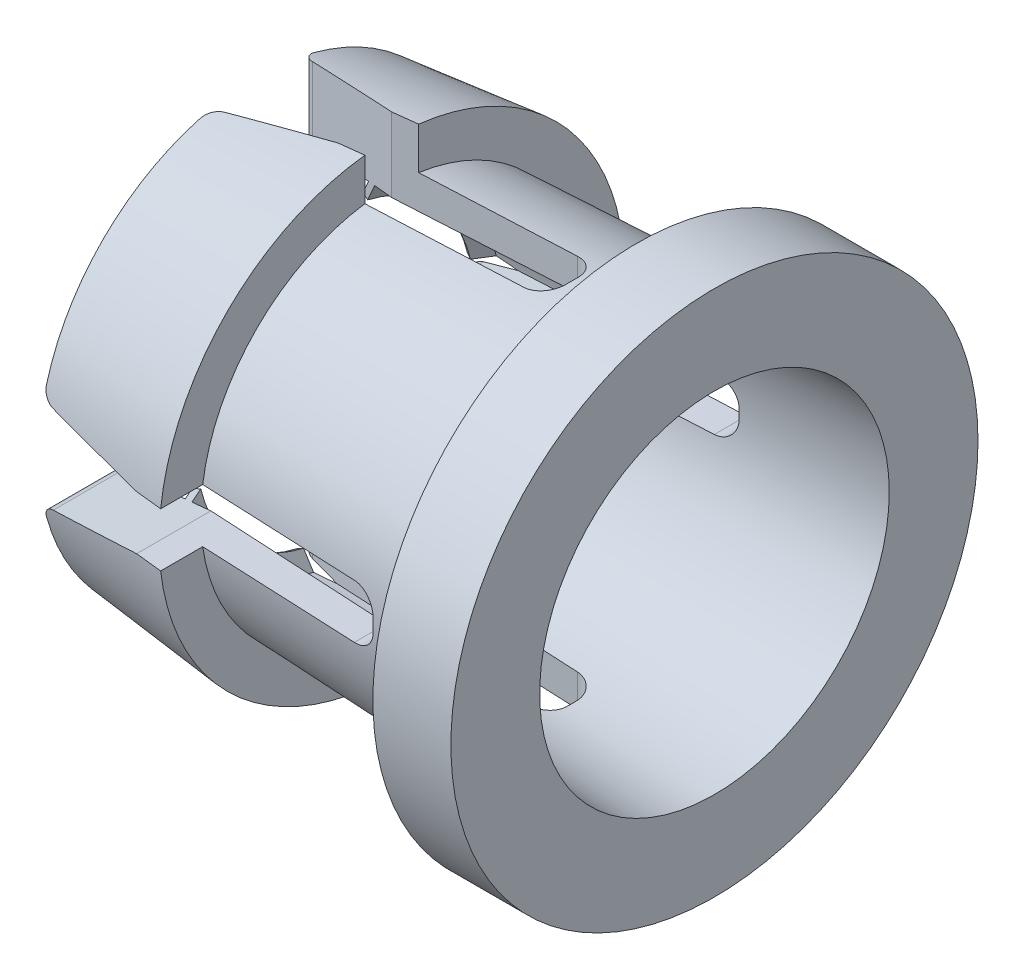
ISO-10303-21;
HEADER;
FILE_DESCRIPTION(('STEP AP214'),'2;1');
FILE_NAME('part.step','',(''),(''),'','','');
FILE_SCHEMA(('AUTOMOTIVE_DESIGN { 1 0 10303 214 1 1 1 1 }'));
ENDSEC;
DATA;
#1=APPLICATION_CONTEXT('core data for automotive mechanical design processes');
#2=APPLICATION_PROTOCOL_DEFINITION('international standard','automotive_design',2000,#1);
#3=PRODUCT_CONTEXT('',#1,'mechanical');
#4=PRODUCT('Part','Part','',(#3));
#5=PRODUCT_RELATED_PRODUCT_CATEGORY('part','',(#4));
#6=PRODUCT_DEFINITION_FORMATION('','',#4);
#7=PRODUCT_DEFINITION_CONTEXT('part definition',#1,'design');
#8=PRODUCT_DEFINITION('design','',#6,#7);
#9=PRODUCT_DEFINITION_SHAPE('','',#8);
#10=(LENGTH_UNIT() NAMED_UNIT(*) SI_UNIT(.MILLI.,.METRE.));
#11=(NAMED_UNIT(*) PLANE_ANGLE_UNIT() SI_UNIT($,.RADIAN.));
#12=(NAMED_UNIT(*) SI_UNIT($,.STERADIAN.) SOLID_ANGLE_UNIT());
#13=UNCERTAINTY_MEASURE_WITH_UNIT(LENGTH_MEASURE(1.E-05),#10,'distance_accuracy_value','');
#14=(GEOMETRIC_REPRESENTATION_CONTEXT(3) GLOBAL_UNCERTAINTY_ASSIGNED_CONTEXT((#13)) GLOBAL_UNIT_ASSIGNED_CONTEXT((#10,
#11,#12)) REPRESENTATION_CONTEXT('',''));
#15=CARTESIAN_POINT('',(0.,0.,0.));
#16=DIRECTION('',(0.,0.,1.));
#17=DIRECTION('',(1.,0.,0.));
#18=AXIS2_PLACEMENT_3D('',#15,#16,#17);
#19=CARTESIAN_POINT('',(-4.,-1.062428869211,5.88));
#20=DIRECTION('',(0.,0.,1.));
#21=DIRECTION('',(1.,0.,0.));
#22=AXIS2_PLACEMENT_3D('',#19,#20,#21);
#23=CYLINDRICAL_SURFACE('',#22,0.25);
#24=CARTESIAN_POINT('',(-4.04341204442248,-0.816226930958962,-3.9994584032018));
#25=CARTESIAN_POINT('',(-4.05744148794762,-0.818688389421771,-3.99743668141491));
#26=CARTESIAN_POINT('',(-4.07121536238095,-0.822364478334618,-3.99519498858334));
#27=CARTESIAN_POINT('',(-4.09786895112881,-0.831950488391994,-3.99032465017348));
#28=CARTESIAN_POINT('',(-4.11074988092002,-0.837857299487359,-3.98769654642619));
#29=CARTESIAN_POINT('',(-4.13527363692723,-0.85171613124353,-3.98210092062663));
#30=CARTESIAN_POINT('',(-4.14691665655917,-0.859667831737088,-3.97913345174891));
#31=CARTESIAN_POINT('',(-4.16865941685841,-0.877360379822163,-3.97290967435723));
#32=CARTESIAN_POINT('',(-4.17875933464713,-0.887101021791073,-3.96965339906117));
#33=CARTESIAN_POINT('',(-4.1973267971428,-0.908273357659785,-3.96284391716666));
#34=CARTESIAN_POINT('',(-4.20576153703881,-0.919732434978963,-3.95928640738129));
#35=CARTESIAN_POINT('',(-4.22055756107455,-0.943874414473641,-3.9519883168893));
#36=CARTESIAN_POINT('',(-4.22691746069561,-0.95655812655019,-3.94824761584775));
#37=CARTESIAN_POINT('',(-4.23803370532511,-0.98438872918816,-3.94019174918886));
#38=CARTESIAN_POINT('',(-4.24250101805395,-0.999647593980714,-3.93586204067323));
#39=CARTESIAN_POINT('',(-4.24849362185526,-1.03074179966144,-3.92717948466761));
#40=CARTESIAN_POINT('',(-4.25001608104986,-1.04657768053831,-3.92282661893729));
#41=CARTESIAN_POINT('',(-4.25,-1.06242886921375,-3.91852585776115));
#42=B_SPLINE_CURVE_WITH_KNOTS('',3,(#24,#25,#26,#27,#28,#29,#30,#31,#32,#33,#34,#35,#36,#37,#38,
#39,#40,#41),.UNSPECIFIED.,.F.,.F.,(4,2,2,2,2,2,2,2,4),(0.,0.0430916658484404,
0.0861234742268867,0.129148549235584,0.172168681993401,0.215966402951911,0.259793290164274,
0.308949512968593,0.358152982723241),.UNSPECIFIED.);
#43=CARTESIAN_POINT('',(-4.04341204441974,-0.816226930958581,-3.99945840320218));
#44=VERTEX_POINT('',#43);
#45=CARTESIAN_POINT('',(-4.25000000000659,-1.06242886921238,-3.91852585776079));
#46=VERTEX_POINT('',#45);
#47=EDGE_CURVE('E430',#44,#46,#42,.T.);
#48=ORIENTED_EDGE('',*,*,#47,.T.);
#49=DIRECTION('',(0.,0.,-1.));
#50=VECTOR('',#49,1.);
#51=CARTESIAN_POINT('',(-4.25,-1.062428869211,0.));
#52=LINE('',#51,#50);
#53=CARTESIAN_POINT('',(-4.25000000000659,-1.06242886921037,-2.59060705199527));
#54=VERTEX_POINT('',#53);
#55=EDGE_CURVE('E428',#46,#54,#52,.F.);
#56=ORIENTED_EDGE('',*,*,#55,.T.);
#57=CARTESIAN_POINT('',(-4.25,-1.06242886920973,-2.5906070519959));
#58=CARTESIAN_POINT('',(-4.25000956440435,-1.04766430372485,-2.59666738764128));
#59=CARTESIAN_POINT('',(-4.2486921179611,-1.03286420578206,-2.60265926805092));
#60=CARTESIAN_POINT('',(-4.24343207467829,-1.00359796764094,-2.61437934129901));
#61=CARTESIAN_POINT('',(-4.23948445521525,-0.989132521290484,-2.62010700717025));
#62=CARTESIAN_POINT('',(-4.22898533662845,-0.96097952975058,-2.63115582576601));
#63=CARTESIAN_POINT('',(-4.22242996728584,-0.94729317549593,-2.63647636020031));
#64=CARTESIAN_POINT('',(-4.2068469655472,-0.921202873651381,-2.64657873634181));
#65=CARTESIAN_POINT('',(-4.19782200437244,-0.908797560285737,-2.6513611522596));
#66=CARTESIAN_POINT('',(-4.17793950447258,-0.886206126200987,-2.66010487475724));
#67=CARTESIAN_POINT('',(-4.16717411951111,-0.875949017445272,-2.66409211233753));
#68=CARTESIAN_POINT('',(-4.14385442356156,-0.857422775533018,-2.67140892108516));
#69=CARTESIAN_POINT('',(-4.13130068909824,-0.849153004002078,-2.67473870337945));
#70=CARTESIAN_POINT('',(-4.10648137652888,-0.835859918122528,-2.68029674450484));
#71=CARTESIAN_POINT('',(-4.09438440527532,-0.830556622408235,-2.68261142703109));
#72=CARTESIAN_POINT('',(-4.06940722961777,-0.821889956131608,-2.68666123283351));
#73=CARTESIAN_POINT('',(-4.05652608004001,-0.818528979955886,-2.6883956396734));
#74=CARTESIAN_POINT('',(-4.04341204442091,-0.816226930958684,-2.689821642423));
#75=B_SPLINE_CURVE_WITH_KNOTS('',3,(#57,#58,#59,#60,#61,#62,#63,#64,#65,#66,#67,#68,#69,#70,#71,
#72,#73,#74),.UNSPECIFIED.,.F.,.F.,(4,2,2,2,2,2,2,2,4),(0.,0.0478366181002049,
0.0957648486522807,0.143764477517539,0.191712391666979,0.237660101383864,0.283593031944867,
0.323649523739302,0.363755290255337),.UNSPECIFIED.);
#76=CARTESIAN_POINT('',(-4.04341204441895,-0.816226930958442,-2.68982164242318));
#77=VERTEX_POINT('',#76);
#78=EDGE_CURVE('E21',#54,#77,#75,.T.);
#79=ORIENTED_EDGE('',*,*,#78,.T.);
#80=DIRECTION('',(0.,0.,1.));
#81=VECTOR('',#80,1.);
#82=CARTESIAN_POINT('',(-4.043412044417,-0.8162269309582,5.88));
#83=LINE('',#82,#81);
#84=EDGE_CURVE('E425',#77,#44,#83,.F.);
#85=ORIENTED_EDGE('',*,*,#84,.T.);
#86=EDGE_LOOP('',(#48,#56,#79,#85));
#87=FACE_BOUND('',#86,.T.);
#88=ADVANCED_FACE('F17',(#87),#23,.T.);
#89=CARTESIAN_POINT('',(-4.,-5.88,-1.062428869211));
#90=DIRECTION('',(0.,-1.,0.));
#91=DIRECTION('',(0.,0.,-1.));
#92=AXIS2_PLACEMENT_3D('',#89,#90,#91);
#93=CYLINDRICAL_SURFACE('',#92,0.25);
#94=CARTESIAN_POINT('',(-4.04341204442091,-2.689821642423,-0.816226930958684));
#95=CARTESIAN_POINT('',(-4.05716538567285,-2.68832675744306,-0.818638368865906));
#96=CARTESIAN_POINT('',(-4.0706635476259,-2.68649159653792,-0.822218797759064));
#97=CARTESIAN_POINT('',(-4.09676519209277,-2.68218648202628,-0.831504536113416));
#98=CARTESIAN_POINT('',(-4.1093707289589,-2.67971805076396,-0.837204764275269));
#99=CARTESIAN_POINT('',(-4.13336729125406,-2.67418565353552,-0.850527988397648));
#100=CARTESIAN_POINT('',(-4.14475875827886,-2.67112190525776,-0.858150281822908));
#101=CARTESIAN_POINT('',(-4.16605497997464,-2.66444649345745,-0.875050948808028));
#102=CARTESIAN_POINT('',(-4.17595942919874,-2.66083471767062,-0.88432966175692));
#103=CARTESIAN_POINT('',(-4.19433234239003,-2.65300396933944,-0.904545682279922));
#104=CARTESIAN_POINT('',(-4.20274875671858,-2.64877002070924,-0.915524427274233));
#105=CARTESIAN_POINT('',(-4.21760465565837,-2.63985083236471,-0.938588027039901));
#106=CARTESIAN_POINT('',(-4.22404277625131,-2.63516528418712,-0.950673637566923));
#107=CARTESIAN_POINT('',(-4.23511824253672,-2.6251697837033,-0.976265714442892));
#108=CARTESIAN_POINT('',(-4.23964170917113,-2.61983988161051,-0.989813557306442));
#109=CARTESIAN_POINT('',(-4.24630833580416,-2.60889195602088,-1.01734730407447));
#110=CARTESIAN_POINT('',(-4.24845521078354,-2.60327439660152,-1.03133248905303));
#111=CARTESIAN_POINT('',(-4.24980616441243,-2.59526565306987,-1.05104352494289));
#112=CARTESIAN_POINT('',(-4.25000082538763,-2.59294057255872,-1.05673974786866));
#113=CARTESIAN_POINT('',(-4.25,-2.5906070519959,-1.06242886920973));
#114=B_SPLINE_CURVE_WITH_KNOTS('',3,(#94,#95,#96,#97,#98,#99,#100,#101,#102,#103,#104,#105,#106,
#107,#108,#109,#110,#111,#112,#113),.UNSPECIFIED.,.F.,.F.,(4,2,2,2,2,2,2,2,2,4),(0.,
0.042057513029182,0.0840148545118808,0.12595688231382,0.167907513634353,0.211117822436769,
0.254357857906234,0.299895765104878,0.345362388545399,0.363815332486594),.UNSPECIFIED.);
#115=CARTESIAN_POINT('',(-4.04341204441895,-2.68982164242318,-0.816226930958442));
#116=VERTEX_POINT('',#115);
#117=CARTESIAN_POINT('',(-4.25000000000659,-2.59060705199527,-1.06242886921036));
#118=VERTEX_POINT('',#117);
#119=EDGE_CURVE('E1672',#116,#118,#114,.T.);
#120=ORIENTED_EDGE('',*,*,#119,.T.);
#121=DIRECTION('',(0.,1.,0.));
#122=VECTOR('',#121,1.);
#123=CARTESIAN_POINT('',(-4.25,0.,-1.062428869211));
#124=LINE('',#123,#122);
#125=CARTESIAN_POINT('',(-4.25000000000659,-3.91852585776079,-1.06242886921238));
#126=VERTEX_POINT('',#125);
#127=EDGE_CURVE('E1163',#118,#126,#124,.F.);
#128=ORIENTED_EDGE('',*,*,#127,.T.);
#129=CARTESIAN_POINT('',(-4.25,-3.91852585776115,-1.06242886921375));
#130=CARTESIAN_POINT('',(-4.25001042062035,-3.922474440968,-1.04787364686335));
#131=CARTESIAN_POINT('',(-4.24872949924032,-3.92646699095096,-1.0333336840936));
#132=CARTESIAN_POINT('',(-4.24367281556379,-3.9344448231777,-1.00469110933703));
#133=CARTESIAN_POINT('',(-4.23989695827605,-3.93843010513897,-0.990588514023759));
#134=CARTESIAN_POINT('',(-4.22993585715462,-3.94629978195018,-0.963222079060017));
#135=CARTESIAN_POINT('',(-4.22374945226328,-3.95018412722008,-0.949958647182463));
#136=CARTESIAN_POINT('',(-4.20913584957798,-3.95776882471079,-0.924678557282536));
#137=CARTESIAN_POINT('',(-4.20070966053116,-3.9614692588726,-0.912661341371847));
#138=CARTESIAN_POINT('',(-4.18191077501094,-3.96859122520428,-0.890324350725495));
#139=CARTESIAN_POINT('',(-4.17155289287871,-3.97201461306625,-0.879992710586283));
#140=CARTESIAN_POINT('',(-4.1491354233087,-3.97855157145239,-0.861251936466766));
#141=CARTESIAN_POINT('',(-4.13707575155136,-3.98166512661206,-0.852842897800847));
#142=CARTESIAN_POINT('',(-4.11189925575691,-3.98745590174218,-0.838411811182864));
#143=CARTESIAN_POINT('',(-4.09881382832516,-3.99014163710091,-0.832338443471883));
#144=CARTESIAN_POINT('',(-4.0717124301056,-3.99511403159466,-0.822497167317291));
#145=CARTESIAN_POINT('',(-4.05769520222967,-3.99740013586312,-0.818732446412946));
#146=CARTESIAN_POINT('',(-4.04341204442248,-3.9994584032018,-0.816226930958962));
#147=B_SPLINE_CURVE_WITH_KNOTS('',3,(#129,#130,#131,#132,#133,#134,#135,#136,#137,#138,#139,
#140,#141,#142,#143,#144,#145,#146),.UNSPECIFIED.,.F.,.F.,(4,2,2,2,2,2,2,2,4),(0.,
0.0451854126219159,0.090372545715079,0.135581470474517,0.180770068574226,0.225625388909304,
0.270482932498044,0.314289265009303,0.358155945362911),.UNSPECIFIED.);
#148=CARTESIAN_POINT('',(-4.04341204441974,-3.99945840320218,-0.816226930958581));
#149=VERTEX_POINT('',#148);
#150=EDGE_CURVE('E1677',#126,#149,#147,.T.);
#151=ORIENTED_EDGE('',*,*,#150,.T.);
#152=DIRECTION('',(0.,1.,0.));
#153=VECTOR('',#152,1.);
#154=CARTESIAN_POINT('',(-4.043412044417,-5.88,-0.8162269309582));
#155=LINE('',#154,#153);
#156=EDGE_CURVE('E679',#149,#116,#155,.T.);
#157=ORIENTED_EDGE('',*,*,#156,.T.);
#158=EDGE_LOOP('',(#120,#128,#151,#157));
#159=FACE_BOUND('',#158,.T.);
#160=ADVANCED_FACE('F1656',(#159),#93,.T.);
#161=CARTESIAN_POINT('',(-4.,-5.88,-1.062428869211));
#162=DIRECTION('',(0.,-1.,0.));
#163=DIRECTION('',(0.,0.,-1.));
#164=AXIS2_PLACEMENT_3D('',#161,#162,#163);
#165=CYLINDRICAL_SURFACE('',#164,0.25);
#166=CARTESIAN_POINT('',(-4.04341204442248,3.9994584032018,-0.816226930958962));
#167=CARTESIAN_POINT('',(-4.05744148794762,3.99743668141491,-0.818688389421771));
#168=CARTESIAN_POINT('',(-4.07121536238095,3.99519498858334,-0.822364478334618));
#169=CARTESIAN_POINT('',(-4.09786895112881,3.99032465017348,-0.831950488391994));
#170=CARTESIAN_POINT('',(-4.11074988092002,3.98769654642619,-0.837857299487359));
#171=CARTESIAN_POINT('',(-4.13527363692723,3.98210092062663,-0.85171613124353));
#172=CARTESIAN_POINT('',(-4.14691665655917,3.97913345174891,-0.859667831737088));
#173=CARTESIAN_POINT('',(-4.16865941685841,3.97290967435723,-0.877360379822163));
#174=CARTESIAN_POINT('',(-4.17875933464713,3.96965339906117,-0.887101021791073));
#175=CARTESIAN_POINT('',(-4.1973267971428,3.96284391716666,-0.908273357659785));
#176=CARTESIAN_POINT('',(-4.20576153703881,3.95928640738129,-0.919732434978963));
#177=CARTESIAN_POINT('',(-4.22055756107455,3.9519883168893,-0.943874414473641));
#178=CARTESIAN_POINT('',(-4.22691746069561,3.94824761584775,-0.95655812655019));
#179=CARTESIAN_POINT('',(-4.23803370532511,3.94019174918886,-0.98438872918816));
#180=CARTESIAN_POINT('',(-4.24250101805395,3.93586204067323,-0.999647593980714));
#181=CARTESIAN_POINT('',(-4.24849362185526,3.92717948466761,-1.03074179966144));
#182=CARTESIAN_POINT('',(-4.25001608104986,3.92282661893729,-1.04657768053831));
#183=CARTESIAN_POINT('',(-4.25,3.91852585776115,-1.06242886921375));
#184=B_SPLINE_CURVE_WITH_KNOTS('',3,(#166,#167,#168,#169,#170,#171,#172,#173,#174,#175,#176,
#177,#178,#179,#180,#181,#182,#183),.UNSPECIFIED.,.F.,.F.,(4,2,2,2,2,2,2,2,4),(0.,
0.0430916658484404,0.0861234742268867,0.129148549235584,0.172168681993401,0.215966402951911,
0.259793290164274,0.308949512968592,0.35815298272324),.UNSPECIFIED.);
#185=CARTESIAN_POINT('',(-4.04341204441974,3.99945840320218,-0.816226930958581));
#186=VERTEX_POINT('',#185);
#187=CARTESIAN_POINT('',(-4.25000000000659,3.91852585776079,-1.06242886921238));
#188=VERTEX_POINT('',#187);
#189=EDGE_CURVE('E944',#186,#188,#184,.T.);
#190=ORIENTED_EDGE('',*,*,#189,.T.);
#191=DIRECTION('',(0.,1.,0.));
#192=VECTOR('',#191,1.);
#193=CARTESIAN_POINT('',(-4.25,0.,-1.062428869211));
#194=LINE('',#193,#192);
#195=CARTESIAN_POINT('',(-4.25000000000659,2.59060705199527,-1.06242886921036));
#196=VERTEX_POINT('',#195);
#197=EDGE_CURVE('E613',#188,#196,#194,.F.);
#198=ORIENTED_EDGE('',*,*,#197,.T.);
#199=CARTESIAN_POINT('',(-4.25,2.5906070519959,-1.06242886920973));
#200=CARTESIAN_POINT('',(-4.25000956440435,2.59666738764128,-1.04766430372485));
#201=CARTESIAN_POINT('',(-4.2486921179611,2.60265926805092,-1.03286420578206));
#202=CARTESIAN_POINT('',(-4.24343207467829,2.61437934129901,-1.00359796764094));
#203=CARTESIAN_POINT('',(-4.23948445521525,2.62010700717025,-0.989132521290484));
#204=CARTESIAN_POINT('',(-4.22898533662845,2.63115582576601,-0.96097952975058));
#205=CARTESIAN_POINT('',(-4.22242996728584,2.63647636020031,-0.94729317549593));
#206=CARTESIAN_POINT('',(-4.2068469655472,2.64657873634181,-0.921202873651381));
#207=CARTESIAN_POINT('',(-4.19782200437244,2.6513611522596,-0.908797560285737));
#208=CARTESIAN_POINT('',(-4.17793950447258,2.66010487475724,-0.886206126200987));
#209=CARTESIAN_POINT('',(-4.16717411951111,2.66409211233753,-0.875949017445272));
#210=CARTESIAN_POINT('',(-4.14385442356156,2.67140892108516,-0.857422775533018));
#211=CARTESIAN_POINT('',(-4.13130068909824,2.67473870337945,-0.849153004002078));
#212=CARTESIAN_POINT('',(-4.10648137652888,2.68029674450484,-0.835859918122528));
#213=CARTESIAN_POINT('',(-4.09438440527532,2.68261142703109,-0.830556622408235));
#214=CARTESIAN_POINT('',(-4.06940722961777,2.68666123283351,-0.821889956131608));
#215=CARTESIAN_POINT('',(-4.05652608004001,2.6883956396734,-0.818528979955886));
#216=CARTESIAN_POINT('',(-4.04341204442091,2.689821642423,-0.816226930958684));
#217=B_SPLINE_CURVE_WITH_KNOTS('',3,(#199,#200,#201,#202,#203,#204,#205,#206,#207,#208,#209,
#210,#211,#212,#213,#214,#215,#216),.UNSPECIFIED.,.F.,.F.,(4,2,2,2,2,2,2,2,4),(0.,
0.0478366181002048,0.0957648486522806,0.143764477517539,0.191712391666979,0.237660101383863,
0.283593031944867,0.323649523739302,0.363755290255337),.UNSPECIFIED.);
#218=CARTESIAN_POINT('',(-4.04341204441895,2.68982164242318,-0.816226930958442));
#219=VERTEX_POINT('',#218);
#220=EDGE_CURVE('E1884',#196,#219,#217,.T.);
#221=ORIENTED_EDGE('',*,*,#220,.T.);
#222=DIRECTION('',(0.,1.,0.));
#223=VECTOR('',#222,1.);
#224=CARTESIAN_POINT('',(-4.043412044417,-5.88,-0.8162269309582));
#225=LINE('',#224,#223);
#226=EDGE_CURVE('E1150',#219,#186,#225,.T.);
#227=ORIENTED_EDGE('',*,*,#226,.T.);
#228=EDGE_LOOP('',(#190,#198,#221,#227));
#229=FACE_BOUND('',#228,.T.);
#230=ADVANCED_FACE('F928',(#229),#165,.T.);
#231=CARTESIAN_POINT('',(-4.,1.062428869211,5.88));
#232=DIRECTION('',(0.,0.,1.));
#233=DIRECTION('',(1.,0.,0.));
#234=AXIS2_PLACEMENT_3D('',#231,#232,#233);
#235=CYLINDRICAL_SURFACE('',#234,0.25);
#236=CARTESIAN_POINT('',(-4.04341204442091,0.816226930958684,-2.689821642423));
#237=CARTESIAN_POINT('',(-4.05716538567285,0.818638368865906,-2.68832675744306));
#238=CARTESIAN_POINT('',(-4.0706635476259,0.822218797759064,-2.68649159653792));
#239=CARTESIAN_POINT('',(-4.09676519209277,0.831504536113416,-2.68218648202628));
#240=CARTESIAN_POINT('',(-4.1093707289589,0.837204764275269,-2.67971805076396));
#241=CARTESIAN_POINT('',(-4.13336729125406,0.850527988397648,-2.67418565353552));
#242=CARTESIAN_POINT('',(-4.14475875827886,0.858150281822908,-2.67112190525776));
#243=CARTESIAN_POINT('',(-4.16605497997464,0.875050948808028,-2.66444649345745));
#244=CARTESIAN_POINT('',(-4.17595942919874,0.88432966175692,-2.66083471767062));
#245=CARTESIAN_POINT('',(-4.19433234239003,0.904545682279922,-2.65300396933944));
#246=CARTESIAN_POINT('',(-4.20274875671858,0.915524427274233,-2.64877002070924));
#247=CARTESIAN_POINT('',(-4.21760465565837,0.938588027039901,-2.63985083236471));
#248=CARTESIAN_POINT('',(-4.22404277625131,0.950673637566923,-2.63516528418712));
#249=CARTESIAN_POINT('',(-4.23511824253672,0.976265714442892,-2.6251697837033));
#250=CARTESIAN_POINT('',(-4.23964170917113,0.989813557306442,-2.61983988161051));
#251=CARTESIAN_POINT('',(-4.24630833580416,1.01734730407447,-2.60889195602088));
#252=CARTESIAN_POINT('',(-4.24845521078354,1.03133248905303,-2.60327439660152));
#253=CARTESIAN_POINT('',(-4.24980616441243,1.05104352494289,-2.59526565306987));
#254=CARTESIAN_POINT('',(-4.25000082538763,1.05673974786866,-2.59294057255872));
#255=CARTESIAN_POINT('',(-4.25,1.06242886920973,-2.5906070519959));
#256=B_SPLINE_CURVE_WITH_KNOTS('',3,(#236,#237,#238,#239,#240,#241,#242,#243,#244,#245,#246,
#247,#248,#249,#250,#251,#252,#253,#254,#255),.UNSPECIFIED.,.F.,.F.,(4,2,2,2,2,2,2,2,2,4),(0.,
0.0420575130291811,0.0840148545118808,0.12595688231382,0.167907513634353,0.211117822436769,
0.254357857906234,0.299895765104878,0.345362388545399,0.363815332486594),.UNSPECIFIED.);
#257=CARTESIAN_POINT('',(-4.04341204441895,0.816226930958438,-2.68982164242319));
#258=VERTEX_POINT('',#257);
#259=CARTESIAN_POINT('',(-4.25000000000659,1.06242886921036,-2.59060705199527));
#260=VERTEX_POINT('',#259);
#261=EDGE_CURVE('E932',#258,#260,#256,.T.);
#262=ORIENTED_EDGE('',*,*,#261,.T.);
#263=DIRECTION('',(0.,0.,-1.));
#264=VECTOR('',#263,1.);
#265=CARTESIAN_POINT('',(-4.25,1.062428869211,0.));
#266=LINE('',#265,#264);
#267=CARTESIAN_POINT('',(-4.25000000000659,1.06242886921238,-3.91852585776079));
#268=VERTEX_POINT('',#267);
#269=EDGE_CURVE('E1131',#260,#268,#266,.T.);
#270=ORIENTED_EDGE('',*,*,#269,.T.);
#271=CARTESIAN_POINT('',(-4.25,1.06242886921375,-3.91852585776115));
#272=CARTESIAN_POINT('',(-4.25001042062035,1.04787364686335,-3.922474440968));
#273=CARTESIAN_POINT('',(-4.24872949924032,1.0333336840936,-3.92646699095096));
#274=CARTESIAN_POINT('',(-4.24367281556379,1.00469110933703,-3.9344448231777));
#275=CARTESIAN_POINT('',(-4.23989695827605,0.990588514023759,-3.93843010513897));
#276=CARTESIAN_POINT('',(-4.22993585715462,0.963222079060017,-3.94629978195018));
#277=CARTESIAN_POINT('',(-4.22374945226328,0.949958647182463,-3.95018412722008));
#278=CARTESIAN_POINT('',(-4.20913584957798,0.924678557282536,-3.95776882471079));
#279=CARTESIAN_POINT('',(-4.20070966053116,0.912661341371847,-3.9614692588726));
#280=CARTESIAN_POINT('',(-4.18191077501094,0.890324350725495,-3.96859122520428));
#281=CARTESIAN_POINT('',(-4.17155289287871,0.879992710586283,-3.97201461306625));
#282=CARTESIAN_POINT('',(-4.1491354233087,0.861251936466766,-3.97855157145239));
#283=CARTESIAN_POINT('',(-4.13707575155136,0.852842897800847,-3.98166512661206));
#284=CARTESIAN_POINT('',(-4.11189925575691,0.838411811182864,-3.98745590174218));
#285=CARTESIAN_POINT('',(-4.09881382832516,0.832338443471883,-3.99014163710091));
#286=CARTESIAN_POINT('',(-4.0717124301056,0.822497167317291,-3.99511403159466));
#287=CARTESIAN_POINT('',(-4.05769520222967,0.818732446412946,-3.99740013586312));
#288=CARTESIAN_POINT('',(-4.04341204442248,0.816226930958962,-3.9994584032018));
#289=B_SPLINE_CURVE_WITH_KNOTS('',3,(#271,#272,#273,#274,#275,#276,#277,#278,#279,#280,#281,
#282,#283,#284,#285,#286,#287,#288),.UNSPECIFIED.,.F.,.F.,(4,2,2,2,2,2,2,2,4),(0.,
0.045185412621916,0.0903725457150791,0.135581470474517,0.180770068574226,0.225625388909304,
0.270482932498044,0.314289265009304,0.358155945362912),.UNSPECIFIED.);
#290=CARTESIAN_POINT('',(-4.04341204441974,0.816226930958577,-3.99945840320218));
#291=VERTEX_POINT('',#290);
#292=EDGE_CURVE('E938',#268,#291,#289,.T.);
#293=ORIENTED_EDGE('',*,*,#292,.T.);
#294=DIRECTION('',(0.,0.,1.));
#295=VECTOR('',#294,1.);
#296=CARTESIAN_POINT('',(-4.043412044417,0.816226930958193,5.88));
#297=LINE('',#296,#295);
#298=EDGE_CURVE('E1141',#291,#258,#297,.T.);
#299=ORIENTED_EDGE('',*,*,#298,.T.);
#300=EDGE_LOOP('',(#262,#270,#293,#299));
#301=FACE_BOUND('',#300,.T.);
#302=ADVANCED_FACE('F920',(#301),#235,.T.);
#303=CARTESIAN_POINT('',(-4.,1.062428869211,5.88));
#304=DIRECTION('',(0.,0.,1.));
#305=DIRECTION('',(1.,0.,0.));
#306=AXIS2_PLACEMENT_3D('',#303,#304,#305);
#307=CYLINDRICAL_SURFACE('',#306,0.25);
#308=CARTESIAN_POINT('',(-4.04341204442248,0.816226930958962,3.9994584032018));
#309=CARTESIAN_POINT('',(-4.05744148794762,0.81868838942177,3.99743668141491));
#310=CARTESIAN_POINT('',(-4.07121536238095,0.822364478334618,3.99519498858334));
#311=CARTESIAN_POINT('',(-4.09786895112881,0.831950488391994,3.99032465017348));
#312=CARTESIAN_POINT('',(-4.11074988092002,0.837857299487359,3.9876965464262));
#313=CARTESIAN_POINT('',(-4.13527363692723,0.851716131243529,3.98210092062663));
#314=CARTESIAN_POINT('',(-4.14691665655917,0.859667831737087,3.97913345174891));
#315=CARTESIAN_POINT('',(-4.16865941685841,0.877360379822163,3.97290967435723));
#316=CARTESIAN_POINT('',(-4.17875933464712,0.887101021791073,3.96965339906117));
#317=CARTESIAN_POINT('',(-4.1973267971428,0.908273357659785,3.96284391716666));
#318=CARTESIAN_POINT('',(-4.20576153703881,0.919732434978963,3.95928640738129));
#319=CARTESIAN_POINT('',(-4.22055756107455,0.943874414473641,3.9519883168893));
#320=CARTESIAN_POINT('',(-4.22691746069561,0.956558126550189,3.94824761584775));
#321=CARTESIAN_POINT('',(-4.23803370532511,0.984388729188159,3.94019174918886));
#322=CARTESIAN_POINT('',(-4.24250101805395,0.999647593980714,3.93586204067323));
#323=CARTESIAN_POINT('',(-4.24849362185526,1.03074179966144,3.92717948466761));
#324=CARTESIAN_POINT('',(-4.25001608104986,1.04657768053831,3.92282661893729));
#325=CARTESIAN_POINT('',(-4.25,1.06242886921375,3.91852585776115));
#326=B_SPLINE_CURVE_WITH_KNOTS('',3,(#308,#309,#310,#311,#312,#313,#314,#315,#316,#317,#318,
#319,#320,#321,#322,#323,#324,#325),.UNSPECIFIED.,.F.,.F.,(4,2,2,2,2,2,2,2,4),(0.,
0.0430916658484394,0.0861234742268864,0.129148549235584,0.172168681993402,0.215966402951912,
0.259793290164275,0.308949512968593,0.358152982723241),.UNSPECIFIED.);
#327=CARTESIAN_POINT('',(-4.04341204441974,0.816226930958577,3.99945840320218));
#328=VERTEX_POINT('',#327);
#329=CARTESIAN_POINT('',(-4.25000000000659,1.06242886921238,3.91852585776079));
#330=VERTEX_POINT('',#329);
#331=EDGE_CURVE('E904',#328,#330,#326,.T.);
#332=ORIENTED_EDGE('',*,*,#331,.T.);
#333=DIRECTION('',(0.,0.,-1.));
#334=VECTOR('',#333,1.);
#335=CARTESIAN_POINT('',(-4.25,1.062428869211,0.));
#336=LINE('',#335,#334);
#337=CARTESIAN_POINT('',(-4.25000000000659,1.06242886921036,2.59060705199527));
#338=VERTEX_POINT('',#337);
#339=EDGE_CURVE('E1125',#330,#338,#336,.T.);
#340=ORIENTED_EDGE('',*,*,#339,.T.);
#341=CARTESIAN_POINT('',(-4.25,1.06242886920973,2.5906070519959));
#342=CARTESIAN_POINT('',(-4.25000956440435,1.04766430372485,2.59666738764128));
#343=CARTESIAN_POINT('',(-4.2486921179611,1.03286420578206,2.60265926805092));
#344=CARTESIAN_POINT('',(-4.24343207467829,1.00359796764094,2.61437934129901));
#345=CARTESIAN_POINT('',(-4.23948445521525,0.989132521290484,2.62010700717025));
#346=CARTESIAN_POINT('',(-4.22898533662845,0.96097952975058,2.63115582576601));
#347=CARTESIAN_POINT('',(-4.22242996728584,0.94729317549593,2.63647636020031));
#348=CARTESIAN_POINT('',(-4.2068469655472,0.921202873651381,2.64657873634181));
#349=CARTESIAN_POINT('',(-4.19782200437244,0.908797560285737,2.6513611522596));
#350=CARTESIAN_POINT('',(-4.17793950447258,0.886206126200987,2.66010487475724));
#351=CARTESIAN_POINT('',(-4.16717411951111,0.875949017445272,2.66409211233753));
#352=CARTESIAN_POINT('',(-4.14385442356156,0.857422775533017,2.67140892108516));
#353=CARTESIAN_POINT('',(-4.13130068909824,0.849153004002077,2.67473870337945));
#354=CARTESIAN_POINT('',(-4.10648137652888,0.835859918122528,2.68029674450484));
#355=CARTESIAN_POINT('',(-4.09438440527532,0.830556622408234,2.68261142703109));
#356=CARTESIAN_POINT('',(-4.06940722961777,0.821889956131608,2.68666123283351));
#357=CARTESIAN_POINT('',(-4.05652608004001,0.818528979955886,2.6883956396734));
#358=CARTESIAN_POINT('',(-4.04341204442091,0.816226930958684,2.689821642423));
#359=B_SPLINE_CURVE_WITH_KNOTS('',3,(#341,#342,#343,#344,#345,#346,#347,#348,#349,#350,#351,
#352,#353,#354,#355,#356,#357,#358),.UNSPECIFIED.,.F.,.F.,(4,2,2,2,2,2,2,2,4),(0.,
0.0478366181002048,0.0957648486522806,0.143764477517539,0.191712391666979,0.237660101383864,
0.283593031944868,0.323649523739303,0.363755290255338),.UNSPECIFIED.);
#360=CARTESIAN_POINT('',(-4.04341204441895,0.816226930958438,2.68982164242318));
#361=VERTEX_POINT('',#360);
#362=EDGE_CURVE('E910',#338,#361,#359,.T.);
#363=ORIENTED_EDGE('',*,*,#362,.T.);
#364=DIRECTION('',(0.,0.,1.));
#365=VECTOR('',#364,1.);
#366=CARTESIAN_POINT('',(-4.043412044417,0.816226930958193,5.88));
#367=LINE('',#366,#365);
#368=EDGE_CURVE('E1122',#361,#328,#367,.T.);
#369=ORIENTED_EDGE('',*,*,#368,.T.);
#370=EDGE_LOOP('',(#332,#340,#363,#369));
#371=FACE_BOUND('',#370,.T.);
#372=ADVANCED_FACE('F915',(#371),#307,.T.);
#373=CARTESIAN_POINT('',(-4.,-5.88,1.062428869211));
#374=DIRECTION('',(0.,-1.,0.));
#375=DIRECTION('',(0.,0.,-1.));
#376=AXIS2_PLACEMENT_3D('',#373,#374,#375);
#377=CYLINDRICAL_SURFACE('',#376,0.25);
#378=CARTESIAN_POINT('',(-4.04341204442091,2.689821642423,0.816226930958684));
#379=CARTESIAN_POINT('',(-4.05716538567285,2.68832675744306,0.818638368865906));
#380=CARTESIAN_POINT('',(-4.0706635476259,2.68649159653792,0.822218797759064));
#381=CARTESIAN_POINT('',(-4.09676519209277,2.68218648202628,0.831504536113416));
#382=CARTESIAN_POINT('',(-4.1093707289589,2.67971805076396,0.837204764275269));
#383=CARTESIAN_POINT('',(-4.13336729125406,2.67418565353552,0.850527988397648));
#384=CARTESIAN_POINT('',(-4.14475875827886,2.67112190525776,0.858150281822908));
#385=CARTESIAN_POINT('',(-4.16605497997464,2.66444649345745,0.875050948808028));
#386=CARTESIAN_POINT('',(-4.17595942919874,2.66083471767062,0.88432966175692));
#387=CARTESIAN_POINT('',(-4.19433234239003,2.65300396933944,0.904545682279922));
#388=CARTESIAN_POINT('',(-4.20274875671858,2.64877002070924,0.915524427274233));
#389=CARTESIAN_POINT('',(-4.21760465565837,2.63985083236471,0.938588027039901));
#390=CARTESIAN_POINT('',(-4.22404277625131,2.63516528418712,0.950673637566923));
#391=CARTESIAN_POINT('',(-4.23511824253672,2.6251697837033,0.976265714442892));
#392=CARTESIAN_POINT('',(-4.23964170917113,2.61983988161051,0.989813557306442));
#393=CARTESIAN_POINT('',(-4.24630833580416,2.60889195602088,1.01734730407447));
#394=CARTESIAN_POINT('',(-4.24845521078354,2.60327439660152,1.03133248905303));
#395=CARTESIAN_POINT('',(-4.24980616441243,2.59526565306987,1.05104352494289));
#396=CARTESIAN_POINT('',(-4.25000082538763,2.59294057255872,1.05673974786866));
#397=CARTESIAN_POINT('',(-4.25,2.5906070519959,1.06242886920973));
#398=B_SPLINE_CURVE_WITH_KNOTS('',3,(#378,#379,#380,#381,#382,#383,#384,#385,#386,#387,#388,
#389,#390,#391,#392,#393,#394,#395,#396,#397),.UNSPECIFIED.,.F.,.F.,(4,2,2,2,2,2,2,2,2,4),(0.,
0.0420575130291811,0.0840148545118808,0.12595688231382,0.167907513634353,0.211117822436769,
0.254357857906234,0.299895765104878,0.345362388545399,0.363815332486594),.UNSPECIFIED.);
#399=CARTESIAN_POINT('',(-4.04341204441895,2.68982164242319,0.816226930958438));
#400=VERTEX_POINT('',#399);
#401=CARTESIAN_POINT('',(-4.25000000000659,2.59060705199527,1.06242886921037));
#402=VERTEX_POINT('',#401);
#403=EDGE_CURVE('E1755',#400,#402,#398,.T.);
#404=ORIENTED_EDGE('',*,*,#403,.T.);
#405=DIRECTION('',(0.,1.,0.));
#406=VECTOR('',#405,1.);
#407=CARTESIAN_POINT('',(-4.25,0.,1.062428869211));
#408=LINE('',#407,#406);
#409=CARTESIAN_POINT('',(-4.25000000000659,3.91852585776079,1.06242886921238));
#410=VERTEX_POINT('',#409);
#411=EDGE_CURVE('E1128',#402,#410,#408,.T.);
#412=ORIENTED_EDGE('',*,*,#411,.T.);
#413=CARTESIAN_POINT('',(-4.25,3.91852585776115,1.06242886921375));
#414=CARTESIAN_POINT('',(-4.25001042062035,3.922474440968,1.04787364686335));
#415=CARTESIAN_POINT('',(-4.24872949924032,3.92646699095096,1.0333336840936));
#416=CARTESIAN_POINT('',(-4.24367281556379,3.9344448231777,1.00469110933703));
#417=CARTESIAN_POINT('',(-4.23989695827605,3.93843010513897,0.990588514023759));
#418=CARTESIAN_POINT('',(-4.22993585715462,3.94629978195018,0.963222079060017));
#419=CARTESIAN_POINT('',(-4.22374945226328,3.95018412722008,0.949958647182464));
#420=CARTESIAN_POINT('',(-4.20913584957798,3.95776882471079,0.924678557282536));
#421=CARTESIAN_POINT('',(-4.20070966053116,3.9614692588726,0.912661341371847));
#422=CARTESIAN_POINT('',(-4.18191077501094,3.96859122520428,0.890324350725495));
#423=CARTESIAN_POINT('',(-4.17155289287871,3.97201461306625,0.879992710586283));
#424=CARTESIAN_POINT('',(-4.1491354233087,3.97855157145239,0.861251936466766));
#425=CARTESIAN_POINT('',(-4.13707575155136,3.98166512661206,0.852842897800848));
#426=CARTESIAN_POINT('',(-4.11189925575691,3.98745590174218,0.838411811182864));
#427=CARTESIAN_POINT('',(-4.09881382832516,3.99014163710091,0.832338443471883));
#428=CARTESIAN_POINT('',(-4.0717124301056,3.99511403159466,0.822497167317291));
#429=CARTESIAN_POINT('',(-4.05769520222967,3.99740013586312,0.818732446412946));
#430=CARTESIAN_POINT('',(-4.04341204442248,3.9994584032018,0.816226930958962));
#431=B_SPLINE_CURVE_WITH_KNOTS('',3,(#413,#414,#415,#416,#417,#418,#419,#420,#421,#422,#423,
#424,#425,#426,#427,#428,#429,#430),.UNSPECIFIED.,.F.,.F.,(4,2,2,2,2,2,2,2,4),(0.,
0.0451854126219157,0.090372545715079,0.135581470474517,0.180770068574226,0.225625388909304,
0.270482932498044,0.314289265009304,0.358155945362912),.UNSPECIFIED.);
#432=CARTESIAN_POINT('',(-4.04341204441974,3.99945840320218,0.816226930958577));
#433=VERTEX_POINT('',#432);
#434=EDGE_CURVE('E896',#410,#433,#431,.T.);
#435=ORIENTED_EDGE('',*,*,#434,.T.);
#436=DIRECTION('',(0.,1.,0.));
#437=VECTOR('',#436,1.);
#438=CARTESIAN_POINT('',(-4.043412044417,-5.88,0.816226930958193));
#439=LINE('',#438,#437);
#440=EDGE_CURVE('E1111',#433,#400,#439,.F.);
#441=ORIENTED_EDGE('',*,*,#440,.T.);
#442=EDGE_LOOP('',(#404,#412,#435,#441));
#443=FACE_BOUND('',#442,.T.);
#444=ADVANCED_FACE('F919',(#443),#377,.T.);
#445=CARTESIAN_POINT('',(-4.,-5.88,1.062428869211));
#446=DIRECTION('',(0.,-1.,0.));
#447=DIRECTION('',(0.,0.,-1.));
#448=AXIS2_PLACEMENT_3D('',#445,#446,#447);
#449=CYLINDRICAL_SURFACE('',#448,0.25);
#450=CARTESIAN_POINT('',(-4.04341204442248,-3.9994584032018,0.816226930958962));
#451=CARTESIAN_POINT('',(-4.05744148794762,-3.99743668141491,0.81868838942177));
#452=CARTESIAN_POINT('',(-4.07121536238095,-3.99519498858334,0.822364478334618));
#453=CARTESIAN_POINT('',(-4.09786895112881,-3.99032465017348,0.831950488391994));
#454=CARTESIAN_POINT('',(-4.11074988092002,-3.9876965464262,0.837857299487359));
#455=CARTESIAN_POINT('',(-4.13527363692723,-3.98210092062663,0.851716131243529));
#456=CARTESIAN_POINT('',(-4.14691665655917,-3.97913345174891,0.859667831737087));
#457=CARTESIAN_POINT('',(-4.16865941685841,-3.97290967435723,0.877360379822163));
#458=CARTESIAN_POINT('',(-4.17875933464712,-3.96965339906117,0.887101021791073));
#459=CARTESIAN_POINT('',(-4.1973267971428,-3.96284391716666,0.908273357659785));
#460=CARTESIAN_POINT('',(-4.20576153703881,-3.95928640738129,0.919732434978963));
#461=CARTESIAN_POINT('',(-4.22055756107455,-3.9519883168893,0.943874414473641));
#462=CARTESIAN_POINT('',(-4.22691746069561,-3.94824761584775,0.956558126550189));
#463=CARTESIAN_POINT('',(-4.23803370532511,-3.94019174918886,0.984388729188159));
#464=CARTESIAN_POINT('',(-4.24250101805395,-3.93586204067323,0.999647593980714));
#465=CARTESIAN_POINT('',(-4.24849362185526,-3.92717948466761,1.03074179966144));
#466=CARTESIAN_POINT('',(-4.25001608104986,-3.92282661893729,1.04657768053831));
#467=CARTESIAN_POINT('',(-4.25,-3.91852585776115,1.06242886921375));
#468=B_SPLINE_CURVE_WITH_KNOTS('',3,(#450,#451,#452,#453,#454,#455,#456,#457,#458,#459,#460,
#461,#462,#463,#464,#465,#466,#467),.UNSPECIFIED.,.F.,.F.,(4,2,2,2,2,2,2,2,4),(0.,
0.0430916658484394,0.0861234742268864,0.129148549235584,0.172168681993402,0.215966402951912,
0.259793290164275,0.308949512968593,0.358152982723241),.UNSPECIFIED.);
#469=CARTESIAN_POINT('',(-4.04341204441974,-3.99945840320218,0.816226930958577));
#470=VERTEX_POINT('',#469);
#471=CARTESIAN_POINT('',(-4.25000000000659,-3.91852585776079,1.06242886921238));
#472=VERTEX_POINT('',#471);
#473=EDGE_CURVE('E1746',#470,#472,#468,.T.);
#474=ORIENTED_EDGE('',*,*,#473,.T.);
#475=DIRECTION('',(0.,1.,0.));
#476=VECTOR('',#475,1.);
#477=CARTESIAN_POINT('',(-4.25,0.,1.062428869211));
#478=LINE('',#477,#476);
#479=CARTESIAN_POINT('',(-4.25000000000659,-2.59060705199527,1.06242886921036));
#480=VERTEX_POINT('',#479);
#481=EDGE_CURVE('E463',#472,#480,#478,.T.);
#482=ORIENTED_EDGE('',*,*,#481,.T.);
#483=CARTESIAN_POINT('',(-4.25,-2.5906070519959,1.06242886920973));
#484=CARTESIAN_POINT('',(-4.25000956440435,-2.59666738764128,1.04766430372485));
#485=CARTESIAN_POINT('',(-4.2486921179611,-2.60265926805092,1.03286420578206));
#486=CARTESIAN_POINT('',(-4.24343207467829,-2.61437934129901,1.00359796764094));
#487=CARTESIAN_POINT('',(-4.23948445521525,-2.62010700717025,0.989132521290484));
#488=CARTESIAN_POINT('',(-4.22898533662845,-2.63115582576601,0.96097952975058));
#489=CARTESIAN_POINT('',(-4.22242996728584,-2.63647636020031,0.947293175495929));
#490=CARTESIAN_POINT('',(-4.2068469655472,-2.64657873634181,0.921202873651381));
#491=CARTESIAN_POINT('',(-4.19782200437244,-2.6513611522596,0.908797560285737));
#492=CARTESIAN_POINT('',(-4.17793950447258,-2.66010487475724,0.886206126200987));
#493=CARTESIAN_POINT('',(-4.16717411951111,-2.66409211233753,0.875949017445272));
#494=CARTESIAN_POINT('',(-4.14385442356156,-2.67140892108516,0.857422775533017));
#495=CARTESIAN_POINT('',(-4.13130068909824,-2.67473870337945,0.849153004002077));
#496=CARTESIAN_POINT('',(-4.10648137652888,-2.68029674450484,0.835859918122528));
#497=CARTESIAN_POINT('',(-4.09438440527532,-2.68261142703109,0.830556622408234));
#498=CARTESIAN_POINT('',(-4.06940722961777,-2.68666123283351,0.821889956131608));
#499=CARTESIAN_POINT('',(-4.05652608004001,-2.6883956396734,0.818528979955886));
#500=CARTESIAN_POINT('',(-4.04341204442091,-2.689821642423,0.816226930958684));
#501=B_SPLINE_CURVE_WITH_KNOTS('',3,(#483,#484,#485,#486,#487,#488,#489,#490,#491,#492,#493,
#494,#495,#496,#497,#498,#499,#500),.UNSPECIFIED.,.F.,.F.,(4,2,2,2,2,2,2,2,4),(0.,
0.0478366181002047,0.0957648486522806,0.143764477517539,0.191712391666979,0.237660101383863,
0.283593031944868,0.323649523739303,0.363755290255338),.UNSPECIFIED.);
#502=CARTESIAN_POINT('',(-4.04341204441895,-2.68982164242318,0.816226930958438));
#503=VERTEX_POINT('',#502);
#504=EDGE_CURVE('E1751',#480,#503,#501,.T.);
#505=ORIENTED_EDGE('',*,*,#504,.T.);
#506=DIRECTION('',(0.,1.,0.));
#507=VECTOR('',#506,1.);
#508=CARTESIAN_POINT('',(-4.043412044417,-5.88,0.816226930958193));
#509=LINE('',#508,#507);
#510=EDGE_CURVE('E513',#503,#470,#509,.F.);
#511=ORIENTED_EDGE('',*,*,#510,.T.);
#512=EDGE_LOOP('',(#474,#482,#505,#511));
#513=FACE_BOUND('',#512,.T.);
#514=ADVANCED_FACE('F1628',(#513),#449,.T.);
#515=CARTESIAN_POINT('',(-4.,-1.062428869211,5.88));
#516=DIRECTION('',(0.,0.,1.));
#517=DIRECTION('',(1.,0.,0.));
#518=AXIS2_PLACEMENT_3D('',#515,#516,#517);
#519=CYLINDRICAL_SURFACE('',#518,0.25);
#520=CARTESIAN_POINT('',(-4.04341204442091,-0.816226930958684,2.689821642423));
#521=CARTESIAN_POINT('',(-4.05716538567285,-0.818638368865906,2.68832675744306));
#522=CARTESIAN_POINT('',(-4.0706635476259,-0.822218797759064,2.68649159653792));
#523=CARTESIAN_POINT('',(-4.09676519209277,-0.831504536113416,2.68218648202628));
#524=CARTESIAN_POINT('',(-4.1093707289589,-0.837204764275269,2.67971805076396));
#525=CARTESIAN_POINT('',(-4.13336729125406,-0.850527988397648,2.67418565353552));
#526=CARTESIAN_POINT('',(-4.14475875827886,-0.858150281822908,2.67112190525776));
#527=CARTESIAN_POINT('',(-4.16605497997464,-0.875050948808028,2.66444649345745));
#528=CARTESIAN_POINT('',(-4.17595942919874,-0.88432966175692,2.66083471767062));
#529=CARTESIAN_POINT('',(-4.19433234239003,-0.904545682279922,2.65300396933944));
#530=CARTESIAN_POINT('',(-4.20274875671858,-0.915524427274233,2.64877002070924));
#531=CARTESIAN_POINT('',(-4.21760465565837,-0.938588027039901,2.63985083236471));
#532=CARTESIAN_POINT('',(-4.22404277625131,-0.950673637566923,2.63516528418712));
#533=CARTESIAN_POINT('',(-4.23511824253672,-0.976265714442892,2.6251697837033));
#534=CARTESIAN_POINT('',(-4.23964170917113,-0.989813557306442,2.61983988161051));
#535=CARTESIAN_POINT('',(-4.24630833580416,-1.01734730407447,2.60889195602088));
#536=CARTESIAN_POINT('',(-4.24845521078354,-1.03133248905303,2.60327439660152));
#537=CARTESIAN_POINT('',(-4.24980616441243,-1.05104352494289,2.59526565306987));
#538=CARTESIAN_POINT('',(-4.25000082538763,-1.05673974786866,2.59294057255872));
#539=CARTESIAN_POINT('',(-4.25,-1.06242886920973,2.5906070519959));
#540=B_SPLINE_CURVE_WITH_KNOTS('',3,(#520,#521,#522,#523,#524,#525,#526,#527,#528,#529,#530,
#531,#532,#533,#534,#535,#536,#537,#538,#539),.UNSPECIFIED.,.F.,.F.,(4,2,2,2,2,2,2,2,2,4),(0.,
0.0420575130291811,0.0840148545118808,0.12595688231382,0.167907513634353,0.211117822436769,
0.254357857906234,0.299895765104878,0.345362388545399,0.363815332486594),.UNSPECIFIED.);
#541=CARTESIAN_POINT('',(-4.04341204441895,-0.816226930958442,2.68982164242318));
#542=VERTEX_POINT('',#541);
#543=CARTESIAN_POINT('',(-4.25000000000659,-1.06242886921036,2.59060705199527));
#544=VERTEX_POINT('',#543);
#545=EDGE_CURVE('E1166',#542,#544,#540,.T.);
#546=ORIENTED_EDGE('',*,*,#545,.T.);
#547=DIRECTION('',(0.,0.,-1.));
#548=VECTOR('',#547,1.);
#549=CARTESIAN_POINT('',(-4.25,-1.062428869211,0.));
#550=LINE('',#549,#548);
#551=CARTESIAN_POINT('',(-4.25000000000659,-1.06242886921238,3.91852585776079));
#552=VERTEX_POINT('',#551);
#553=EDGE_CURVE('E451',#544,#552,#550,.F.);
#554=ORIENTED_EDGE('',*,*,#553,.T.);
#555=CARTESIAN_POINT('',(-4.25,-1.06242886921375,3.91852585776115));
#556=CARTESIAN_POINT('',(-4.25001042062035,-1.04787364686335,3.922474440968));
#557=CARTESIAN_POINT('',(-4.24872949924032,-1.0333336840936,3.92646699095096));
#558=CARTESIAN_POINT('',(-4.24367281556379,-1.00469110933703,3.9344448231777));
#559=CARTESIAN_POINT('',(-4.23989695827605,-0.990588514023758,3.93843010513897));
#560=CARTESIAN_POINT('',(-4.22993585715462,-0.963222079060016,3.94629978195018));
#561=CARTESIAN_POINT('',(-4.22374945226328,-0.949958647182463,3.95018412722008));
#562=CARTESIAN_POINT('',(-4.20913584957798,-0.924678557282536,3.95776882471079));
#563=CARTESIAN_POINT('',(-4.20070966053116,-0.912661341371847,3.9614692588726));
#564=CARTESIAN_POINT('',(-4.18191077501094,-0.890324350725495,3.96859122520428));
#565=CARTESIAN_POINT('',(-4.17155289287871,-0.879992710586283,3.97201461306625));
#566=CARTESIAN_POINT('',(-4.1491354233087,-0.861251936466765,3.97855157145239));
#567=CARTESIAN_POINT('',(-4.13707575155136,-0.852842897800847,3.98166512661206));
#568=CARTESIAN_POINT('',(-4.11189925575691,-0.838411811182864,3.98745590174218));
#569=CARTESIAN_POINT('',(-4.09881382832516,-0.832338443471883,3.99014163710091));
#570=CARTESIAN_POINT('',(-4.0717124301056,-0.822497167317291,3.99511403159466));
#571=CARTESIAN_POINT('',(-4.05769520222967,-0.818732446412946,3.99740013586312));
#572=CARTESIAN_POINT('',(-4.04341204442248,-0.816226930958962,3.9994584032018));
#573=B_SPLINE_CURVE_WITH_KNOTS('',3,(#555,#556,#557,#558,#559,#560,#561,#562,#563,#564,#565,
#566,#567,#568,#569,#570,#571,#572),.UNSPECIFIED.,.F.,.F.,(4,2,2,2,2,2,2,2,4),(0.,
0.045185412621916,0.0903725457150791,0.135581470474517,0.180770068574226,0.225625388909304,
0.270482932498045,0.314289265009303,0.358155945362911),.UNSPECIFIED.);
#574=CARTESIAN_POINT('',(-4.04341204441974,-0.816226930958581,3.99945840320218));
#575=VERTEX_POINT('',#574);
#576=EDGE_CURVE('E1737',#552,#575,#573,.T.);
#577=ORIENTED_EDGE('',*,*,#576,.T.);
#578=DIRECTION('',(0.,0.,1.));
#579=VECTOR('',#578,1.);
#580=CARTESIAN_POINT('',(-4.043412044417,-0.8162269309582,5.88));
#581=LINE('',#580,#579);
#582=EDGE_CURVE('E493',#575,#542,#581,.F.);
#583=ORIENTED_EDGE('',*,*,#582,.T.);
#584=EDGE_LOOP('',(#546,#554,#577,#583));
#585=FACE_BOUND('',#584,.T.);
#586=ADVANCED_FACE('F1621',(#585),#519,.T.);
#587=CARTESIAN_POINT('',(-4.25,0.,0.));
#588=DIRECTION('',(1.,0.,0.));
#589=DIRECTION('',(0.,0.,-1.));
#590=AXIS2_PLACEMENT_3D('',#587,#588,#589);
#591=PLANE('',#590);
#592=ORIENTED_EDGE('',*,*,#55,.F.);
#593=CARTESIAN_POINT('',(-4.25000000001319,0.,0.));
#594=DIRECTION('',(1.,0.,0.));
#595=DIRECTION('',(0.,0.,-1.));
#596=AXIS2_PLACEMENT_3D('',#593,#594,#595);
#597=CIRCLE('',#596,4.06000000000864);
#598=EDGE_CURVE('E1687',#126,#46,#597,.T.);
#599=ORIENTED_EDGE('',*,*,#598,.F.);
#600=ORIENTED_EDGE('',*,*,#127,.F.);
#601=CARTESIAN_POINT('',(-4.25000000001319,0.,0.));
#602=DIRECTION('',(1.,0.,0.));
#603=DIRECTION('',(0.,0.,-1.));
#604=AXIS2_PLACEMENT_3D('',#601,#602,#603);
#605=CIRCLE('',#604,2.79999999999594);
#606=EDGE_CURVE('E446',#118,#54,#605,.T.);
#607=ORIENTED_EDGE('',*,*,#606,.T.);
#608=EDGE_LOOP('',(#592,#599,#600,#607));
#609=FACE_BOUND('',#608,.T.);
#610=ADVANCED_FACE('F1615',(#609),#591,.F.);
#611=CARTESIAN_POINT('',(-4.043412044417,-0.8162269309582,5.88));
#612=DIRECTION('',(0.173648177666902,-0.984807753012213,0.));
#613=DIRECTION('',(0.984807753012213,0.173648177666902,0.));
#614=AXIS2_PLACEMENT_3D('',#611,#612,#613);
#615=PLANE('',#614);
#616=CARTESIAN_POINT('',(24.9970374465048,4.30438784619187,0.));
#617=DIRECTION('',(0.173648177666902,-0.984807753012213,0.));
#618=DIRECTION('',(0.984807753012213,0.173648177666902,0.));
#619=AXIS2_PLACEMENT_3D('',#616,#617,#618);
#620=ELLIPSE('',#619,41.2338676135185,5.72193222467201);
#621=CARTESIAN_POINT('',(-2.24999999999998,-0.500000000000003,-4.24263880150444));
#622=VERTEX_POINT('',#621);
#623=EDGE_CURVE('E437',#44,#622,#620,.T.);
#624=ORIENTED_EDGE('',*,*,#623,.F.);
#625=ORIENTED_EDGE('',*,*,#84,.F.);
#626=CARTESIAN_POINT('',(6.30488515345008,1.00845706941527,0.));
#627=DIRECTION('',(0.173648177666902,-0.984807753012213,0.));
#628=DIRECTION('',(0.984807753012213,0.173648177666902,0.));
#629=AXIS2_PLACEMENT_3D('',#626,#627,#628);
#630=ELLIPSE('',#629,19.3424894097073,3.20382137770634);
#631=CARTESIAN_POINT('',(-2.77431782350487,-0.59245137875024,-2.81648737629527));
#632=VERTEX_POINT('',#631);
#633=EDGE_CURVE('E434',#77,#632,#630,.T.);
#634=ORIENTED_EDGE('',*,*,#633,.T.);
#635=CARTESIAN_POINT('',(-2.89999999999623,-0.614612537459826,-2.55834324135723));
#636=CARTESIAN_POINT('',(-2.87912728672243,-0.610932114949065,-2.60140457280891));
#637=CARTESIAN_POINT('',(-2.85821741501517,-0.607245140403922,-2.64444725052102));
#638=CARTESIAN_POINT('',(-2.8163233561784,-0.599858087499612,-2.73049529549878));
#639=CARTESIAN_POINT('',(-2.79533916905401,-0.596158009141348,-2.773500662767));
#640=CARTESIAN_POINT('',(-2.77431782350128,-0.592451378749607,-2.81648737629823));
#641=B_SPLINE_CURVE_WITH_KNOTS('',3,(#635,#636,#637,#638,#639,#640),.UNSPECIFIED.,.F.,.F.,(4,2,
4),(0.,0.143984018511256,0.287968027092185),.UNSPECIFIED.);
#642=CARTESIAN_POINT('',(-2.90000000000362,-0.614612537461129,-2.55834324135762));
#643=VERTEX_POINT('',#642);
#644=EDGE_CURVE('E439',#643,#632,#641,.T.);
#645=ORIENTED_EDGE('',*,*,#644,.F.);
#646=CARTESIAN_POINT('',(-2.79305025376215,-0.595754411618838,-2.5068953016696));
#647=CARTESIAN_POINT('',(-2.81087470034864,-0.598897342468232,-2.51547105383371));
#648=CARTESIAN_POINT('',(-2.82869940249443,-0.602040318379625,-2.52404625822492));
#649=CARTESIAN_POINT('',(-2.86434931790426,-0.608326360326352,-2.54119557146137));
#650=CARTESIAN_POINT('',(-2.8821745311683,-0.611469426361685,-2.54976968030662));
#651=CARTESIAN_POINT('',(-2.89999999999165,-0.614612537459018,-2.55834324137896));
#652=B_SPLINE_CURVE_WITH_KNOTS('',3,(#646,#647,#648,#649,#650,#651),.UNSPECIFIED.,.F.,.F.,(4,2,
4),(0.,0.0600848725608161,0.120169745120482),.UNSPECIFIED.);
#653=CARTESIAN_POINT('',(-2.79305025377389,-0.595754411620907,-2.50689530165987));
#654=VERTEX_POINT('',#653);
#655=EDGE_CURVE('E698',#654,#643,#652,.T.);
#656=ORIENTED_EDGE('',*,*,#655,.F.);
#657=CARTESIAN_POINT('',(-2.63594753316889,-0.568052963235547,-2.82898154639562));
#658=CARTESIAN_POINT('',(-2.6622437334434,-0.572689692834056,-2.77535704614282));
#659=CARTESIAN_POINT('',(-2.68848372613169,-0.577316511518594,-2.72170427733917));
#660=CARTESIAN_POINT('',(-2.7408512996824,-0.586550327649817,-2.61434219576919));
#661=CARTESIAN_POINT('',(-2.76697888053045,-0.591157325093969,-2.56063288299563));
#662=CARTESIAN_POINT('',(-2.79305025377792,-0.595754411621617,-2.50689530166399));
#663=B_SPLINE_CURVE_WITH_KNOTS('',3,(#657,#658,#659,#660,#661,#662),.UNSPECIFIED.,.F.,.F.,(4,2,
4),(0.,0.17971387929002,0.35942778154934),.UNSPECIFIED.);
#664=CARTESIAN_POINT('',(-2.63594753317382,-0.568052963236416,-2.82898154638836));
#665=VERTEX_POINT('',#664);
#666=EDGE_CURVE('E704',#665,#654,#663,.T.);
#667=ORIENTED_EDGE('',*,*,#666,.F.);
#668=CARTESIAN_POINT('',(6.30488515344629,1.0084570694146,0.));
#669=DIRECTION('',(0.173648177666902,-0.984807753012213,0.));
#670=DIRECTION('',(0.984807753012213,0.173648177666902,0.));
#671=AXIS2_PLACEMENT_3D('',#668,#669,#670);
#672=ELLIPSE('',#671,19.3424894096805,3.20382137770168);
#673=CARTESIAN_POINT('',(-2.25000000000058,-0.5,-2.86254296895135));
#674=VERTEX_POINT('',#673);
#675=EDGE_CURVE('E1162',#674,#665,#672,.F.);
#676=ORIENTED_EDGE('',*,*,#675,.F.);
#677=DIRECTION('',(0.,0.,1.));
#678=VECTOR('',#677,1.);
#679=CARTESIAN_POINT('',(-2.25,-0.500000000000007,5.88));
#680=LINE('',#679,#678);
#681=EDGE_CURVE('E438',#622,#674,#680,.T.);
#682=ORIENTED_EDGE('',*,*,#681,.F.);
#683=EDGE_LOOP('',(#624,#625,#634,#645,#656,#667,#676,#682));
#684=FACE_BOUND('',#683,.T.);
#685=ADVANCED_FACE('F433',(#684),#615,.F.);
#686=CARTESIAN_POINT('',(-4.043412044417,-5.88,-0.8162269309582));
#687=DIRECTION('',(0.173648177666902,0.,-0.984807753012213));
#688=DIRECTION('',(-0.984807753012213,0.,-0.173648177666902));
#689=AXIS2_PLACEMENT_3D('',#686,#687,#688);
#690=PLANE('',#689);
#691=CARTESIAN_POINT('',(-2.8999999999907,-2.55834324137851,-0.61461253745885));
#692=CARTESIAN_POINT('',(-2.88217453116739,-2.54976968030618,-0.611469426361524));
#693=CARTESIAN_POINT('',(-2.86434931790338,-2.54119557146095,-0.608326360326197));
#694=CARTESIAN_POINT('',(-2.82869940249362,-2.52404625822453,-0.602040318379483));
#695=CARTESIAN_POINT('',(-2.81087470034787,-2.51547105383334,-0.598897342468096));
#696=CARTESIAN_POINT('',(-2.79305025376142,-2.50689530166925,-0.595754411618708));
#697=B_SPLINE_CURVE_WITH_KNOTS('',3,(#691,#692,#693,#694,#695,#696),.UNSPECIFIED.,.F.,.F.,(4,2,
4),(0.,0.0600848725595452,0.12016974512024),.UNSPECIFIED.);
#698=CARTESIAN_POINT('',(-2.90000000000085,-2.55834324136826,-0.614612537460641));
#699=VERTEX_POINT('',#698);
#700=CARTESIAN_POINT('',(-2.79305025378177,-2.50689530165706,-0.595754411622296));
#701=VERTEX_POINT('',#700);
#702=EDGE_CURVE('E655',#699,#701,#697,.T.);
#703=ORIENTED_EDGE('',*,*,#702,.F.);
#704=CARTESIAN_POINT('',(-2.77431782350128,-2.81648737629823,-0.592451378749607));
#705=CARTESIAN_POINT('',(-2.79533916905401,-2.77350066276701,-0.596158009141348));
#706=CARTESIAN_POINT('',(-2.81632335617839,-2.73049529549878,-0.599858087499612));
#707=CARTESIAN_POINT('',(-2.85821741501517,-2.64444725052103,-0.607245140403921));
#708=CARTESIAN_POINT('',(-2.87912728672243,-2.60140457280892,-0.610932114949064));
#709=CARTESIAN_POINT('',(-2.89999999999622,-2.55834324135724,-0.614612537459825));
#710=B_SPLINE_CURVE_WITH_KNOTS('',3,(#704,#705,#706,#707,#708,#709),.UNSPECIFIED.,.F.,.F.,(4,2,
4),(0.,0.143984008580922,0.28796802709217),.UNSPECIFIED.);
#711=CARTESIAN_POINT('',(-2.77431782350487,-2.81648737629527,-0.59245137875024));
#712=VERTEX_POINT('',#711);
#713=EDGE_CURVE('E672',#712,#699,#710,.T.);
#714=ORIENTED_EDGE('',*,*,#713,.F.);
#715=CARTESIAN_POINT('',(6.30488515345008,0.,1.00845706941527));
#716=DIRECTION('',(0.173648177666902,0.,-0.984807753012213));
#717=DIRECTION('',(0.984807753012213,0.,0.173648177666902));
#718=AXIS2_PLACEMENT_3D('',#715,#716,#717);
#719=ELLIPSE('',#718,19.3424894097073,3.20382137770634);
#720=EDGE_CURVE('E445',#712,#116,#719,.T.);
#721=ORIENTED_EDGE('',*,*,#720,.T.);
#722=ORIENTED_EDGE('',*,*,#156,.F.);
#723=CARTESIAN_POINT('',(24.9970374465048,0.,4.30438784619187));
#724=DIRECTION('',(0.173648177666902,0.,-0.984807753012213));
#725=DIRECTION('',(0.984807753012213,0.,0.173648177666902));
#726=AXIS2_PLACEMENT_3D('',#723,#724,#725);
#727=ELLIPSE('',#726,41.2338676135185,5.72193222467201);
#728=CARTESIAN_POINT('',(-2.2499998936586,-4.24263881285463,-0.500000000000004));
#729=VERTEX_POINT('',#728);
#730=EDGE_CURVE('E976',#729,#149,#727,.T.);
#731=ORIENTED_EDGE('',*,*,#730,.F.);
#732=DIRECTION('',(0.,1.,0.));
#733=VECTOR('',#732,1.);
#734=CARTESIAN_POINT('',(-2.25,-5.88,-0.500000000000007));
#735=LINE('',#734,#733);
#736=CARTESIAN_POINT('',(-2.2500000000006,-2.86254296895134,-0.500000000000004));
#737=VERTEX_POINT('',#736);
#738=EDGE_CURVE('E1156',#737,#729,#735,.F.);
#739=ORIENTED_EDGE('',*,*,#738,.F.);
#740=CARTESIAN_POINT('',(6.30488515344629,0.,1.0084570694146));
#741=DIRECTION('',(0.173648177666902,0.,-0.984807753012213));
#742=DIRECTION('',(0.984807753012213,0.,0.173648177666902));
#743=AXIS2_PLACEMENT_3D('',#740,#741,#742);
#744=ELLIPSE('',#743,19.3424894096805,3.20382137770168);
#745=CARTESIAN_POINT('',(-2.63594753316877,-2.82898154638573,-0.568052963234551));
#746=VERTEX_POINT('',#745);
#747=EDGE_CURVE('E680',#746,#737,#744,.F.);
#748=ORIENTED_EDGE('',*,*,#747,.F.);
#749=CARTESIAN_POINT('',(-2.79305025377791,-2.506895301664,-0.595754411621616));
#750=CARTESIAN_POINT('',(-2.76697888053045,-2.56063288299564,-0.591157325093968));
#751=CARTESIAN_POINT('',(-2.7408512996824,-2.6143421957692,-0.586550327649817));
#752=CARTESIAN_POINT('',(-2.68848372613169,-2.72170427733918,-0.577316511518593));
#753=CARTESIAN_POINT('',(-2.6622437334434,-2.77535704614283,-0.572689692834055));
#754=CARTESIAN_POINT('',(-2.63594753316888,-2.82898154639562,-0.568052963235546));
#755=B_SPLINE_CURVE_WITH_KNOTS('',3,(#749,#750,#751,#752,#753,#754),.UNSPECIFIED.,.F.,.F.,(4,2,
4),(0.,0.17971390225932,0.35942778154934),.UNSPECIFIED.);
#756=EDGE_CURVE('E648',#701,#746,#755,.T.);
#757=ORIENTED_EDGE('',*,*,#756,.F.);
#758=EDGE_LOOP('',(#703,#714,#721,#722,#731,#739,#748,#757));
#759=FACE_BOUND('',#758,.T.);
#760=ADVANCED_FACE('F663',(#759),#690,.F.);
#761=CARTESIAN_POINT('',(-4.043412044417,-5.88,-0.8162269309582));
#762=DIRECTION('',(0.173648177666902,0.,-0.984807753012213));
#763=DIRECTION('',(-0.984807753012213,0.,-0.173648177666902));
#764=AXIS2_PLACEMENT_3D('',#761,#762,#763);
#765=PLANE('',#764);
#766=CARTESIAN_POINT('',(24.9970374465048,0.,4.30438784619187));
#767=DIRECTION('',(0.173648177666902,0.,-0.984807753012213));
#768=DIRECTION('',(0.984807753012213,0.,0.173648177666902));
#769=AXIS2_PLACEMENT_3D('',#766,#767,#768);
#770=ELLIPSE('',#769,41.2338676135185,5.72193222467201);
#771=CARTESIAN_POINT('',(-2.24999999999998,4.24263880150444,-0.500000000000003));
#772=VERTEX_POINT('',#771);
#773=EDGE_CURVE('E973',#186,#772,#770,.T.);
#774=ORIENTED_EDGE('',*,*,#773,.F.);
#775=ORIENTED_EDGE('',*,*,#226,.F.);
#776=CARTESIAN_POINT('',(6.30488515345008,0.,1.00845706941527));
#777=DIRECTION('',(0.173648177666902,0.,-0.984807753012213));
#778=DIRECTION('',(0.984807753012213,0.,0.173648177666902));
#779=AXIS2_PLACEMENT_3D('',#776,#777,#778);
#780=ELLIPSE('',#779,19.3424894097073,3.20382137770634);
#781=CARTESIAN_POINT('',(-2.77431782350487,2.81648737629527,-0.59245137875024));
#782=VERTEX_POINT('',#781);
#783=EDGE_CURVE('E449',#219,#782,#780,.T.);
#784=ORIENTED_EDGE('',*,*,#783,.T.);
#785=CARTESIAN_POINT('',(-2.89999999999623,2.55834324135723,-0.614612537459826));
#786=CARTESIAN_POINT('',(-2.87912728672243,2.60140457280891,-0.610932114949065));
#787=CARTESIAN_POINT('',(-2.85821741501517,2.64444725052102,-0.607245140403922));
#788=CARTESIAN_POINT('',(-2.8163233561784,2.73049529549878,-0.599858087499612));
#789=CARTESIAN_POINT('',(-2.79533916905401,2.773500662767,-0.596158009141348));
#790=CARTESIAN_POINT('',(-2.77431782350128,2.81648737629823,-0.592451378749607));
#791=B_SPLINE_CURVE_WITH_KNOTS('',3,(#785,#786,#787,#788,#789,#790),.UNSPECIFIED.,.F.,.F.,(4,2,
4),(0.,0.143984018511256,0.287968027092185),.UNSPECIFIED.);
#792=CARTESIAN_POINT('',(-2.90000000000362,2.55834324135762,-0.614612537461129));
#793=VERTEX_POINT('',#792);
#794=EDGE_CURVE('E1153',#793,#782,#791,.T.);
#795=ORIENTED_EDGE('',*,*,#794,.F.);
#796=CARTESIAN_POINT('',(-2.79305025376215,2.5068953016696,-0.595754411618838));
#797=CARTESIAN_POINT('',(-2.81087470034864,2.51547105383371,-0.598897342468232));
#798=CARTESIAN_POINT('',(-2.82869940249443,2.52404625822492,-0.602040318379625));
#799=CARTESIAN_POINT('',(-2.86434931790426,2.54119557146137,-0.608326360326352));
#800=CARTESIAN_POINT('',(-2.8821745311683,2.54976968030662,-0.611469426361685));
#801=CARTESIAN_POINT('',(-2.89999999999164,2.55834324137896,-0.614612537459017));
#802=B_SPLINE_CURVE_WITH_KNOTS('',3,(#796,#797,#798,#799,#800,#801),.UNSPECIFIED.,.F.,.F.,(4,2,
4),(0.,0.0600848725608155,0.120169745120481),.UNSPECIFIED.);
#803=CARTESIAN_POINT('',(-2.79305025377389,2.50689530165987,-0.595754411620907));
#804=VERTEX_POINT('',#803);
#805=EDGE_CURVE('E640',#804,#793,#802,.T.);
#806=ORIENTED_EDGE('',*,*,#805,.F.);
#807=CARTESIAN_POINT('',(-2.63594753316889,2.82898154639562,-0.568052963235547));
#808=CARTESIAN_POINT('',(-2.6622437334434,2.77535704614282,-0.572689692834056));
#809=CARTESIAN_POINT('',(-2.68848372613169,2.72170427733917,-0.577316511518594));
#810=CARTESIAN_POINT('',(-2.7408512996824,2.61434219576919,-0.586550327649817));
#811=CARTESIAN_POINT('',(-2.76697888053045,2.56063288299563,-0.591157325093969));
#812=CARTESIAN_POINT('',(-2.79305025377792,2.50689530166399,-0.595754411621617));
#813=B_SPLINE_CURVE_WITH_KNOTS('',3,(#807,#808,#809,#810,#811,#812),.UNSPECIFIED.,.F.,.F.,(4,2,
4),(0.,0.17971387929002,0.35942778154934),.UNSPECIFIED.);
#814=CARTESIAN_POINT('',(-2.63594753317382,2.82898154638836,-0.568052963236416));
#815=VERTEX_POINT('',#814);
#816=EDGE_CURVE('E633',#815,#804,#813,.T.);
#817=ORIENTED_EDGE('',*,*,#816,.F.);
#818=CARTESIAN_POINT('',(6.30488515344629,0.,1.0084570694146));
#819=DIRECTION('',(0.173648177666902,0.,-0.984807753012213));
#820=DIRECTION('',(0.984807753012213,0.,0.173648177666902));
#821=AXIS2_PLACEMENT_3D('',#818,#819,#820);
#822=ELLIPSE('',#821,19.3424894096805,3.20382137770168);
#823=CARTESIAN_POINT('',(-2.25000000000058,2.86254296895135,-0.5));
#824=VERTEX_POINT('',#823);
#825=EDGE_CURVE('E641',#824,#815,#822,.F.);
#826=ORIENTED_EDGE('',*,*,#825,.F.);
#827=DIRECTION('',(0.,1.,0.));
#828=VECTOR('',#827,1.);
#829=CARTESIAN_POINT('',(-2.25,-5.88,-0.500000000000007));
#830=LINE('',#829,#828);
#831=EDGE_CURVE('E1148',#772,#824,#830,.F.);
#832=ORIENTED_EDGE('',*,*,#831,.F.);
#833=EDGE_LOOP('',(#774,#775,#784,#795,#806,#817,#826,#832));
#834=FACE_BOUND('',#833,.T.);
#835=ADVANCED_FACE('F592',(#834),#765,.F.);
#836=CARTESIAN_POINT('',(-2.25,0.5,5.88));
#837=DIRECTION('',(0.173648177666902,0.984807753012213,0.));
#838=DIRECTION('',(-0.984807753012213,0.173648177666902,0.));
#839=AXIS2_PLACEMENT_3D('',#836,#837,#838);
#840=PLANE('',#839);
#841=CARTESIAN_POINT('',(-2.8999999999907,0.614612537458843,-2.55834324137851));
#842=CARTESIAN_POINT('',(-2.88217453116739,0.611469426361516,-2.54976968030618));
#843=CARTESIAN_POINT('',(-2.86434931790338,0.60832636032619,-2.54119557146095));
#844=CARTESIAN_POINT('',(-2.82869940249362,0.602040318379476,-2.52404625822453));
#845=CARTESIAN_POINT('',(-2.81087470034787,0.598897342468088,-2.51547105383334));
#846=CARTESIAN_POINT('',(-2.79305025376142,0.5957544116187,-2.50689530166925));
#847=B_SPLINE_CURVE_WITH_KNOTS('',3,(#841,#842,#843,#844,#845,#846),.UNSPECIFIED.,.F.,.F.,(4,2,
4),(0.,0.0600848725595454,0.120169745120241),.UNSPECIFIED.);
#848=CARTESIAN_POINT('',(-2.90000000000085,0.614612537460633,-2.55834324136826));
#849=VERTEX_POINT('',#848);
#850=CARTESIAN_POINT('',(-2.79305025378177,0.595754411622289,-2.50689530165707));
#851=VERTEX_POINT('',#850);
#852=EDGE_CURVE('E614',#849,#851,#847,.T.);
#853=ORIENTED_EDGE('',*,*,#852,.F.);
#854=CARTESIAN_POINT('',(-2.77431782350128,0.5924513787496,-2.81648737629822));
#855=CARTESIAN_POINT('',(-2.79533916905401,0.596158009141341,-2.77350066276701));
#856=CARTESIAN_POINT('',(-2.8163233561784,0.599858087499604,-2.73049529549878));
#857=CARTESIAN_POINT('',(-2.85821741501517,0.607245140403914,-2.64444725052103));
#858=CARTESIAN_POINT('',(-2.87912728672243,0.610932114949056,-2.60140457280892));
#859=CARTESIAN_POINT('',(-2.89999999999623,0.614612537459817,-2.55834324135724));
#860=B_SPLINE_CURVE_WITH_KNOTS('',3,(#854,#855,#856,#857,#858,#859),.UNSPECIFIED.,.F.,.F.,(4,2,
4),(0.,0.143984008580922,0.287968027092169),.UNSPECIFIED.);
#861=CARTESIAN_POINT('',(-2.77431782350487,0.592451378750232,-2.81648737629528));
#862=VERTEX_POINT('',#861);
#863=EDGE_CURVE('E599',#862,#849,#860,.T.);
#864=ORIENTED_EDGE('',*,*,#863,.F.);
#865=CARTESIAN_POINT('',(6.30488515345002,-1.00845706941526,0.));
#866=DIRECTION('',(0.173648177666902,0.984807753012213,0.));
#867=DIRECTION('',(0.984807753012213,-0.173648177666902,0.));
#868=AXIS2_PLACEMENT_3D('',#865,#866,#867);
#869=ELLIPSE('',#868,19.3424894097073,3.20382137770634);
#870=EDGE_CURVE('E1691',#862,#258,#869,.T.);
#871=ORIENTED_EDGE('',*,*,#870,.T.);
#872=ORIENTED_EDGE('',*,*,#298,.F.);
#873=CARTESIAN_POINT('',(24.9970374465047,-4.30438784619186,0.));
#874=DIRECTION('',(0.173648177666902,0.984807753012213,0.));
#875=DIRECTION('',(0.984807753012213,-0.173648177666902,0.));
#876=AXIS2_PLACEMENT_3D('',#873,#874,#875);
#877=ELLIPSE('',#876,41.2338676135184,5.721932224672);
#878=CARTESIAN_POINT('',(-2.2499998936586,0.5,-4.24263881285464));
#879=VERTEX_POINT('',#878);
#880=EDGE_CURVE('E1717',#879,#291,#877,.T.);
#881=ORIENTED_EDGE('',*,*,#880,.F.);
#882=DIRECTION('',(0.,0.,1.));
#883=VECTOR('',#882,1.);
#884=CARTESIAN_POINT('',(-2.25,0.5,5.88));
#885=LINE('',#884,#883);
#886=CARTESIAN_POINT('',(-2.24999994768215,0.5,-2.86254297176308));
#887=VERTEX_POINT('',#886);
#888=EDGE_CURVE('E1144',#887,#879,#885,.F.);
#889=ORIENTED_EDGE('',*,*,#888,.F.);
#890=CARTESIAN_POINT('',(6.30488515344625,-1.0084570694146,0.));
#891=DIRECTION('',(0.173648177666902,0.984807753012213,0.));
#892=DIRECTION('',(0.984807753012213,-0.173648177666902,0.));
#893=AXIS2_PLACEMENT_3D('',#890,#891,#892);
#894=ELLIPSE('',#893,19.3424894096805,3.20382137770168);
#895=CARTESIAN_POINT('',(-2.63594753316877,0.568052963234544,-2.82898154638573));
#896=VERTEX_POINT('',#895);
#897=EDGE_CURVE('E1147',#896,#887,#894,.F.);
#898=ORIENTED_EDGE('',*,*,#897,.F.);
#899=CARTESIAN_POINT('',(-2.79305025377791,0.595754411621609,-2.506895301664));
#900=CARTESIAN_POINT('',(-2.76697888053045,0.591157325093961,-2.56063288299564));
#901=CARTESIAN_POINT('',(-2.7408512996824,0.586550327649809,-2.6143421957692));
#902=CARTESIAN_POINT('',(-2.68848372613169,0.577316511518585,-2.72170427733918));
#903=CARTESIAN_POINT('',(-2.6622437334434,0.572689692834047,-2.77535704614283));
#904=CARTESIAN_POINT('',(-2.63594753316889,0.568052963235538,-2.82898154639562));
#905=B_SPLINE_CURVE_WITH_KNOTS('',3,(#899,#900,#901,#902,#903,#904),.UNSPECIFIED.,.F.,.F.,(4,2,
4),(0.,0.17971390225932,0.359427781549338),.UNSPECIFIED.);
#906=EDGE_CURVE('E607',#851,#896,#905,.T.);
#907=ORIENTED_EDGE('',*,*,#906,.F.);
#908=EDGE_LOOP('',(#853,#864,#871,#872,#881,#889,#898,#907));
#909=FACE_BOUND('',#908,.T.);
#910=ADVANCED_FACE('F587',(#909),#840,.F.);
#911=CARTESIAN_POINT('',(-4.25,0.,0.));
#912=DIRECTION('',(1.,0.,0.));
#913=DIRECTION('',(0.,0.,-1.));
#914=AXIS2_PLACEMENT_3D('',#911,#912,#913);
#915=PLANE('',#914);
#916=ORIENTED_EDGE('',*,*,#269,.F.);
#917=CARTESIAN_POINT('',(-4.25000000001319,0.,0.));
#918=DIRECTION('',(1.,0.,0.));
#919=DIRECTION('',(0.,0.,-1.));
#920=AXIS2_PLACEMENT_3D('',#917,#918,#919);
#921=CIRCLE('',#920,2.79999999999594);
#922=EDGE_CURVE('E1688',#260,#196,#921,.T.);
#923=ORIENTED_EDGE('',*,*,#922,.T.);
#924=ORIENTED_EDGE('',*,*,#197,.F.);
#925=CARTESIAN_POINT('',(-4.25000000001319,0.,0.));
#926=DIRECTION('',(1.,0.,0.));
#927=DIRECTION('',(0.,0.,-1.));
#928=AXIS2_PLACEMENT_3D('',#925,#926,#927);
#929=CIRCLE('',#928,4.06000000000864);
#930=EDGE_CURVE('E1835',#268,#188,#929,.T.);
#931=ORIENTED_EDGE('',*,*,#930,.F.);
#932=EDGE_LOOP('',(#916,#923,#924,#931));
#933=FACE_BOUND('',#932,.T.);
#934=ADVANCED_FACE('F583',(#933),#915,.F.);
#935=CARTESIAN_POINT('',(-4.25,0.,0.));
#936=DIRECTION('',(1.,0.,0.));
#937=DIRECTION('',(0.,0.,-1.));
#938=AXIS2_PLACEMENT_3D('',#935,#936,#937);
#939=PLANE('',#938);
#940=ORIENTED_EDGE('',*,*,#339,.F.);
#941=CARTESIAN_POINT('',(-4.25000000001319,0.,0.));
#942=DIRECTION('',(1.,0.,0.));
#943=DIRECTION('',(0.,0.,-1.));
#944=AXIS2_PLACEMENT_3D('',#941,#942,#943);
#945=CIRCLE('',#944,4.06000000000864);
#946=EDGE_CURVE('E1852',#410,#330,#945,.T.);
#947=ORIENTED_EDGE('',*,*,#946,.F.);
#948=ORIENTED_EDGE('',*,*,#411,.F.);
#949=CARTESIAN_POINT('',(-4.25000000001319,0.,0.));
#950=DIRECTION('',(1.,0.,0.));
#951=DIRECTION('',(0.,0.,-1.));
#952=AXIS2_PLACEMENT_3D('',#949,#950,#951);
#953=CIRCLE('',#952,2.79999999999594);
#954=EDGE_CURVE('E1836',#402,#338,#953,.T.);
#955=ORIENTED_EDGE('',*,*,#954,.T.);
#956=EDGE_LOOP('',(#940,#947,#948,#955));
#957=FACE_BOUND('',#956,.T.);
#958=ADVANCED_FACE('F576',(#957),#939,.F.);
#959=CARTESIAN_POINT('',(-2.25,0.5,5.88));
#960=DIRECTION('',(0.173648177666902,0.984807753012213,0.));
#961=DIRECTION('',(-0.984807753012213,0.173648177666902,0.));
#962=AXIS2_PLACEMENT_3D('',#959,#960,#961);
#963=PLANE('',#962);
#964=CARTESIAN_POINT('',(24.9970374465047,-4.30438784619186,0.));
#965=DIRECTION('',(0.173648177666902,0.984807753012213,0.));
#966=DIRECTION('',(0.984807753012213,-0.173648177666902,0.));
#967=AXIS2_PLACEMENT_3D('',#964,#965,#966);
#968=ELLIPSE('',#967,41.2338676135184,5.721932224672);
#969=CARTESIAN_POINT('',(-2.25,0.5,4.24263880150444));
#970=VERTEX_POINT('',#969);
#971=EDGE_CURVE('E879',#328,#970,#968,.T.);
#972=ORIENTED_EDGE('',*,*,#971,.F.);
#973=ORIENTED_EDGE('',*,*,#368,.F.);
#974=CARTESIAN_POINT('',(6.30488515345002,-1.00845706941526,0.));
#975=DIRECTION('',(0.173648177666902,0.984807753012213,0.));
#976=DIRECTION('',(0.984807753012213,-0.173648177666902,0.));
#977=AXIS2_PLACEMENT_3D('',#974,#975,#976);
#978=ELLIPSE('',#977,19.3424894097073,3.20382137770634);
#979=CARTESIAN_POINT('',(-2.77431782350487,0.592451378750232,2.81648737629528));
#980=VERTEX_POINT('',#979);
#981=EDGE_CURVE('E1841',#361,#980,#978,.T.);
#982=ORIENTED_EDGE('',*,*,#981,.T.);
#983=CARTESIAN_POINT('',(-2.89999999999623,0.614612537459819,2.55834324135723));
#984=CARTESIAN_POINT('',(-2.87912728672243,0.610932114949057,2.60140457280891));
#985=CARTESIAN_POINT('',(-2.85821741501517,0.607245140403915,2.64444725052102));
#986=CARTESIAN_POINT('',(-2.8163233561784,0.599858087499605,2.73049529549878));
#987=CARTESIAN_POINT('',(-2.79533916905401,0.596158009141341,2.773500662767));
#988=CARTESIAN_POINT('',(-2.77431782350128,0.5924513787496,2.81648737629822));
#989=B_SPLINE_CURVE_WITH_KNOTS('',3,(#983,#984,#985,#986,#987,#988),.UNSPECIFIED.,.F.,.F.,(4,2,
4),(0.,0.143984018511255,0.287968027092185),.UNSPECIFIED.);
#990=CARTESIAN_POINT('',(-2.90000000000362,0.614612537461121,2.55834324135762));
#991=VERTEX_POINT('',#990);
#992=EDGE_CURVE('E560',#991,#980,#989,.T.);
#993=ORIENTED_EDGE('',*,*,#992,.F.);
#994=CARTESIAN_POINT('',(-2.79305025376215,0.59575441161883,2.50689530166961));
#995=CARTESIAN_POINT('',(-2.81087470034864,0.598897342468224,2.51547105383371));
#996=CARTESIAN_POINT('',(-2.82869940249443,0.602040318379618,2.52404625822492));
#997=CARTESIAN_POINT('',(-2.86434931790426,0.608326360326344,2.54119557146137));
#998=CARTESIAN_POINT('',(-2.8821745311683,0.611469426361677,2.54976968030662));
#999=CARTESIAN_POINT('',(-2.89999999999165,0.61461253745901,2.55834324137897));
#1000=B_SPLINE_CURVE_WITH_KNOTS('',3,(#994,#995,#996,#997,#998,#999),.UNSPECIFIED.,.F.,.F.,(4,2,
4),(0.,0.0600848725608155,0.120169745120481),.UNSPECIFIED.);
#1001=CARTESIAN_POINT('',(-2.79305025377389,0.595754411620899,2.50689530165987));
#1002=VERTEX_POINT('',#1001);
#1003=EDGE_CURVE('E552',#1002,#991,#1000,.T.);
#1004=ORIENTED_EDGE('',*,*,#1003,.F.);
#1005=CARTESIAN_POINT('',(-2.63594753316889,0.568052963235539,2.82898154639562));
#1006=CARTESIAN_POINT('',(-2.6622437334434,0.572689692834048,2.77535704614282));
#1007=CARTESIAN_POINT('',(-2.68848372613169,0.577316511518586,2.72170427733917));
#1008=CARTESIAN_POINT('',(-2.7408512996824,0.58655032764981,2.61434219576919));
#1009=CARTESIAN_POINT('',(-2.76697888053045,0.591157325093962,2.56063288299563));
#1010=CARTESIAN_POINT('',(-2.79305025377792,0.59575441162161,2.50689530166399));
#1011=B_SPLINE_CURVE_WITH_KNOTS('',3,(#1005,#1006,#1007,#1008,#1009,#1010),.UNSPECIFIED.,.F.,
.F.,(4,2,4),(0.,0.17971387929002,0.35942778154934),.UNSPECIFIED.);
#1012=CARTESIAN_POINT('',(-2.63594753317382,0.568052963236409,2.82898154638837));
#1013=VERTEX_POINT('',#1012);
#1014=EDGE_CURVE('E561',#1013,#1002,#1011,.T.);
#1015=ORIENTED_EDGE('',*,*,#1014,.F.);
#1016=CARTESIAN_POINT('',(6.30488515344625,-1.0084570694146,0.));
#1017=DIRECTION('',(0.173648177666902,0.984807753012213,0.));
#1018=DIRECTION('',(0.984807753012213,-0.173648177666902,0.));
#1019=AXIS2_PLACEMENT_3D('',#1016,#1017,#1018);
#1020=ELLIPSE('',#1019,19.3424894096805,3.20382137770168);
#1021=CARTESIAN_POINT('',(-2.2500000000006,0.5,2.86254296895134));
#1022=VERTEX_POINT('',#1021);
#1023=EDGE_CURVE('E615',#1022,#1013,#1020,.F.);
#1024=ORIENTED_EDGE('',*,*,#1023,.F.);
#1025=DIRECTION('',(0.,0.,1.));
#1026=VECTOR('',#1025,1.);
#1027=CARTESIAN_POINT('',(-2.25,0.5,5.88));
#1028=LINE('',#1027,#1026);
#1029=EDGE_CURVE('E1119',#970,#1022,#1028,.F.);
#1030=ORIENTED_EDGE('',*,*,#1029,.F.);
#1031=EDGE_LOOP('',(#972,#973,#982,#993,#1004,#1015,#1024,#1030));
#1032=FACE_BOUND('',#1031,.T.);
#1033=ADVANCED_FACE('F571',(#1032),#963,.F.);
#1034=CARTESIAN_POINT('',(-2.25,-5.88,0.5));
#1035=DIRECTION('',(0.173648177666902,0.,0.984807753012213));
#1036=DIRECTION('',(0.984807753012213,0.,-0.173648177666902));
#1037=AXIS2_PLACEMENT_3D('',#1034,#1035,#1036);
#1038=PLANE('',#1037);
#1039=CARTESIAN_POINT('',(-2.8999999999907,2.55834324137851,0.614612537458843));
#1040=CARTESIAN_POINT('',(-2.88217453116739,2.54976968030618,0.611469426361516));
#1041=CARTESIAN_POINT('',(-2.86434931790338,2.54119557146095,0.60832636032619));
#1042=CARTESIAN_POINT('',(-2.82869940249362,2.52404625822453,0.602040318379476));
#1043=CARTESIAN_POINT('',(-2.81087470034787,2.51547105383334,0.598897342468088));
#1044=CARTESIAN_POINT('',(-2.79305025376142,2.50689530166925,0.5957544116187));
#1045=B_SPLINE_CURVE_WITH_KNOTS('',3,(#1039,#1040,#1041,#1042,#1043,#1044),.UNSPECIFIED.,.F.,
.F.,(4,2,4),(0.,0.0600848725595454,0.120169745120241),.UNSPECIFIED.);
#1046=CARTESIAN_POINT('',(-2.90000000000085,2.55834324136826,0.614612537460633));
#1047=VERTEX_POINT('',#1046);
#1048=CARTESIAN_POINT('',(-2.79305025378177,2.50689530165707,0.595754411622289));
#1049=VERTEX_POINT('',#1048);
#1050=EDGE_CURVE('E545',#1047,#1049,#1045,.T.);
#1051=ORIENTED_EDGE('',*,*,#1050,.F.);
#1052=CARTESIAN_POINT('',(-2.77431782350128,2.81648737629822,0.5924513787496));
#1053=CARTESIAN_POINT('',(-2.79533916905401,2.77350066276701,0.596158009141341));
#1054=CARTESIAN_POINT('',(-2.81632335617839,2.73049529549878,0.599858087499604));
#1055=CARTESIAN_POINT('',(-2.85821741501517,2.64444725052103,0.607245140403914));
#1056=CARTESIAN_POINT('',(-2.87912728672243,2.60140457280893,0.610932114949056));
#1057=CARTESIAN_POINT('',(-2.89999999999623,2.55834324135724,0.614612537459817));
#1058=B_SPLINE_CURVE_WITH_KNOTS('',3,(#1052,#1053,#1054,#1055,#1056,#1057),.UNSPECIFIED.,.F.,
.F.,(4,2,4),(0.,0.143984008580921,0.287968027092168),.UNSPECIFIED.);
#1059=CARTESIAN_POINT('',(-2.77431782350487,2.81648737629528,0.592451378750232));
#1060=VERTEX_POINT('',#1059);
#1061=EDGE_CURVE('E1114',#1060,#1047,#1058,.T.);
#1062=ORIENTED_EDGE('',*,*,#1061,.F.);
#1063=CARTESIAN_POINT('',(6.30488515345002,0.,-1.00845706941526));
#1064=DIRECTION('',(0.173648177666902,0.,0.984807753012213));
#1065=DIRECTION('',(0.984807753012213,0.,-0.173648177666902));
#1066=AXIS2_PLACEMENT_3D('',#1063,#1064,#1065);
#1067=ELLIPSE('',#1066,19.3424894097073,3.20382137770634);
#1068=EDGE_CURVE('E1768',#1060,#400,#1067,.T.);
#1069=ORIENTED_EDGE('',*,*,#1068,.T.);
#1070=ORIENTED_EDGE('',*,*,#440,.F.);
#1071=CARTESIAN_POINT('',(24.9970374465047,0.,-4.30438784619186));
#1072=DIRECTION('',(0.173648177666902,0.,0.984807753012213));
#1073=DIRECTION('',(0.984807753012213,0.,-0.173648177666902));
#1074=AXIS2_PLACEMENT_3D('',#1071,#1072,#1073);
#1075=ELLIPSE('',#1074,41.2338676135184,5.721932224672);
#1076=CARTESIAN_POINT('',(-2.2499998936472,4.24263881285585,0.5));
#1077=VERTEX_POINT('',#1076);
#1078=EDGE_CURVE('E1766',#1077,#433,#1075,.T.);
#1079=ORIENTED_EDGE('',*,*,#1078,.F.);
#1080=DIRECTION('',(0.,1.,0.));
#1081=VECTOR('',#1080,1.);
#1082=CARTESIAN_POINT('',(-2.25,-5.88,0.5));
#1083=LINE('',#1082,#1081);
#1084=CARTESIAN_POINT('',(-2.24999994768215,2.86254297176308,0.5));
#1085=VERTEX_POINT('',#1084);
#1086=EDGE_CURVE('E1115',#1085,#1077,#1083,.T.);
#1087=ORIENTED_EDGE('',*,*,#1086,.F.);
#1088=CARTESIAN_POINT('',(6.30488515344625,0.,-1.0084570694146));
#1089=DIRECTION('',(0.173648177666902,0.,0.984807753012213));
#1090=DIRECTION('',(0.984807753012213,0.,-0.173648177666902));
#1091=AXIS2_PLACEMENT_3D('',#1088,#1089,#1090);
#1092=ELLIPSE('',#1091,19.3424894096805,3.20382137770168);
#1093=CARTESIAN_POINT('',(-2.63594753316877,2.82898154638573,0.568052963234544));
#1094=VERTEX_POINT('',#1093);
#1095=EDGE_CURVE('E1118',#1094,#1085,#1092,.F.);
#1096=ORIENTED_EDGE('',*,*,#1095,.F.);
#1097=CARTESIAN_POINT('',(-2.79305025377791,2.506895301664,0.595754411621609));
#1098=CARTESIAN_POINT('',(-2.76697888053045,2.56063288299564,0.591157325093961));
#1099=CARTESIAN_POINT('',(-2.7408512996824,2.6143421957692,0.586550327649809));
#1100=CARTESIAN_POINT('',(-2.68848372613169,2.72170427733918,0.577316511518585));
#1101=CARTESIAN_POINT('',(-2.6622437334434,2.77535704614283,0.572689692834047));
#1102=CARTESIAN_POINT('',(-2.63594753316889,2.82898154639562,0.568052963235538));
#1103=B_SPLINE_CURVE_WITH_KNOTS('',3,(#1097,#1098,#1099,#1100,#1101,#1102),.UNSPECIFIED.,.F.,
.F.,(4,2,4),(0.,0.17971390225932,0.359427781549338),.UNSPECIFIED.);
#1104=EDGE_CURVE('E1863',#1049,#1094,#1103,.T.);
#1105=ORIENTED_EDGE('',*,*,#1104,.F.);
#1106=EDGE_LOOP('',(#1051,#1062,#1069,#1070,#1079,#1087,#1096,#1105));
#1107=FACE_BOUND('',#1106,.T.);
#1108=ADVANCED_FACE('F575',(#1107),#1038,.F.);
#1109=CARTESIAN_POINT('',(-2.25,-5.88,0.5));
#1110=DIRECTION('',(0.173648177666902,0.,0.984807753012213));
#1111=DIRECTION('',(0.984807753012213,0.,-0.173648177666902));
#1112=AXIS2_PLACEMENT_3D('',#1109,#1110,#1111);
#1113=PLANE('',#1112);
#1114=CARTESIAN_POINT('',(24.9970374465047,0.,-4.30438784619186));
#1115=DIRECTION('',(0.173648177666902,0.,0.984807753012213));
#1116=DIRECTION('',(0.984807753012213,0.,-0.173648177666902));
#1117=AXIS2_PLACEMENT_3D('',#1114,#1115,#1116);
#1118=ELLIPSE('',#1117,41.2338676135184,5.721932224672);
#1119=CARTESIAN_POINT('',(-2.25,-4.24263880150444,0.5));
#1120=VERTEX_POINT('',#1119);
#1121=EDGE_CURVE('E1770',#470,#1120,#1118,.T.);
#1122=ORIENTED_EDGE('',*,*,#1121,.F.);
#1123=ORIENTED_EDGE('',*,*,#510,.F.);
#1124=CARTESIAN_POINT('',(6.30488515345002,0.,-1.00845706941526));
#1125=DIRECTION('',(0.173648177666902,0.,0.984807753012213));
#1126=DIRECTION('',(0.984807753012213,0.,-0.173648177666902));
#1127=AXIS2_PLACEMENT_3D('',#1124,#1125,#1126);
#1128=ELLIPSE('',#1127,19.3424894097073,3.20382137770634);
#1129=CARTESIAN_POINT('',(-2.77431782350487,-2.81648737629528,0.592451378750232));
#1130=VERTEX_POINT('',#1129);
#1131=EDGE_CURVE('E1845',#503,#1130,#1128,.T.);
#1132=ORIENTED_EDGE('',*,*,#1131,.T.);
#1133=CARTESIAN_POINT('',(-2.89999999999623,-2.55834324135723,0.614612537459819));
#1134=CARTESIAN_POINT('',(-2.87912728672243,-2.60140457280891,0.610932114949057));
#1135=CARTESIAN_POINT('',(-2.85821741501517,-2.64444725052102,0.607245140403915));
#1136=CARTESIAN_POINT('',(-2.8163233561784,-2.73049529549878,0.599858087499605));
#1137=CARTESIAN_POINT('',(-2.79533916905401,-2.773500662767,0.596158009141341));
#1138=CARTESIAN_POINT('',(-2.77431782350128,-2.81648737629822,0.5924513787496));
#1139=B_SPLINE_CURVE_WITH_KNOTS('',3,(#1133,#1134,#1135,#1136,#1137,#1138),.UNSPECIFIED.,.F.,
.F.,(4,2,4),(0.,0.143984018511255,0.287968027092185),.UNSPECIFIED.);
#1140=CARTESIAN_POINT('',(-2.90000000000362,-2.55834324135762,0.614612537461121));
#1141=VERTEX_POINT('',#1140);
#1142=EDGE_CURVE('E508',#1141,#1130,#1139,.T.);
#1143=ORIENTED_EDGE('',*,*,#1142,.F.);
#1144=CARTESIAN_POINT('',(-2.79305025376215,-2.50689530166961,0.59575441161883));
#1145=CARTESIAN_POINT('',(-2.81087470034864,-2.51547105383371,0.598897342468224));
#1146=CARTESIAN_POINT('',(-2.82869940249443,-2.52404625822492,0.602040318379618));
#1147=CARTESIAN_POINT('',(-2.86434931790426,-2.54119557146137,0.608326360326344));
#1148=CARTESIAN_POINT('',(-2.8821745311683,-2.54976968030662,0.611469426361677));
#1149=CARTESIAN_POINT('',(-2.89999999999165,-2.55834324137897,0.61461253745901));
#1150=B_SPLINE_CURVE_WITH_KNOTS('',3,(#1144,#1145,#1146,#1147,#1148,#1149),.UNSPECIFIED.,.F.,
.F.,(4,2,4),(0.,0.0600848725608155,0.120169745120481),.UNSPECIFIED.);
#1151=CARTESIAN_POINT('',(-2.79305025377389,-2.50689530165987,0.595754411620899));
#1152=VERTEX_POINT('',#1151);
#1153=EDGE_CURVE('E514',#1152,#1141,#1150,.T.);
#1154=ORIENTED_EDGE('',*,*,#1153,.F.);
#1155=CARTESIAN_POINT('',(-2.63594753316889,-2.82898154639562,0.568052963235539));
#1156=CARTESIAN_POINT('',(-2.6622437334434,-2.77535704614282,0.572689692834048));
#1157=CARTESIAN_POINT('',(-2.68848372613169,-2.72170427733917,0.577316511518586));
#1158=CARTESIAN_POINT('',(-2.7408512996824,-2.61434219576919,0.58655032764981));
#1159=CARTESIAN_POINT('',(-2.76697888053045,-2.56063288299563,0.591157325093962));
#1160=CARTESIAN_POINT('',(-2.79305025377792,-2.50689530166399,0.59575441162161));
#1161=B_SPLINE_CURVE_WITH_KNOTS('',3,(#1155,#1156,#1157,#1158,#1159,#1160),.UNSPECIFIED.,.F.,
.F.,(4,2,4),(0.,0.17971387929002,0.35942778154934),.UNSPECIFIED.);
#1162=CARTESIAN_POINT('',(-2.63594753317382,-2.82898154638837,0.568052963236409));
#1163=VERTEX_POINT('',#1162);
#1164=EDGE_CURVE('E520',#1163,#1152,#1161,.T.);
#1165=ORIENTED_EDGE('',*,*,#1164,.F.);
#1166=CARTESIAN_POINT('',(6.30488515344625,0.,-1.0084570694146));
#1167=DIRECTION('',(0.173648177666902,0.,0.984807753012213));
#1168=DIRECTION('',(0.984807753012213,0.,-0.173648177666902));
#1169=AXIS2_PLACEMENT_3D('',#1166,#1167,#1168);
#1170=ELLIPSE('',#1169,19.3424894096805,3.20382137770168);
#1171=CARTESIAN_POINT('',(-2.2500000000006,-2.86254296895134,0.5));
#1172=VERTEX_POINT('',#1171);
#1173=EDGE_CURVE('E1228',#1172,#1163,#1170,.F.);
#1174=ORIENTED_EDGE('',*,*,#1173,.F.);
#1175=DIRECTION('',(0.,1.,0.));
#1176=VECTOR('',#1175,1.);
#1177=CARTESIAN_POINT('',(-2.25,-5.88,0.5));
#1178=LINE('',#1177,#1176);
#1179=EDGE_CURVE('E1106',#1120,#1172,#1178,.T.);
#1180=ORIENTED_EDGE('',*,*,#1179,.F.);
#1181=EDGE_LOOP('',(#1122,#1123,#1132,#1143,#1154,#1165,#1174,#1180));
#1182=FACE_BOUND('',#1181,.T.);
#1183=ADVANCED_FACE('F480',(#1182),#1113,.F.);
#1184=CARTESIAN_POINT('',(-4.043412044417,-0.8162269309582,5.88));
#1185=DIRECTION('',(0.173648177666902,-0.984807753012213,0.));
#1186=DIRECTION('',(0.984807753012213,0.173648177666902,0.));
#1187=AXIS2_PLACEMENT_3D('',#1184,#1185,#1186);
#1188=PLANE('',#1187);
#1189=CARTESIAN_POINT('',(-2.8999999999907,-0.61461253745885,2.55834324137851));
#1190=CARTESIAN_POINT('',(-2.88217453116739,-0.611469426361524,2.54976968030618));
#1191=CARTESIAN_POINT('',(-2.86434931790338,-0.608326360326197,2.54119557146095));
#1192=CARTESIAN_POINT('',(-2.82869940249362,-0.602040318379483,2.52404625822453));
#1193=CARTESIAN_POINT('',(-2.81087470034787,-0.598897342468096,2.51547105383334));
#1194=CARTESIAN_POINT('',(-2.79305025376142,-0.595754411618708,2.50689530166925));
#1195=B_SPLINE_CURVE_WITH_KNOTS('',3,(#1189,#1190,#1191,#1192,#1193,#1194),.UNSPECIFIED.,.F.,
.F.,(4,2,4),(0.,0.0600848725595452,0.12016974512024),.UNSPECIFIED.);
#1196=CARTESIAN_POINT('',(-2.90000000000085,-0.614612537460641,2.55834324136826));
#1197=VERTEX_POINT('',#1196);
#1198=CARTESIAN_POINT('',(-2.79305025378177,-0.595754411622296,2.50689530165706));
#1199=VERTEX_POINT('',#1198);
#1200=EDGE_CURVE('E464',#1197,#1199,#1195,.T.);
#1201=ORIENTED_EDGE('',*,*,#1200,.F.);
#1202=CARTESIAN_POINT('',(-2.77431782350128,-0.592451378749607,2.81648737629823));
#1203=CARTESIAN_POINT('',(-2.79533916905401,-0.596158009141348,2.77350066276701));
#1204=CARTESIAN_POINT('',(-2.81632335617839,-0.599858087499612,2.73049529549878));
#1205=CARTESIAN_POINT('',(-2.85821741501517,-0.607245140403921,2.64444725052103));
#1206=CARTESIAN_POINT('',(-2.87912728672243,-0.610932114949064,2.60140457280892));
#1207=CARTESIAN_POINT('',(-2.89999999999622,-0.614612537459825,2.55834324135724));
#1208=B_SPLINE_CURVE_WITH_KNOTS('',3,(#1202,#1203,#1204,#1205,#1206,#1207),.UNSPECIFIED.,.F.,
.F.,(4,2,4),(0.,0.143984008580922,0.28796802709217),.UNSPECIFIED.);
#1209=CARTESIAN_POINT('',(-2.77431782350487,-0.59245137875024,2.81648737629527));
#1210=VERTEX_POINT('',#1209);
#1211=EDGE_CURVE('E486',#1210,#1197,#1208,.T.);
#1212=ORIENTED_EDGE('',*,*,#1211,.F.);
#1213=CARTESIAN_POINT('',(6.30488515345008,1.00845706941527,0.));
#1214=DIRECTION('',(0.173648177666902,-0.984807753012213,0.));
#1215=DIRECTION('',(0.984807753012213,0.173648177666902,0.));
#1216=AXIS2_PLACEMENT_3D('',#1213,#1214,#1215);
#1217=ELLIPSE('',#1216,19.3424894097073,3.20382137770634);
#1218=EDGE_CURVE('E1848',#1210,#542,#1217,.T.);
#1219=ORIENTED_EDGE('',*,*,#1218,.T.);
#1220=ORIENTED_EDGE('',*,*,#582,.F.);
#1221=CARTESIAN_POINT('',(24.9970374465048,4.30438784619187,0.));
#1222=DIRECTION('',(0.173648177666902,-0.984807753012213,0.));
#1223=DIRECTION('',(0.984807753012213,0.173648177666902,0.));
#1224=AXIS2_PLACEMENT_3D('',#1221,#1222,#1223);
#1225=ELLIPSE('',#1224,41.2338676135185,5.72193222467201);
#1226=CARTESIAN_POINT('',(-2.2499998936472,-0.500000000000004,4.24263881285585));
#1227=VERTEX_POINT('',#1226);
#1228=EDGE_CURVE('E1298',#1227,#575,#1225,.T.);
#1229=ORIENTED_EDGE('',*,*,#1228,.F.);
#1230=DIRECTION('',(0.,0.,1.));
#1231=VECTOR('',#1230,1.);
#1232=CARTESIAN_POINT('',(-2.25,-0.500000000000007,5.88));
#1233=LINE('',#1232,#1231);
#1234=CARTESIAN_POINT('',(-2.24999994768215,-0.500000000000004,2.86254297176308));
#1235=VERTEX_POINT('',#1234);
#1236=EDGE_CURVE('E1103',#1235,#1227,#1233,.T.);
#1237=ORIENTED_EDGE('',*,*,#1236,.F.);
#1238=CARTESIAN_POINT('',(6.30488515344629,1.0084570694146,0.));
#1239=DIRECTION('',(0.173648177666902,-0.984807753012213,0.));
#1240=DIRECTION('',(0.984807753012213,0.173648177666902,0.));
#1241=AXIS2_PLACEMENT_3D('',#1238,#1239,#1240);
#1242=ELLIPSE('',#1241,19.3424894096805,3.20382137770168);
#1243=CARTESIAN_POINT('',(-2.63594753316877,-0.568052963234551,2.82898154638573));
#1244=VERTEX_POINT('',#1243);
#1245=EDGE_CURVE('E494',#1244,#1235,#1242,.F.);
#1246=ORIENTED_EDGE('',*,*,#1245,.F.);
#1247=CARTESIAN_POINT('',(-2.79305025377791,-0.595754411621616,2.506895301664));
#1248=CARTESIAN_POINT('',(-2.76697888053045,-0.591157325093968,2.56063288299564));
#1249=CARTESIAN_POINT('',(-2.7408512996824,-0.586550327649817,2.6143421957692));
#1250=CARTESIAN_POINT('',(-2.68848372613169,-0.577316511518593,2.72170427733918));
#1251=CARTESIAN_POINT('',(-2.6622437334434,-0.572689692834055,2.77535704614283));
#1252=CARTESIAN_POINT('',(-2.63594753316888,-0.568052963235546,2.82898154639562));
#1253=B_SPLINE_CURVE_WITH_KNOTS('',3,(#1247,#1248,#1249,#1250,#1251,#1252),.UNSPECIFIED.,.F.,
.F.,(4,2,4),(0.,0.17971390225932,0.35942778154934),.UNSPECIFIED.);
#1254=EDGE_CURVE('E455',#1199,#1244,#1253,.T.);
#1255=ORIENTED_EDGE('',*,*,#1254,.F.);
#1256=EDGE_LOOP('',(#1201,#1212,#1219,#1220,#1229,#1237,#1246,#1255));
#1257=FACE_BOUND('',#1256,.T.);
#1258=ADVANCED_FACE('F474',(#1257),#1188,.F.);
#1259=CARTESIAN_POINT('',(-4.25,0.,0.));
#1260=DIRECTION('',(1.,0.,0.));
#1261=DIRECTION('',(0.,0.,-1.));
#1262=AXIS2_PLACEMENT_3D('',#1259,#1260,#1261);
#1263=PLANE('',#1262);
#1264=ORIENTED_EDGE('',*,*,#553,.F.);
#1265=CARTESIAN_POINT('',(-4.25000000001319,0.,0.));
#1266=DIRECTION('',(1.,0.,0.));
#1267=DIRECTION('',(0.,0.,-1.));
#1268=AXIS2_PLACEMENT_3D('',#1265,#1266,#1267);
#1269=CIRCLE('',#1268,2.79999999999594);
#1270=EDGE_CURVE('E1850',#544,#480,#1269,.T.);
#1271=ORIENTED_EDGE('',*,*,#1270,.T.);
#1272=ORIENTED_EDGE('',*,*,#481,.F.);
#1273=CARTESIAN_POINT('',(-4.25000000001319,0.,0.));
#1274=DIRECTION('',(1.,0.,0.));
#1275=DIRECTION('',(0.,0.,-1.));
#1276=AXIS2_PLACEMENT_3D('',#1273,#1274,#1275);
#1277=CIRCLE('',#1276,4.06000000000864);
#1278=EDGE_CURVE('E1171',#552,#472,#1277,.T.);
#1279=ORIENTED_EDGE('',*,*,#1278,.F.);
#1280=EDGE_LOOP('',(#1264,#1271,#1272,#1279));
#1281=FACE_BOUND('',#1280,.T.);
#1282=ADVANCED_FACE('F479',(#1281),#1263,.F.);
#1283=CARTESIAN_POINT('',(-2.77431782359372,0.,0.));
#1284=DIRECTION('',(1.,0.,0.));
#1285=DIRECTION('',(0.,0.,-1.));
#1286=AXIS2_PLACEMENT_3D('',#1283,#1284,#1285);
#1287=CONICAL_SURFACE('',#1286,2.87812435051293,0.052891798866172);
#1288=CARTESIAN_POINT('',(-2.77431782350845,0.,0.));
#1289=DIRECTION('',(1.,0.,0.));
#1290=DIRECTION('',(0.,-1.,0.));
#1291=AXIS2_PLACEMENT_3D('',#1288,#1289,#1290);
#1292=CIRCLE('',#1291,2.87812435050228);
#1293=EDGE_CURVE('E444',#632,#712,#1292,.F.);
#1294=ORIENTED_EDGE('',*,*,#1293,.F.);
#1295=ORIENTED_EDGE('',*,*,#633,.F.);
#1296=ORIENTED_EDGE('',*,*,#78,.F.);
#1297=ORIENTED_EDGE('',*,*,#606,.F.);
#1298=ORIENTED_EDGE('',*,*,#119,.F.);
#1299=ORIENTED_EDGE('',*,*,#720,.F.);
#1300=EDGE_LOOP('',(#1294,#1295,#1296,#1297,#1298,#1299));
#1301=FACE_BOUND('',#1300,.T.);
#1302=ADVANCED_FACE('F441',(#1301),#1287,.F.);
#1303=CARTESIAN_POINT('',(-2.77431782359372,0.,0.));
#1304=DIRECTION('',(1.,0.,0.));
#1305=DIRECTION('',(0.,0.,-1.));
#1306=AXIS2_PLACEMENT_3D('',#1303,#1304,#1305);
#1307=CONICAL_SURFACE('',#1306,2.87812435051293,0.052891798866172);
#1308=ORIENTED_EDGE('',*,*,#261,.F.);
#1309=ORIENTED_EDGE('',*,*,#870,.F.);
#1310=CARTESIAN_POINT('',(-2.77431782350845,0.,0.));
#1311=DIRECTION('',(1.,0.,0.));
#1312=DIRECTION('',(0.,-1.,0.));
#1313=AXIS2_PLACEMENT_3D('',#1310,#1311,#1312);
#1314=CIRCLE('',#1313,2.87812435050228);
#1315=EDGE_CURVE('E1167',#782,#862,#1314,.F.);
#1316=ORIENTED_EDGE('',*,*,#1315,.F.);
#1317=ORIENTED_EDGE('',*,*,#783,.F.);
#1318=ORIENTED_EDGE('',*,*,#220,.F.);
#1319=ORIENTED_EDGE('',*,*,#922,.F.);
#1320=EDGE_LOOP('',(#1308,#1309,#1316,#1317,#1318,#1319));
#1321=FACE_BOUND('',#1320,.T.);
#1322=ADVANCED_FACE('F1549',(#1321),#1307,.F.);
#1323=CARTESIAN_POINT('',(-1.7500000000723,0.,0.));
#1324=DIRECTION('',(1.,0.,0.));
#1325=DIRECTION('',(0.,0.,-1.));
#1326=AXIS2_PLACEMENT_3D('',#1323,#1324,#1325);
#1327=CONICAL_SURFACE('',#1326,4.32499999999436,0.10560564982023);
#1328=ORIENTED_EDGE('',*,*,#730,.T.);
#1329=ORIENTED_EDGE('',*,*,#150,.F.);
#1330=ORIENTED_EDGE('',*,*,#598,.T.);
#1331=ORIENTED_EDGE('',*,*,#47,.F.);
#1332=ORIENTED_EDGE('',*,*,#623,.T.);
#1333=CARTESIAN_POINT('',(-2.25000000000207,-0.5,-4.24263880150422));
#1334=CARTESIAN_POINT('',(-2.16666674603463,-0.5,-4.2515332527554));
#1335=CARTESIAN_POINT('',(-2.08333345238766,-0.5,-4.26042733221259));
#1336=CARTESIAN_POINT('',(-1.91666678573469,-0.5,-4.27821474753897));
#1337=CARTESIAN_POINT('',(-1.83333341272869,-0.5,-4.28710808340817));
#1338=CARTESIAN_POINT('',(-1.75000000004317,-0.5,-4.29600104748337));
#1339=B_SPLINE_CURVE_WITH_KNOTS('',3,(#1333,#1334,#1335,#1336,#1337,#1338),.UNSPECIFIED.,.F.,
.F.,(4,2,4),(0.,0.251419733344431,0.5028394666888),.UNSPECIFIED.);
#1340=CARTESIAN_POINT('',(-1.75000000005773,-0.5,-4.29600104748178));
#1341=VERTEX_POINT('',#1340);
#1342=EDGE_CURVE('E984',#622,#1341,#1339,.T.);
#1343=ORIENTED_EDGE('',*,*,#1342,.T.);
#1344=CARTESIAN_POINT('',(-1.7500000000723,0.,0.));
#1345=DIRECTION('',(1.,0.,0.));
#1346=DIRECTION('',(0.,0.,-1.));
#1347=AXIS2_PLACEMENT_3D('',#1344,#1345,#1346);
#1348=CIRCLE('',#1347,4.32499999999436);
#1349=CARTESIAN_POINT('',(-1.75000000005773,-4.29600104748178,-0.5));
#1350=VERTEX_POINT('',#1349);
#1351=EDGE_CURVE('E1096',#1350,#1341,#1348,.T.);
#1352=ORIENTED_EDGE('',*,*,#1351,.F.);
#1353=CARTESIAN_POINT('',(-1.75000000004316,-4.29600104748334,-0.5));
#1354=CARTESIAN_POINT('',(-1.83333337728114,-4.28710808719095,-0.5));
#1355=CARTESIAN_POINT('',(-1.91666671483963,-4.27821475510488,-0.5));
#1356=CARTESIAN_POINT('',(-2.08333331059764,-4.26042734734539,-0.5));
#1357=CARTESIAN_POINT('',(-2.16666656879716,-4.25153327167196,-0.5));
#1358=CARTESIAN_POINT('',(-2.2499997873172,-4.24263882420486,-0.5));
#1359=B_SPLINE_CURVE_WITH_KNOTS('',3,(#1353,#1354,#1355,#1356,#1357,#1358),.UNSPECIFIED.,.F.,
.F.,(4,2,4),(0.,0.251419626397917,0.502839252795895),.UNSPECIFIED.);
#1360=EDGE_CURVE('E979',#1350,#729,#1359,.T.);
#1361=ORIENTED_EDGE('',*,*,#1360,.T.);
#1362=EDGE_LOOP('',(#1328,#1329,#1330,#1331,#1332,#1343,#1352,#1361));
#1363=FACE_BOUND('',#1362,.T.);
#1364=ADVANCED_FACE('F954',(#1363),#1327,.T.);
#1365=CARTESIAN_POINT('',(-1.7500000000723,0.,0.));
#1366=DIRECTION('',(1.,0.,0.));
#1367=DIRECTION('',(0.,0.,-1.));
#1368=AXIS2_PLACEMENT_3D('',#1365,#1366,#1367);
#1369=CONICAL_SURFACE('',#1368,4.32499999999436,0.10560564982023);
#1370=ORIENTED_EDGE('',*,*,#930,.T.);
#1371=ORIENTED_EDGE('',*,*,#189,.F.);
#1372=ORIENTED_EDGE('',*,*,#773,.T.);
#1373=CARTESIAN_POINT('',(-2.25000000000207,4.24263880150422,-0.5));
#1374=CARTESIAN_POINT('',(-2.16666674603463,4.2515332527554,-0.5));
#1375=CARTESIAN_POINT('',(-2.08333345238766,4.26042733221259,-0.5));
#1376=CARTESIAN_POINT('',(-1.91666678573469,4.27821474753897,-0.5));
#1377=CARTESIAN_POINT('',(-1.83333341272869,4.28710808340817,-0.5));
#1378=CARTESIAN_POINT('',(-1.75000000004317,4.29600104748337,-0.5));
#1379=B_SPLINE_CURVE_WITH_KNOTS('',3,(#1373,#1374,#1375,#1376,#1377,#1378),.UNSPECIFIED.,.F.,
.F.,(4,2,4),(0.,0.251419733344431,0.5028394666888),.UNSPECIFIED.);
#1380=CARTESIAN_POINT('',(-1.75000000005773,4.29600104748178,-0.5));
#1381=VERTEX_POINT('',#1380);
#1382=EDGE_CURVE('E968',#772,#1381,#1379,.T.);
#1383=ORIENTED_EDGE('',*,*,#1382,.T.);
#1384=CARTESIAN_POINT('',(-1.7500000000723,0.,0.));
#1385=DIRECTION('',(1.,0.,0.));
#1386=DIRECTION('',(0.,0.,-1.));
#1387=AXIS2_PLACEMENT_3D('',#1384,#1385,#1386);
#1388=CIRCLE('',#1387,4.32499999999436);
#1389=CARTESIAN_POINT('',(-1.75000000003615,0.5,-4.29600104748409));
#1390=VERTEX_POINT('',#1389);
#1391=EDGE_CURVE('E1088',#1390,#1381,#1388,.T.);
#1392=ORIENTED_EDGE('',*,*,#1391,.F.);
#1393=CARTESIAN_POINT('',(-1.75000000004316,0.5,-4.29600104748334));
#1394=CARTESIAN_POINT('',(-1.83333337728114,0.5,-4.28710808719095));
#1395=CARTESIAN_POINT('',(-1.91666671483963,0.5,-4.27821475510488));
#1396=CARTESIAN_POINT('',(-2.08333331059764,0.5,-4.26042734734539));
#1397=CARTESIAN_POINT('',(-2.16666656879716,0.5,-4.25153327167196));
#1398=CARTESIAN_POINT('',(-2.2499997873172,0.5,-4.24263882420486));
#1399=B_SPLINE_CURVE_WITH_KNOTS('',3,(#1393,#1394,#1395,#1396,#1397,#1398),.UNSPECIFIED.,.F.,
.F.,(4,2,4),(0.,0.251419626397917,0.502839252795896),.UNSPECIFIED.);
#1400=EDGE_CURVE('E962',#1390,#879,#1399,.T.);
#1401=ORIENTED_EDGE('',*,*,#1400,.T.);
#1402=ORIENTED_EDGE('',*,*,#880,.T.);
#1403=ORIENTED_EDGE('',*,*,#292,.F.);
#1404=EDGE_LOOP('',(#1370,#1371,#1372,#1383,#1392,#1401,#1402,#1403));
#1405=FACE_BOUND('',#1404,.T.);
#1406=ADVANCED_FACE('F949',(#1405),#1369,.T.);
#1407=CARTESIAN_POINT('',(-2.77431782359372,0.,0.));
#1408=DIRECTION('',(1.,0.,0.));
#1409=DIRECTION('',(0.,0.,-1.));
#1410=AXIS2_PLACEMENT_3D('',#1407,#1408,#1409);
#1411=CONICAL_SURFACE('',#1410,2.87812435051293,0.052891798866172);
#1412=CARTESIAN_POINT('',(-2.77431782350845,0.,0.));
#1413=DIRECTION('',(1.,0.,0.));
#1414=DIRECTION('',(0.,-1.,0.));
#1415=AXIS2_PLACEMENT_3D('',#1412,#1413,#1414);
#1416=CIRCLE('',#1415,2.87812435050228);
#1417=EDGE_CURVE('E1087',#980,#1060,#1416,.F.);
#1418=ORIENTED_EDGE('',*,*,#1417,.F.);
#1419=ORIENTED_EDGE('',*,*,#981,.F.);
#1420=ORIENTED_EDGE('',*,*,#362,.F.);
#1421=ORIENTED_EDGE('',*,*,#954,.F.);
#1422=ORIENTED_EDGE('',*,*,#403,.F.);
#1423=ORIENTED_EDGE('',*,*,#1068,.F.);
#1424=EDGE_LOOP('',(#1418,#1419,#1420,#1421,#1422,#1423));
#1425=FACE_BOUND('',#1424,.T.);
#1426=ADVANCED_FACE('F953',(#1425),#1411,.F.);
#1427=CARTESIAN_POINT('',(-2.77431782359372,0.,0.));
#1428=DIRECTION('',(1.,0.,0.));
#1429=DIRECTION('',(0.,0.,-1.));
#1430=AXIS2_PLACEMENT_3D('',#1427,#1428,#1429);
#1431=CONICAL_SURFACE('',#1430,2.87812435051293,0.052891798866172);
#1432=ORIENTED_EDGE('',*,*,#545,.F.);
#1433=ORIENTED_EDGE('',*,*,#1218,.F.);
#1434=CARTESIAN_POINT('',(-2.77431782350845,0.,0.));
#1435=DIRECTION('',(1.,0.,0.));
#1436=DIRECTION('',(0.,-1.,0.));
#1437=AXIS2_PLACEMENT_3D('',#1434,#1435,#1436);
#1438=CIRCLE('',#1437,2.87812435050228);
#1439=EDGE_CURVE('E1132',#1130,#1210,#1438,.F.);
#1440=ORIENTED_EDGE('',*,*,#1439,.F.);
#1441=ORIENTED_EDGE('',*,*,#1131,.F.);
#1442=ORIENTED_EDGE('',*,*,#504,.F.);
#1443=ORIENTED_EDGE('',*,*,#1270,.F.);
#1444=EDGE_LOOP('',(#1432,#1433,#1440,#1441,#1442,#1443));
#1445=FACE_BOUND('',#1444,.T.);
#1446=ADVANCED_FACE('F889',(#1445),#1431,.F.);
#1447=CARTESIAN_POINT('',(-1.7500000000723,0.,0.));
#1448=DIRECTION('',(1.,0.,0.));
#1449=DIRECTION('',(0.,0.,-1.));
#1450=AXIS2_PLACEMENT_3D('',#1447,#1448,#1449);
#1451=CONICAL_SURFACE('',#1450,4.32499999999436,0.10560564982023);
#1452=ORIENTED_EDGE('',*,*,#1078,.T.);
#1453=ORIENTED_EDGE('',*,*,#434,.F.);
#1454=ORIENTED_EDGE('',*,*,#946,.T.);
#1455=ORIENTED_EDGE('',*,*,#331,.F.);
#1456=ORIENTED_EDGE('',*,*,#971,.T.);
#1457=CARTESIAN_POINT('',(-2.25000000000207,0.5,4.24263880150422));
#1458=CARTESIAN_POINT('',(-2.16666674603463,0.5,4.2515332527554));
#1459=CARTESIAN_POINT('',(-2.08333345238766,0.5,4.26042733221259));
#1460=CARTESIAN_POINT('',(-1.91666678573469,0.5,4.27821474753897));
#1461=CARTESIAN_POINT('',(-1.83333341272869,0.5,4.28710808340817));
#1462=CARTESIAN_POINT('',(-1.75000000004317,0.5,4.29600104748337));
#1463=B_SPLINE_CURVE_WITH_KNOTS('',3,(#1457,#1458,#1459,#1460,#1461,#1462),.UNSPECIFIED.,.F.,
.F.,(4,2,4),(0.,0.251419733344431,0.502839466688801),.UNSPECIFIED.);
#1464=CARTESIAN_POINT('',(-1.75000000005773,0.5,4.29600104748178));
#1465=VERTEX_POINT('',#1464);
#1466=EDGE_CURVE('E872',#970,#1465,#1463,.T.);
#1467=ORIENTED_EDGE('',*,*,#1466,.T.);
#1468=CARTESIAN_POINT('',(-1.7500000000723,0.,0.));
#1469=DIRECTION('',(1.,0.,0.));
#1470=DIRECTION('',(0.,0.,-1.));
#1471=AXIS2_PLACEMENT_3D('',#1468,#1469,#1470);
#1472=CIRCLE('',#1471,4.32499999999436);
#1473=CARTESIAN_POINT('',(-1.75000000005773,4.29600104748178,0.5));
#1474=VERTEX_POINT('',#1473);
#1475=EDGE_CURVE('E1084',#1474,#1465,#1472,.T.);
#1476=ORIENTED_EDGE('',*,*,#1475,.F.);
#1477=CARTESIAN_POINT('',(-1.75000000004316,4.29600104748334,0.5));
#1478=CARTESIAN_POINT('',(-1.83333337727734,4.28710808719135,0.5));
#1479=CARTESIAN_POINT('',(-1.91666671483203,4.27821475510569,0.5));
#1480=CARTESIAN_POINT('',(-2.08333331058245,4.26042734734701,0.5));
#1481=CARTESIAN_POINT('',(-2.16666656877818,4.25153327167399,0.5));
#1482=CARTESIAN_POINT('',(-2.24999978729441,4.2426388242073,0.5));
#1483=B_SPLINE_CURVE_WITH_KNOTS('',3,(#1477,#1478,#1479,#1480,#1481,#1482),.UNSPECIFIED.,.F.,
.F.,(4,2,4),(0.,0.251419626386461,0.502839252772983),.UNSPECIFIED.);
#1484=EDGE_CURVE('E878',#1474,#1077,#1483,.T.);
#1485=ORIENTED_EDGE('',*,*,#1484,.T.);
#1486=EDGE_LOOP('',(#1452,#1453,#1454,#1455,#1456,#1467,#1476,#1485));
#1487=FACE_BOUND('',#1486,.T.);
#1488=ADVANCED_FACE('F885',(#1487),#1451,.T.);
#1489=CARTESIAN_POINT('',(-1.7500000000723,0.,0.));
#1490=DIRECTION('',(1.,0.,0.));
#1491=DIRECTION('',(0.,0.,-1.));
#1492=AXIS2_PLACEMENT_3D('',#1489,#1490,#1491);
#1493=CONICAL_SURFACE('',#1492,4.32499999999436,0.10560564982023);
#1494=ORIENTED_EDGE('',*,*,#1278,.T.);
#1495=ORIENTED_EDGE('',*,*,#473,.F.);
#1496=ORIENTED_EDGE('',*,*,#1121,.T.);
#1497=CARTESIAN_POINT('',(-2.25000000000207,-4.24263880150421,0.5));
#1498=CARTESIAN_POINT('',(-2.16666674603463,-4.2515332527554,0.5));
#1499=CARTESIAN_POINT('',(-2.08333345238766,-4.26042733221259,0.5));
#1500=CARTESIAN_POINT('',(-1.91666678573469,-4.27821474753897,0.5));
#1501=CARTESIAN_POINT('',(-1.83333341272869,-4.28710808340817,0.5));
#1502=CARTESIAN_POINT('',(-1.75000000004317,-4.29600104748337,0.5));
#1503=B_SPLINE_CURVE_WITH_KNOTS('',3,(#1497,#1498,#1499,#1500,#1501,#1502),.UNSPECIFIED.,.F.,
.F.,(4,2,4),(0.,0.251419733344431,0.502839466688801),.UNSPECIFIED.);
#1504=CARTESIAN_POINT('',(-1.75000000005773,-4.29600104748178,0.5));
#1505=VERTEX_POINT('',#1504);
#1506=EDGE_CURVE('E1305',#1120,#1505,#1503,.T.);
#1507=ORIENTED_EDGE('',*,*,#1506,.T.);
#1508=CARTESIAN_POINT('',(-1.7500000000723,0.,0.));
#1509=DIRECTION('',(1.,0.,0.));
#1510=DIRECTION('',(0.,0.,-1.));
#1511=AXIS2_PLACEMENT_3D('',#1508,#1509,#1510);
#1512=CIRCLE('',#1511,4.32499999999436);
#1513=CARTESIAN_POINT('',(-1.75000000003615,-0.5,4.29600104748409));
#1514=VERTEX_POINT('',#1513);
#1515=EDGE_CURVE('E1076',#1514,#1505,#1512,.T.);
#1516=ORIENTED_EDGE('',*,*,#1515,.F.);
#1517=CARTESIAN_POINT('',(-1.75000000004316,-0.5,4.29600104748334));
#1518=CARTESIAN_POINT('',(-1.83333337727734,-0.5,4.28710808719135));
#1519=CARTESIAN_POINT('',(-1.91666671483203,-0.5,4.27821475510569));
#1520=CARTESIAN_POINT('',(-2.08333331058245,-0.5,4.26042734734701));
#1521=CARTESIAN_POINT('',(-2.16666656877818,-0.5,4.25153327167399));
#1522=CARTESIAN_POINT('',(-2.24999978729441,-0.5,4.2426388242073));
#1523=B_SPLINE_CURVE_WITH_KNOTS('',3,(#1517,#1518,#1519,#1520,#1521,#1522),.UNSPECIFIED.,.F.,
.F.,(4,2,4),(0.,0.25141962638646,0.502839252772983),.UNSPECIFIED.);
#1524=EDGE_CURVE('E1301',#1514,#1227,#1523,.T.);
#1525=ORIENTED_EDGE('',*,*,#1524,.T.);
#1526=ORIENTED_EDGE('',*,*,#1228,.T.);
#1527=ORIENTED_EDGE('',*,*,#576,.F.);
#1528=EDGE_LOOP('',(#1494,#1495,#1496,#1507,#1516,#1525,#1526,#1527));
#1529=FACE_BOUND('',#1528,.T.);
#1530=ADVANCED_FACE('F687',(#1529),#1493,.T.);
#1531=CARTESIAN_POINT('',(-2.77431782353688,0.,0.));
#1532=DIRECTION('',(1.,0.,0.));
#1533=DIRECTION('',(0.,0.,-1.));
#1534=AXIS2_PLACEMENT_3D('',#1531,#1532,#1533);
#1535=CONICAL_SURFACE('',#1534,2.87812435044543,1.10008935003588);
#1536=ORIENTED_EDGE('',*,*,#1293,.T.);
#1537=ORIENTED_EDGE('',*,*,#713,.T.);
#1538=CARTESIAN_POINT('',(-2.900000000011,0.,0.));
#1539=DIRECTION('',(-1.,0.,0.));
#1540=DIRECTION('',(0.,1.,0.));
#1541=AXIS2_PLACEMENT_3D('',#1538,#1539,#1540);
#1542=CIRCLE('',#1541,2.63113449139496);
#1543=EDGE_CURVE('E1075',#699,#643,#1542,.F.);
#1544=ORIENTED_EDGE('',*,*,#1543,.T.);
#1545=ORIENTED_EDGE('',*,*,#644,.T.);
#1546=EDGE_LOOP('',(#1536,#1537,#1544,#1545));
#1547=FACE_BOUND('',#1546,.T.);
#1548=ADVANCED_FACE('F682',(#1547),#1535,.T.);
#1549=CARTESIAN_POINT('',(-2.77431782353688,0.,0.));
#1550=DIRECTION('',(1.,0.,0.));
#1551=DIRECTION('',(0.,0.,-1.));
#1552=AXIS2_PLACEMENT_3D('',#1549,#1550,#1551);
#1553=CONICAL_SURFACE('',#1552,2.87812435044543,1.10008935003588);
#1554=CARTESIAN_POINT('',(-2.900000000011,0.,0.));
#1555=DIRECTION('',(-1.,0.,0.));
#1556=DIRECTION('',(0.,1.,0.));
#1557=AXIS2_PLACEMENT_3D('',#1554,#1555,#1556);
#1558=CIRCLE('',#1557,2.63113449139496);
#1559=EDGE_CURVE('E1199',#849,#793,#1558,.F.);
#1560=ORIENTED_EDGE('',*,*,#1559,.T.);
#1561=ORIENTED_EDGE('',*,*,#794,.T.);
#1562=ORIENTED_EDGE('',*,*,#1315,.T.);
#1563=ORIENTED_EDGE('',*,*,#863,.T.);
#1564=EDGE_LOOP('',(#1560,#1561,#1562,#1563));
#1565=FACE_BOUND('',#1564,.T.);
#1566=ADVANCED_FACE('F686',(#1565),#1553,.T.);
#1567=CARTESIAN_POINT('',(-1.75,0.,0.));
#1568=DIRECTION('',(1.,0.,0.));
#1569=DIRECTION('',(0.,0.,-1.));
#1570=AXIS2_PLACEMENT_3D('',#1567,#1568,#1569);
#1571=PLANE('',#1570);
#1572=CARTESIAN_POINT('',(-1.75000000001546,0.,0.));
#1573=DIRECTION('',(1.,0.,0.));
#1574=DIRECTION('',(0.,0.,-1.));
#1575=AXIS2_PLACEMENT_3D('',#1572,#1573,#1574);
#1576=CIRCLE('',#1575,3.55000000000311);
#1577=CARTESIAN_POINT('',(-1.75000000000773,-3.51461235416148,-0.5));
#1578=VERTEX_POINT('',#1577);
#1579=CARTESIAN_POINT('',(-1.75000000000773,-0.5,-3.51461235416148));
#1580=VERTEX_POINT('',#1579);
#1581=EDGE_CURVE('E1202',#1578,#1580,#1576,.T.);
#1582=ORIENTED_EDGE('',*,*,#1581,.F.);
#1583=DIRECTION('',(0.,1.,0.));
#1584=VECTOR('',#1583,1.);
#1585=CARTESIAN_POINT('',(-1.75,0.,-0.5));
#1586=LINE('',#1585,#1584);
#1587=EDGE_CURVE('E1091',#1578,#1350,#1586,.F.);
#1588=ORIENTED_EDGE('',*,*,#1587,.T.);
#1589=ORIENTED_EDGE('',*,*,#1351,.T.);
#1590=DIRECTION('',(0.,0.,-1.));
#1591=VECTOR('',#1590,1.);
#1592=CARTESIAN_POINT('',(-1.75,-0.5,0.));
#1593=LINE('',#1592,#1591);
#1594=EDGE_CURVE('E1094',#1341,#1580,#1593,.F.);
#1595=ORIENTED_EDGE('',*,*,#1594,.T.);
#1596=EDGE_LOOP('',(#1582,#1588,#1589,#1595));
#1597=FACE_BOUND('',#1596,.T.);
#1598=ADVANCED_FACE('F1501',(#1597),#1571,.T.);
#1599=CARTESIAN_POINT('',(-1.75,0.,0.));
#1600=DIRECTION('',(1.,0.,0.));
#1601=DIRECTION('',(0.,0.,-1.));
#1602=AXIS2_PLACEMENT_3D('',#1599,#1600,#1601);
#1603=PLANE('',#1602);
#1604=ORIENTED_EDGE('',*,*,#1391,.T.);
#1605=DIRECTION('',(0.,1.,0.));
#1606=VECTOR('',#1605,1.);
#1607=CARTESIAN_POINT('',(-1.75,0.,-0.5));
#1608=LINE('',#1607,#1606);
#1609=CARTESIAN_POINT('',(-1.75000000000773,3.51461235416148,-0.5));
#1610=VERTEX_POINT('',#1609);
#1611=EDGE_CURVE('E1085',#1381,#1610,#1608,.F.);
#1612=ORIENTED_EDGE('',*,*,#1611,.T.);
#1613=CARTESIAN_POINT('',(-1.75000000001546,0.,0.));
#1614=DIRECTION('',(1.,0.,0.));
#1615=DIRECTION('',(0.,0.,-1.));
#1616=AXIS2_PLACEMENT_3D('',#1613,#1614,#1615);
#1617=CIRCLE('',#1616,3.55000000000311);
#1618=CARTESIAN_POINT('',(-1.75000000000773,0.5,-3.51461235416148));
#1619=VERTEX_POINT('',#1618);
#1620=EDGE_CURVE('E1193',#1619,#1610,#1617,.T.);
#1621=ORIENTED_EDGE('',*,*,#1620,.F.);
#1622=DIRECTION('',(0.,0.,-1.));
#1623=VECTOR('',#1622,1.);
#1624=CARTESIAN_POINT('',(-1.75,0.5,0.));
#1625=LINE('',#1624,#1623);
#1626=EDGE_CURVE('E1089',#1619,#1390,#1625,.T.);
#1627=ORIENTED_EDGE('',*,*,#1626,.T.);
#1628=EDGE_LOOP('',(#1604,#1612,#1621,#1627));
#1629=FACE_BOUND('',#1628,.T.);
#1630=ADVANCED_FACE('F1494',(#1629),#1603,.T.);
#1631=CARTESIAN_POINT('',(-2.77431782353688,0.,0.));
#1632=DIRECTION('',(1.,0.,0.));
#1633=DIRECTION('',(0.,0.,-1.));
#1634=AXIS2_PLACEMENT_3D('',#1631,#1632,#1633);
#1635=CONICAL_SURFACE('',#1634,2.87812435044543,1.10008935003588);
#1636=ORIENTED_EDGE('',*,*,#1417,.T.);
#1637=ORIENTED_EDGE('',*,*,#1061,.T.);
#1638=CARTESIAN_POINT('',(-2.900000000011,0.,0.));
#1639=DIRECTION('',(-1.,0.,0.));
#1640=DIRECTION('',(0.,1.,0.));
#1641=AXIS2_PLACEMENT_3D('',#1638,#1639,#1640);
#1642=CIRCLE('',#1641,2.63113449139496);
#1643=EDGE_CURVE('E1184',#1047,#991,#1642,.F.);
#1644=ORIENTED_EDGE('',*,*,#1643,.T.);
#1645=ORIENTED_EDGE('',*,*,#992,.T.);
#1646=EDGE_LOOP('',(#1636,#1637,#1644,#1645));
#1647=FACE_BOUND('',#1646,.T.);
#1648=ADVANCED_FACE('F502',(#1647),#1635,.T.);
#1649=CARTESIAN_POINT('',(-2.77431782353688,0.,0.));
#1650=DIRECTION('',(1.,0.,0.));
#1651=DIRECTION('',(0.,0.,-1.));
#1652=AXIS2_PLACEMENT_3D('',#1649,#1650,#1651);
#1653=CONICAL_SURFACE('',#1652,2.87812435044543,1.10008935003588);
#1654=CARTESIAN_POINT('',(-2.900000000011,0.,0.));
#1655=DIRECTION('',(-1.,0.,0.));
#1656=DIRECTION('',(0.,1.,0.));
#1657=AXIS2_PLACEMENT_3D('',#1654,#1655,#1656);
#1658=CIRCLE('',#1657,2.63113449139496);
#1659=EDGE_CURVE('E1180',#1197,#1141,#1658,.F.);
#1660=ORIENTED_EDGE('',*,*,#1659,.T.);
#1661=ORIENTED_EDGE('',*,*,#1142,.T.);
#1662=ORIENTED_EDGE('',*,*,#1439,.T.);
#1663=ORIENTED_EDGE('',*,*,#1211,.T.);
#1664=EDGE_LOOP('',(#1660,#1661,#1662,#1663));
#1665=FACE_BOUND('',#1664,.T.);
#1666=ADVANCED_FACE('F496',(#1665),#1653,.T.);
#1667=CARTESIAN_POINT('',(-1.75,0.,0.));
#1668=DIRECTION('',(1.,0.,0.));
#1669=DIRECTION('',(0.,0.,-1.));
#1670=AXIS2_PLACEMENT_3D('',#1667,#1668,#1669);
#1671=PLANE('',#1670);
#1672=CARTESIAN_POINT('',(-1.75000000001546,0.,0.));
#1673=DIRECTION('',(1.,0.,0.));
#1674=DIRECTION('',(0.,0.,-1.));
#1675=AXIS2_PLACEMENT_3D('',#1672,#1673,#1674);
#1676=CIRCLE('',#1675,3.55000000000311);
#1677=CARTESIAN_POINT('',(-1.75000000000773,3.51461235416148,0.5));
#1678=VERTEX_POINT('',#1677);
#1679=CARTESIAN_POINT('',(-1.75000000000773,0.5,3.51461235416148));
#1680=VERTEX_POINT('',#1679);
#1681=EDGE_CURVE('E1183',#1678,#1680,#1676,.T.);
#1682=ORIENTED_EDGE('',*,*,#1681,.F.);
#1683=DIRECTION('',(0.,1.,0.));
#1684=VECTOR('',#1683,1.);
#1685=CARTESIAN_POINT('',(-1.75,0.,0.5));
#1686=LINE('',#1685,#1684);
#1687=EDGE_CURVE('E1079',#1678,#1474,#1686,.T.);
#1688=ORIENTED_EDGE('',*,*,#1687,.T.);
#1689=ORIENTED_EDGE('',*,*,#1475,.T.);
#1690=DIRECTION('',(0.,0.,-1.));
#1691=VECTOR('',#1690,1.);
#1692=CARTESIAN_POINT('',(-1.75,0.5,0.));
#1693=LINE('',#1692,#1691);
#1694=EDGE_CURVE('E1082',#1465,#1680,#1693,.T.);
#1695=ORIENTED_EDGE('',*,*,#1694,.T.);
#1696=EDGE_LOOP('',(#1682,#1688,#1689,#1695));
#1697=FACE_BOUND('',#1696,.T.);
#1698=ADVANCED_FACE('F501',(#1697),#1671,.T.);
#1699=CARTESIAN_POINT('',(-1.75,0.,0.));
#1700=DIRECTION('',(1.,0.,0.));
#1701=DIRECTION('',(0.,0.,-1.));
#1702=AXIS2_PLACEMENT_3D('',#1699,#1700,#1701);
#1703=PLANE('',#1702);
#1704=ORIENTED_EDGE('',*,*,#1515,.T.);
#1705=DIRECTION('',(0.,1.,0.));
#1706=VECTOR('',#1705,1.);
#1707=CARTESIAN_POINT('',(-1.75,0.,0.5));
#1708=LINE('',#1707,#1706);
#1709=CARTESIAN_POINT('',(-1.75000000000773,-3.51461235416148,0.5));
#1710=VERTEX_POINT('',#1709);
#1711=EDGE_CURVE('E1073',#1505,#1710,#1708,.T.);
#1712=ORIENTED_EDGE('',*,*,#1711,.T.);
#1713=CARTESIAN_POINT('',(-1.75000000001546,0.,0.));
#1714=DIRECTION('',(1.,0.,0.));
#1715=DIRECTION('',(0.,0.,-1.));
#1716=AXIS2_PLACEMENT_3D('',#1713,#1714,#1715);
#1717=CIRCLE('',#1716,3.55000000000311);
#1718=CARTESIAN_POINT('',(-1.75000000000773,-0.5,3.51461235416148));
#1719=VERTEX_POINT('',#1718);
#1720=EDGE_CURVE('E1780',#1719,#1710,#1717,.T.);
#1721=ORIENTED_EDGE('',*,*,#1720,.F.);
#1722=DIRECTION('',(0.,0.,-1.));
#1723=VECTOR('',#1722,1.);
#1724=CARTESIAN_POINT('',(-1.75,-0.5,0.));
#1725=LINE('',#1724,#1723);
#1726=EDGE_CURVE('E1077',#1719,#1514,#1725,.F.);
#1727=ORIENTED_EDGE('',*,*,#1726,.T.);
#1728=EDGE_LOOP('',(#1704,#1712,#1721,#1727));
#1729=FACE_BOUND('',#1728,.T.);
#1730=ADVANCED_FACE('F717',(#1729),#1703,.T.);
#1731=CARTESIAN_POINT('',(2.8,0.,0.));
#1732=DIRECTION('',(1.,0.,0.));
#1733=DIRECTION('',(0.,0.,-1.));
#1734=AXIS2_PLACEMENT_3D('',#1731,#1732,#1733);
#1735=PLANE('',#1734);
#1736=CARTESIAN_POINT('',(2.79999999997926,0.,0.));
#1737=DIRECTION('',(1.,0.,0.));
#1738=DIRECTION('',(0.,0.,-1.));
#1739=AXIS2_PLACEMENT_3D('',#1736,#1737,#1738);
#1740=CIRCLE('',#1739,3.75000000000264);
#1741=CARTESIAN_POINT('',(2.79999999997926,0.,-3.75000000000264));
#1742=VERTEX_POINT('',#1741);
#1743=EDGE_CURVE('E1898',#1742,#1742,#1740,.F.);
#1744=ORIENTED_EDGE('',*,*,#1743,.F.);
#1745=EDGE_LOOP('',(#1744));
#1746=FACE_BOUND('',#1745,.T.);
#1747=CARTESIAN_POINT('',(2.8,0.,0.));
#1748=DIRECTION('',(1.,0.,0.));
#1749=DIRECTION('',(0.,0.,-1.));
#1750=AXIS2_PLACEMENT_3D('',#1747,#1748,#1749);
#1751=CIRCLE('',#1750,4.9);
#1752=CARTESIAN_POINT('',(2.8,0.,-4.9));
#1753=VERTEX_POINT('',#1752);
#1754=EDGE_CURVE('E1206',#1753,#1753,#1751,.T.);
#1755=ORIENTED_EDGE('',*,*,#1754,.F.);
#1756=EDGE_LOOP('',(#1755));
#1757=FACE_BOUND('',#1756,.T.);
#1758=ADVANCED_FACE('F713',(#1746,#1757),#1735,.F.);
#1759=CARTESIAN_POINT('',(-2.89999999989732,0.,0.));
#1760=DIRECTION('',(-1.,0.,0.));
#1761=DIRECTION('',(0.,0.,1.));
#1762=AXIS2_PLACEMENT_3D('',#1759,#1760,#1761);
#1763=CONICAL_SURFACE('',#1762,2.63113449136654,0.470706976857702);
#1764=ORIENTED_EDGE('',*,*,#655,.T.);
#1765=ORIENTED_EDGE('',*,*,#1543,.F.);
#1766=ORIENTED_EDGE('',*,*,#702,.T.);
#1767=CARTESIAN_POINT('',(-2.79305025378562,0.,0.));
#1768=DIRECTION('',(1.,0.,0.));
#1769=DIRECTION('',(0.,-1.,0.));
#1770=AXIS2_PLACEMENT_3D('',#1767,#1768,#1769);
#1771=CIRCLE('',#1770,2.57671251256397);
#1772=EDGE_CURVE('E1203',#701,#654,#1771,.T.);
#1773=ORIENTED_EDGE('',*,*,#1772,.T.);
#1774=EDGE_LOOP('',(#1764,#1765,#1766,#1773));
#1775=FACE_BOUND('',#1774,.T.);
#1776=ADVANCED_FACE('F709',(#1775),#1763,.F.);
#1777=CARTESIAN_POINT('',(-2.89999999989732,0.,0.));
#1778=DIRECTION('',(-1.,0.,0.));
#1779=DIRECTION('',(0.,0.,1.));
#1780=AXIS2_PLACEMENT_3D('',#1777,#1778,#1779);
#1781=CONICAL_SURFACE('',#1780,2.63113449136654,0.470706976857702);
#1782=ORIENTED_EDGE('',*,*,#852,.T.);
#1783=CARTESIAN_POINT('',(-2.79305025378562,0.,0.));
#1784=DIRECTION('',(1.,0.,0.));
#1785=DIRECTION('',(0.,-1.,0.));
#1786=AXIS2_PLACEMENT_3D('',#1783,#1784,#1785);
#1787=CIRCLE('',#1786,2.57671251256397);
#1788=EDGE_CURVE('E1052',#851,#804,#1787,.T.);
#1789=ORIENTED_EDGE('',*,*,#1788,.T.);
#1790=ORIENTED_EDGE('',*,*,#805,.T.);
#1791=ORIENTED_EDGE('',*,*,#1559,.F.);
#1792=EDGE_LOOP('',(#1782,#1789,#1790,#1791));
#1793=FACE_BOUND('',#1792,.T.);
#1794=ADVANCED_FACE('F539',(#1793),#1781,.F.);
#1795=CARTESIAN_POINT('',(-2.89999999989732,0.,0.));
#1796=DIRECTION('',(-1.,0.,0.));
#1797=DIRECTION('',(0.,0.,1.));
#1798=AXIS2_PLACEMENT_3D('',#1795,#1796,#1797);
#1799=CONICAL_SURFACE('',#1798,2.63113449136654,0.470706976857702);
#1800=ORIENTED_EDGE('',*,*,#1003,.T.);
#1801=ORIENTED_EDGE('',*,*,#1643,.F.);
#1802=ORIENTED_EDGE('',*,*,#1050,.T.);
#1803=CARTESIAN_POINT('',(-2.79305025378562,0.,0.));
#1804=DIRECTION('',(1.,0.,0.));
#1805=DIRECTION('',(0.,-1.,0.));
#1806=AXIS2_PLACEMENT_3D('',#1803,#1804,#1805);
#1807=CIRCLE('',#1806,2.57671251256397);
#1808=EDGE_CURVE('E1185',#1049,#1002,#1807,.T.);
#1809=ORIENTED_EDGE('',*,*,#1808,.T.);
#1810=EDGE_LOOP('',(#1800,#1801,#1802,#1809));
#1811=FACE_BOUND('',#1810,.T.);
#1812=ADVANCED_FACE('F531',(#1811),#1799,.F.);
#1813=CARTESIAN_POINT('',(-2.89999999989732,0.,0.));
#1814=DIRECTION('',(-1.,0.,0.));
#1815=DIRECTION('',(0.,0.,1.));
#1816=AXIS2_PLACEMENT_3D('',#1813,#1814,#1815);
#1817=CONICAL_SURFACE('',#1816,2.63113449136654,0.470706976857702);
#1818=ORIENTED_EDGE('',*,*,#1200,.T.);
#1819=CARTESIAN_POINT('',(-2.79305025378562,0.,0.));
#1820=DIRECTION('',(1.,0.,0.));
#1821=DIRECTION('',(0.,-1.,0.));
#1822=AXIS2_PLACEMENT_3D('',#1819,#1820,#1821);
#1823=CIRCLE('',#1822,2.57671251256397);
#1824=EDGE_CURVE('E1172',#1199,#1152,#1823,.T.);
#1825=ORIENTED_EDGE('',*,*,#1824,.T.);
#1826=ORIENTED_EDGE('',*,*,#1153,.T.);
#1827=ORIENTED_EDGE('',*,*,#1659,.F.);
#1828=EDGE_LOOP('',(#1818,#1825,#1826,#1827));
#1829=FACE_BOUND('',#1828,.T.);
#1830=ADVANCED_FACE('F525',(#1829),#1817,.F.);
#1831=CARTESIAN_POINT('',(2.79999999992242,0.,0.));
#1832=DIRECTION('',(1.,0.,0.));
#1833=DIRECTION('',(0.,0.,-1.));
#1834=AXIS2_PLACEMENT_3D('',#1831,#1832,#1833);
#1835=CONICAL_SURFACE('',#1834,3.75000000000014,0.0439277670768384);
#1836=ORIENTED_EDGE('',*,*,#1743,.T.);
#1837=EDGE_LOOP('',(#1836));
#1838=FACE_BOUND('',#1837,.T.);
#1839=CARTESIAN_POINT('',(1.59999999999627,0.,0.));
#1840=DIRECTION('',(1.,0.,0.));
#1841=DIRECTION('',(0.,0.,-1.));
#1842=AXIS2_PLACEMENT_3D('',#1839,#1840,#1841);
#1843=CIRCLE('',#1842,3.6972527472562);
#1844=CARTESIAN_POINT('',(1.59999999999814,-3.69590014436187,0.100000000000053));
#1845=VERTEX_POINT('',#1844);
#1846=CARTESIAN_POINT('',(1.59999999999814,-3.69590014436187,-0.100000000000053));
#1847=VERTEX_POINT('',#1846);
#1848=EDGE_CURVE('E1782',#1845,#1847,#1843,.T.);
#1849=ORIENTED_EDGE('',*,*,#1848,.T.);
#1850=CARTESIAN_POINT('',(1.6,-3.69590014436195,-0.100000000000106));
#1851=CARTESIAN_POINT('',(1.60001948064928,-3.69530209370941,-0.122421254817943));
#1852=CARTESIAN_POINT('',(1.5981161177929,-3.69440053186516,-0.144824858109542));
#1853=CARTESIAN_POINT('',(1.590619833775,-3.69207251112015,-0.188949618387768));
#1854=CARTESIAN_POINT('',(1.58503167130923,-3.69064673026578,-0.210671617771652));
#1855=CARTESIAN_POINT('',(1.57031951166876,-3.6873500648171,-0.252851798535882));
#1856=CARTESIAN_POINT('',(1.56119471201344,-3.68547907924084,-0.273309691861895));
#1857=CARTESIAN_POINT('',(1.53968392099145,-3.68142281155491,-0.312396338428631));
#1858=CARTESIAN_POINT('',(1.52729790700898,-3.6792375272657,-0.331025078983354));
#1859=CARTESIAN_POINT('',(1.4994973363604,-3.6746865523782,-0.366094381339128));
#1860=CARTESIAN_POINT('',(1.48405874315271,-3.67231952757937,-0.382515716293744));
#1861=CARTESIAN_POINT('',(1.45064338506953,-3.66758984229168,-0.412541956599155));
#1862=CARTESIAN_POINT('',(1.43266607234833,-3.66522718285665,-0.426146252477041));
#1863=CARTESIAN_POINT('',(1.39454209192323,-3.66065804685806,-0.450236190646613));
#1864=CARTESIAN_POINT('',(1.37438164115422,-3.65845272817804,-0.460700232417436));
#1865=CARTESIAN_POINT('',(1.33255919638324,-3.65436909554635,-0.478073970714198));
#1866=CARTESIAN_POINT('',(1.31089823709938,-3.65249055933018,-0.484986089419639));
#1867=CARTESIAN_POINT('',(1.27425431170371,-3.64974530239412,-0.493331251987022));
#1868=CARTESIAN_POINT('',(1.25951467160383,-3.64875204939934,-0.495829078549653));
#1869=CARTESIAN_POINT('',(1.22985413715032,-3.64698091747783,-0.499163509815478));
#1870=CARTESIAN_POINT('',(1.21493348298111,-3.64620278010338,-0.500002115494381));
#1871=CARTESIAN_POINT('',(1.20000016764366,-3.64554163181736,-0.499999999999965));
#1872=B_SPLINE_CURVE_WITH_KNOTS('',3,(#1850,#1851,#1852,#1853,#1854,#1855,#1856,#1857,#1858,
#1859,#1860,#1861,#1862,#1863,#1864,#1865,#1866,#1867,#1868,#1869,#1870,#1871),.UNSPECIFIED.,
.F.,.F.,(4,2,2,2,2,2,2,2,2,2,4),(0.,0.0671911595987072,0.134295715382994,0.201415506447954,
0.268535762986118,0.33620724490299,0.4038933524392,0.472034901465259,0.540129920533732,
0.584989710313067,0.62979536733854),.UNSPECIFIED.);
#1873=CARTESIAN_POINT('',(1.20000016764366,-3.64554163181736,-0.499999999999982));
#1874=VERTEX_POINT('',#1873);
#1875=EDGE_CURVE('E1011',#1847,#1874,#1872,.T.);
#1876=ORIENTED_EDGE('',*,*,#1875,.T.);
#1877=CARTESIAN_POINT('',(1.20000016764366,-3.64554163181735,-0.5));
#1878=CARTESIAN_POINT('',(0.708333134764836,-3.62372770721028,-0.5));
#1879=CARTESIAN_POINT('',(0.216666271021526,-3.60190997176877,-0.5));
#1880=CARTESIAN_POINT('',(-0.76666711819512,-3.55826687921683,-0.5));
#1881=CARTESIAN_POINT('',(-1.25833364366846,-3.5364415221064,-0.5));
#1882=CARTESIAN_POINT('',(-1.75000000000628,-3.51461235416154,-0.5));
#1883=B_SPLINE_CURVE_WITH_KNOTS('',3,(#1877,#1878,#1879,#1880,#1881,#1882),.UNSPECIFIED.,.F.,
.F.,(4,2,4),(0.,1.47645212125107,2.95290424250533),.UNSPECIFIED.);
#1884=EDGE_CURVE('E1000',#1874,#1578,#1883,.T.);
#1885=ORIENTED_EDGE('',*,*,#1884,.T.);
#1886=ORIENTED_EDGE('',*,*,#1581,.T.);
#1887=CARTESIAN_POINT('',(-1.75000000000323,-0.5,-3.51461235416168));
#1888=CARTESIAN_POINT('',(-1.25833367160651,-0.5,-3.53644152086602));
#1889=CARTESIAN_POINT('',(-0.766667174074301,-0.5,-3.55826687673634));
#1890=CARTESIAN_POINT('',(0.216666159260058,-0.5,-3.60190996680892));
#1891=CARTESIAN_POINT('',(0.708332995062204,-0.5,-3.62372770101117));
#1892=CARTESIAN_POINT('',(1.19999999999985,-0.5,-3.64554162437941));
#1893=B_SPLINE_CURVE_WITH_KNOTS('',3,(#1887,#1888,#1889,#1890,#1891,#1892),.UNSPECIFIED.,.F.,
.F.,(4,2,4),(0.,1.47645203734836,2.95290407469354),.UNSPECIFIED.);
#1894=CARTESIAN_POINT('',(1.19999999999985,-0.5,-3.64554162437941));
#1895=VERTEX_POINT('',#1894);
#1896=EDGE_CURVE('E1072',#1580,#1895,#1893,.T.);
#1897=ORIENTED_EDGE('',*,*,#1896,.T.);
#1898=CARTESIAN_POINT('',(1.19999999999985,-0.5,-3.64554162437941));
#1899=CARTESIAN_POINT('',(1.22249325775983,-0.500019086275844,-3.64653110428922));
#1900=CARTESIAN_POINT('',(1.24496461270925,-0.498103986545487,-3.64779656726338));
#1901=CARTESIAN_POINT('',(1.28921752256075,-0.490562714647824,-3.65078414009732));
#1902=CARTESIAN_POINT('',(1.31099988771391,-0.48494108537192,-3.65250568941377));
#1903=CARTESIAN_POINT('',(1.35329150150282,-0.470141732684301,-3.6563134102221));
#1904=CARTESIAN_POINT('',(1.37380047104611,-0.460963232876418,-3.65839966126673));
#1905=CARTESIAN_POINT('',(1.41297867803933,-0.439323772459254,-3.66279585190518));
#1906=CARTESIAN_POINT('',(1.43164791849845,-0.426862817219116,-3.66510579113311));
#1907=CARTESIAN_POINT('',(1.46677111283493,-0.398899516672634,-3.66980771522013));
#1908=CARTESIAN_POINT('',(1.48320741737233,-0.383375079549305,-3.67220018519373));
#1909=CARTESIAN_POINT('',(1.51324517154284,-0.349770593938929,-3.67687932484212));
#1910=CARTESIAN_POINT('',(1.52684606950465,-0.331690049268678,-3.67916597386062));
#1911=CARTESIAN_POINT('',(1.55085893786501,-0.293416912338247,-3.68347498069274));
#1912=CARTESIAN_POINT('',(1.56126101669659,-0.273218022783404,-3.68549650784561));
#1913=CARTESIAN_POINT('',(1.57850461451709,-0.231325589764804,-3.68912198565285));
#1914=CARTESIAN_POINT('',(1.58534867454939,-0.209633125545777,-3.69072623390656));
#1915=CARTESIAN_POINT('',(1.59352677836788,-0.173166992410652,-3.6929384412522));
#1916=CARTESIAN_POINT('',(1.59595169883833,-0.15863802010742,-3.69369844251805));
#1917=CARTESIAN_POINT('',(1.59918831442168,-0.129409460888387,-3.69498079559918));
#1918=CARTESIAN_POINT('',(1.60000199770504,-0.114710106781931,-3.69550343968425));
#1919=CARTESIAN_POINT('',(1.6,-0.100000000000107,-3.69590014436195));
#1920=B_SPLINE_CURVE_WITH_KNOTS('',3,(#1898,#1899,#1900,#1901,#1902,#1903,#1904,#1905,#1906,
#1907,#1908,#1909,#1910,#1911,#1912,#1913,#1914,#1915,#1916,#1917,#1918,#1919),.UNSPECIFIED.,
.F.,.F.,(4,2,2,2,2,2,2,2,2,2,4),(0.,0.0674479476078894,0.134813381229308,0.202193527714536,
0.269573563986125,0.337458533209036,0.405356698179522,0.473462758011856,0.541520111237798,
0.585683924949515,0.629793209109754),.UNSPECIFIED.);
#1921=CARTESIAN_POINT('',(1.59999999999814,-0.100000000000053,-3.69590014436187));
#1922=VERTEX_POINT('',#1921);
#1923=EDGE_CURVE('E1068',#1895,#1922,#1920,.T.);
#1924=ORIENTED_EDGE('',*,*,#1923,.T.);
#1925=CARTESIAN_POINT('',(1.59999999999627,0.,0.));
#1926=DIRECTION('',(1.,0.,0.));
#1927=DIRECTION('',(0.,0.,-1.));
#1928=AXIS2_PLACEMENT_3D('',#1925,#1926,#1927);
#1929=CIRCLE('',#1928,3.6972527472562);
#1930=CARTESIAN_POINT('',(1.59999999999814,0.100000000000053,-3.69590014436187));
#1931=VERTEX_POINT('',#1930);
#1932=EDGE_CURVE('E1064',#1922,#1931,#1929,.T.);
#1933=ORIENTED_EDGE('',*,*,#1932,.T.);
#1934=CARTESIAN_POINT('',(1.6,0.100000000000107,-3.69590014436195));
#1935=CARTESIAN_POINT('',(1.60001948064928,0.122421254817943,-3.69530209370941));
#1936=CARTESIAN_POINT('',(1.5981161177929,0.144824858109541,-3.69440053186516));
#1937=CARTESIAN_POINT('',(1.590619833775,0.188949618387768,-3.69207251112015));
#1938=CARTESIAN_POINT('',(1.58503167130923,0.210671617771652,-3.69064673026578));
#1939=CARTESIAN_POINT('',(1.57031951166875,0.252851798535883,-3.68735006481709));
#1940=CARTESIAN_POINT('',(1.56119471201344,0.273309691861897,-3.68547907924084));
#1941=CARTESIAN_POINT('',(1.53968392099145,0.312396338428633,-3.68142281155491));
#1942=CARTESIAN_POINT('',(1.52729790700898,0.331025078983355,-3.6792375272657));
#1943=CARTESIAN_POINT('',(1.4994973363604,0.366094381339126,-3.6746865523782));
#1944=CARTESIAN_POINT('',(1.48405874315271,0.382515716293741,-3.67231952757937));
#1945=CARTESIAN_POINT('',(1.45064338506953,0.412541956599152,-3.66758984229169));
#1946=CARTESIAN_POINT('',(1.43266607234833,0.42614625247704,-3.66522718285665));
#1947=CARTESIAN_POINT('',(1.39454209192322,0.450236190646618,-3.66065804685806));
#1948=CARTESIAN_POINT('',(1.3743816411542,0.460700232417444,-3.65845272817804));
#1949=CARTESIAN_POINT('',(1.33255919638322,0.478073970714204,-3.65436909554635));
#1950=CARTESIAN_POINT('',(1.31089823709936,0.484986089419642,-3.65249055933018));
#1951=CARTESIAN_POINT('',(1.27425431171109,0.493331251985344,-3.64974530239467));
#1952=CARTESIAN_POINT('',(1.25951467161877,0.495829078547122,-3.64875204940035));
#1953=CARTESIAN_POINT('',(1.22985413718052,0.499163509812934,-3.64698091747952));
#1954=CARTESIAN_POINT('',(1.21493348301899,0.500002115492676,-3.6462027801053));
#1955=CARTESIAN_POINT('',(1.20000016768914,0.499999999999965,-3.64554163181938));
#1956=B_SPLINE_CURVE_WITH_KNOTS('',3,(#1934,#1935,#1936,#1937,#1938,#1939,#1940,#1941,#1942,
#1943,#1944,#1945,#1946,#1947,#1948,#1949,#1950,#1951,#1952,#1953,#1954,#1955),.UNSPECIFIED.,
.F.,.F.,(4,2,2,2,2,2,2,2,2,2,4),(0.,0.0671911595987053,0.134295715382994,0.201415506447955,
0.268535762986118,0.336207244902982,0.4038933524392,0.472034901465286,0.540129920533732,
0.584989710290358,0.629795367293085),.UNSPECIFIED.);
#1957=CARTESIAN_POINT('',(1.20000016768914,0.499999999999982,-3.64554163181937));
#1958=VERTEX_POINT('',#1957);
#1959=EDGE_CURVE('E1060',#1931,#1958,#1956,.T.);
#1960=ORIENTED_EDGE('',*,*,#1959,.T.);
#1961=CARTESIAN_POINT('',(1.20000016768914,0.5,-3.64554163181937));
#1962=CARTESIAN_POINT('',(0.708333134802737,0.5,-3.62372770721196));
#1963=CARTESIAN_POINT('',(0.216666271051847,0.5,-3.60190997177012));
#1964=CARTESIAN_POINT('',(-0.766667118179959,0.5,-3.55826687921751));
#1965=CARTESIAN_POINT('',(-1.25833364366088,0.5,-3.53644152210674));
#1966=CARTESIAN_POINT('',(-1.75000000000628,0.5,-3.51461235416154));
#1967=B_SPLINE_CURVE_WITH_KNOTS('',3,(#1961,#1962,#1963,#1964,#1965,#1966),.UNSPECIFIED.,.F.,
.F.,(4,2,4),(0.,1.47645212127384,2.95290424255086),.UNSPECIFIED.);
#1968=EDGE_CURVE('E1059',#1958,#1619,#1967,.T.);
#1969=ORIENTED_EDGE('',*,*,#1968,.T.);
#1970=ORIENTED_EDGE('',*,*,#1620,.T.);
#1971=CARTESIAN_POINT('',(-1.75000000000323,3.51461235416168,-0.5));
#1972=CARTESIAN_POINT('',(-1.25833367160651,3.53644152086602,-0.5));
#1973=CARTESIAN_POINT('',(-0.766667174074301,3.55826687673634,-0.5));
#1974=CARTESIAN_POINT('',(0.216666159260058,3.60190996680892,-0.5));
#1975=CARTESIAN_POINT('',(0.708332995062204,3.62372770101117,-0.5));
#1976=CARTESIAN_POINT('',(1.19999999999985,3.64554162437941,-0.5));
#1977=B_SPLINE_CURVE_WITH_KNOTS('',3,(#1971,#1972,#1973,#1974,#1975,#1976),.UNSPECIFIED.,.F.,
.F.,(4,2,4),(0.,1.47645203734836,2.95290407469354),.UNSPECIFIED.);
#1978=CARTESIAN_POINT('',(1.19999999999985,3.64554162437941,-0.5));
#1979=VERTEX_POINT('',#1978);
#1980=EDGE_CURVE('E1023',#1610,#1979,#1977,.T.);
#1981=ORIENTED_EDGE('',*,*,#1980,.T.);
#1982=CARTESIAN_POINT('',(1.19999999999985,3.64554162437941,-0.5));
#1983=CARTESIAN_POINT('',(1.22249325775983,3.64653110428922,-0.500019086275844));
#1984=CARTESIAN_POINT('',(1.24496461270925,3.64779656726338,-0.498103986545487));
#1985=CARTESIAN_POINT('',(1.28921752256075,3.65078414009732,-0.490562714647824));
#1986=CARTESIAN_POINT('',(1.31099988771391,3.65250568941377,-0.48494108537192));
#1987=CARTESIAN_POINT('',(1.35329150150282,3.6563134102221,-0.470141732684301));
#1988=CARTESIAN_POINT('',(1.37380047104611,3.65839966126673,-0.460963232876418));
#1989=CARTESIAN_POINT('',(1.41297867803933,3.66279585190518,-0.439323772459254));
#1990=CARTESIAN_POINT('',(1.43164791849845,3.66510579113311,-0.426862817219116));
#1991=CARTESIAN_POINT('',(1.46677111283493,3.66980771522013,-0.398899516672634));
#1992=CARTESIAN_POINT('',(1.48320741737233,3.67220018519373,-0.383375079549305));
#1993=CARTESIAN_POINT('',(1.51324517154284,3.67687932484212,-0.349770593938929));
#1994=CARTESIAN_POINT('',(1.52684606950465,3.67916597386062,-0.331690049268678));
#1995=CARTESIAN_POINT('',(1.55085893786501,3.68347498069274,-0.293416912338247));
#1996=CARTESIAN_POINT('',(1.56126101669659,3.68549650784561,-0.273218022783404));
#1997=CARTESIAN_POINT('',(1.57850461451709,3.68912198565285,-0.231325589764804));
#1998=CARTESIAN_POINT('',(1.58534867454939,3.69072623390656,-0.209633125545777));
#1999=CARTESIAN_POINT('',(1.59352677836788,3.6929384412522,-0.173166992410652));
#2000=CARTESIAN_POINT('',(1.59595169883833,3.69369844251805,-0.15863802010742));
#2001=CARTESIAN_POINT('',(1.59918831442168,3.69498079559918,-0.129409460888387));
#2002=CARTESIAN_POINT('',(1.60000199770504,3.69550343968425,-0.114710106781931));
#2003=CARTESIAN_POINT('',(1.6,3.69590014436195,-0.100000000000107));
#2004=B_SPLINE_CURVE_WITH_KNOTS('',3,(#1982,#1983,#1984,#1985,#1986,#1987,#1988,#1989,#1990,
#1991,#1992,#1993,#1994,#1995,#1996,#1997,#1998,#1999,#2000,#2001,#2002,#2003),.UNSPECIFIED.,
.F.,.F.,(4,2,2,2,2,2,2,2,2,2,4),(0.,0.0674479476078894,0.134813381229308,0.202193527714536,
0.269573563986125,0.337458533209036,0.405356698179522,0.473462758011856,0.541520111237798,
0.585683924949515,0.629793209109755),.UNSPECIFIED.);
#2005=CARTESIAN_POINT('',(1.59999999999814,3.69590014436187,-0.100000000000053));
#2006=VERTEX_POINT('',#2005);
#2007=EDGE_CURVE('E1016',#1979,#2006,#2004,.T.);
#2008=ORIENTED_EDGE('',*,*,#2007,.T.);
#2009=CARTESIAN_POINT('',(1.59999999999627,0.,0.));
#2010=DIRECTION('',(1.,0.,0.));
#2011=DIRECTION('',(0.,0.,-1.));
#2012=AXIS2_PLACEMENT_3D('',#2009,#2010,#2011);
#2013=CIRCLE('',#2012,3.6972527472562);
#2014=CARTESIAN_POINT('',(1.59999999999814,3.69590014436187,0.100000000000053));
#2015=VERTEX_POINT('',#2014);
#2016=EDGE_CURVE('E1009',#2006,#2015,#2013,.T.);
#2017=ORIENTED_EDGE('',*,*,#2016,.T.);
#2018=CARTESIAN_POINT('',(1.6,3.69590014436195,0.100000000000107));
#2019=CARTESIAN_POINT('',(1.60001948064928,3.69530209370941,0.122421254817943));
#2020=CARTESIAN_POINT('',(1.5981161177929,3.69440053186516,0.144824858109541));
#2021=CARTESIAN_POINT('',(1.590619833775,3.69207251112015,0.188949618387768));
#2022=CARTESIAN_POINT('',(1.58503167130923,3.69064673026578,0.210671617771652));
#2023=CARTESIAN_POINT('',(1.57031951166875,3.68735006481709,0.252851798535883));
#2024=CARTESIAN_POINT('',(1.56119471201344,3.68547907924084,0.273309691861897));
#2025=CARTESIAN_POINT('',(1.53968392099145,3.68142281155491,0.312396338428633));
#2026=CARTESIAN_POINT('',(1.52729790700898,3.6792375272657,0.331025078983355));
#2027=CARTESIAN_POINT('',(1.4994973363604,3.6746865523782,0.366094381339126));
#2028=CARTESIAN_POINT('',(1.48405874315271,3.67231952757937,0.382515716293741));
#2029=CARTESIAN_POINT('',(1.45064338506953,3.66758984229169,0.412541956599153));
#2030=CARTESIAN_POINT('',(1.43266607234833,3.66522718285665,0.42614625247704));
#2031=CARTESIAN_POINT('',(1.39454209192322,3.66065804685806,0.450236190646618));
#2032=CARTESIAN_POINT('',(1.3743816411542,3.65845272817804,0.460700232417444));
#2033=CARTESIAN_POINT('',(1.33255919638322,3.65436909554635,0.478073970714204));
#2034=CARTESIAN_POINT('',(1.31089823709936,3.65249055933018,0.484986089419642));
#2035=CARTESIAN_POINT('',(1.27425431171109,3.64974530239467,0.493331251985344));
#2036=CARTESIAN_POINT('',(1.25951467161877,3.64875204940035,0.495829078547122));
#2037=CARTESIAN_POINT('',(1.22985413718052,3.64698091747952,0.499163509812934));
#2038=CARTESIAN_POINT('',(1.21493348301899,3.6462027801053,0.500002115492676));
#2039=CARTESIAN_POINT('',(1.20000016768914,3.64554163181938,0.499999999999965));
#2040=B_SPLINE_CURVE_WITH_KNOTS('',3,(#2018,#2019,#2020,#2021,#2022,#2023,#2024,#2025,#2026,
#2027,#2028,#2029,#2030,#2031,#2032,#2033,#2034,#2035,#2036,#2037,#2038,#2039),.UNSPECIFIED.,
.F.,.F.,(4,2,2,2,2,2,2,2,2,2,4),(0.,0.0671911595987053,0.134295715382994,0.201415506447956,
0.268535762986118,0.336207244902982,0.4038933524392,0.472034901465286,0.540129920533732,
0.584989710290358,0.629795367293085),.UNSPECIFIED.);
#2041=CARTESIAN_POINT('',(1.20000016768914,3.64554163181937,0.499999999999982));
#2042=VERTEX_POINT('',#2041);
#2043=EDGE_CURVE('E1243',#2015,#2042,#2040,.T.);
#2044=ORIENTED_EDGE('',*,*,#2043,.T.);
#2045=CARTESIAN_POINT('',(1.20000016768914,3.64554163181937,0.5));
#2046=CARTESIAN_POINT('',(0.708333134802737,3.62372770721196,0.5));
#2047=CARTESIAN_POINT('',(0.216666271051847,3.60190997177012,0.5));
#2048=CARTESIAN_POINT('',(-0.766667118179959,3.55826687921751,0.5));
#2049=CARTESIAN_POINT('',(-1.25833364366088,3.53644152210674,0.5));
#2050=CARTESIAN_POINT('',(-1.75000000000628,3.51461235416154,0.5));
#2051=B_SPLINE_CURVE_WITH_KNOTS('',3,(#2045,#2046,#2047,#2048,#2049,#2050),.UNSPECIFIED.,.F.,
.F.,(4,2,4),(0.,1.47645212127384,2.95290424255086),.UNSPECIFIED.);
#2052=EDGE_CURVE('E1188',#2042,#1678,#2051,.T.);
#2053=ORIENTED_EDGE('',*,*,#2052,.T.);
#2054=ORIENTED_EDGE('',*,*,#1681,.T.);
#2055=CARTESIAN_POINT('',(-1.75000000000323,0.5,3.51461235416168));
#2056=CARTESIAN_POINT('',(-1.25833367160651,0.5,3.53644152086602));
#2057=CARTESIAN_POINT('',(-0.766667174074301,0.5,3.55826687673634));
#2058=CARTESIAN_POINT('',(0.216666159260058,0.5,3.60190996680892));
#2059=CARTESIAN_POINT('',(0.708332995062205,0.5,3.62372770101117));
#2060=CARTESIAN_POINT('',(1.19999999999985,0.5,3.64554162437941));
#2061=B_SPLINE_CURVE_WITH_KNOTS('',3,(#2055,#2056,#2057,#2058,#2059,#2060),.UNSPECIFIED.,.F.,
.F.,(4,2,4),(0.,1.47645203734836,2.95290407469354),.UNSPECIFIED.);
#2062=CARTESIAN_POINT('',(1.19999999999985,0.5,3.64554162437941));
#2063=VERTEX_POINT('',#2062);
#2064=EDGE_CURVE('E865',#1680,#2063,#2061,.T.);
#2065=ORIENTED_EDGE('',*,*,#2064,.T.);
#2066=CARTESIAN_POINT('',(1.19999999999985,0.5,3.64554162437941));
#2067=CARTESIAN_POINT('',(1.22249325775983,0.500019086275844,3.64653110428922));
#2068=CARTESIAN_POINT('',(1.24496461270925,0.498103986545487,3.64779656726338));
#2069=CARTESIAN_POINT('',(1.28921752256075,0.490562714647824,3.65078414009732));
#2070=CARTESIAN_POINT('',(1.31099988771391,0.48494108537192,3.65250568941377));
#2071=CARTESIAN_POINT('',(1.35329150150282,0.470141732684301,3.6563134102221));
#2072=CARTESIAN_POINT('',(1.37380047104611,0.460963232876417,3.65839966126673));
#2073=CARTESIAN_POINT('',(1.41297867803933,0.439323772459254,3.66279585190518));
#2074=CARTESIAN_POINT('',(1.43164791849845,0.426862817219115,3.66510579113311));
#2075=CARTESIAN_POINT('',(1.46677111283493,0.398899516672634,3.66980771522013));
#2076=CARTESIAN_POINT('',(1.48320741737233,0.383375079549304,3.67220018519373));
#2077=CARTESIAN_POINT('',(1.51324517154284,0.349770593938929,3.67687932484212));
#2078=CARTESIAN_POINT('',(1.52684606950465,0.331690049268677,3.67916597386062));
#2079=CARTESIAN_POINT('',(1.55085893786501,0.293416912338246,3.68347498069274));
#2080=CARTESIAN_POINT('',(1.56126101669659,0.273218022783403,3.68549650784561));
#2081=CARTESIAN_POINT('',(1.57850461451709,0.231325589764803,3.68912198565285));
#2082=CARTESIAN_POINT('',(1.58534867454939,0.209633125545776,3.69072623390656));
#2083=CARTESIAN_POINT('',(1.59352677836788,0.173166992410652,3.6929384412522));
#2084=CARTESIAN_POINT('',(1.59595169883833,0.158638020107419,3.69369844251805));
#2085=CARTESIAN_POINT('',(1.59918831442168,0.129409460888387,3.69498079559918));
#2086=CARTESIAN_POINT('',(1.60000199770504,0.114710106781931,3.69550343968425));
#2087=CARTESIAN_POINT('',(1.6,0.100000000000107,3.69590014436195));
#2088=B_SPLINE_CURVE_WITH_KNOTS('',3,(#2066,#2067,#2068,#2069,#2070,#2071,#2072,#2073,#2074,
#2075,#2076,#2077,#2078,#2079,#2080,#2081,#2082,#2083,#2084,#2085,#2086,#2087),.UNSPECIFIED.,
.F.,.F.,(4,2,2,2,2,2,2,2,2,2,4),(0.,0.0674479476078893,0.134813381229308,0.202193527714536,
0.269573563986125,0.337458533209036,0.405356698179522,0.473462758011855,0.541520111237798,
0.585683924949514,0.629793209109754),.UNSPECIFIED.);
#2089=CARTESIAN_POINT('',(1.59999999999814,0.100000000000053,3.69590014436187));
#2090=VERTEX_POINT('',#2089);
#2091=EDGE_CURVE('E1265',#2063,#2090,#2088,.T.);
#2092=ORIENTED_EDGE('',*,*,#2091,.T.);
#2093=CARTESIAN_POINT('',(1.59999999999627,0.,0.));
#2094=DIRECTION('',(1.,0.,0.));
#2095=DIRECTION('',(0.,0.,-1.));
#2096=AXIS2_PLACEMENT_3D('',#2093,#2094,#2095);
#2097=CIRCLE('',#2096,3.6972527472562);
#2098=CARTESIAN_POINT('',(1.59999999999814,-0.100000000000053,3.69590014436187));
#2099=VERTEX_POINT('',#2098);
#2100=EDGE_CURVE('E1262',#2090,#2099,#2097,.T.);
#2101=ORIENTED_EDGE('',*,*,#2100,.T.);
#2102=CARTESIAN_POINT('',(1.6,-0.100000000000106,3.69590014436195));
#2103=CARTESIAN_POINT('',(1.60001948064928,-0.122421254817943,3.69530209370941));
#2104=CARTESIAN_POINT('',(1.5981161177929,-0.144824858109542,3.69440053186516));
#2105=CARTESIAN_POINT('',(1.590619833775,-0.188949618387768,3.69207251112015));
#2106=CARTESIAN_POINT('',(1.58503167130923,-0.210671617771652,3.69064673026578));
#2107=CARTESIAN_POINT('',(1.57031951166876,-0.252851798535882,3.68735006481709));
#2108=CARTESIAN_POINT('',(1.56119471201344,-0.273309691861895,3.68547907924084));
#2109=CARTESIAN_POINT('',(1.53968392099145,-0.312396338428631,3.68142281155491));
#2110=CARTESIAN_POINT('',(1.52729790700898,-0.331025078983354,3.6792375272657));
#2111=CARTESIAN_POINT('',(1.4994973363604,-0.366094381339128,3.6746865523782));
#2112=CARTESIAN_POINT('',(1.48405874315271,-0.382515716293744,3.67231952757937));
#2113=CARTESIAN_POINT('',(1.45064338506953,-0.412541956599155,3.66758984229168));
#2114=CARTESIAN_POINT('',(1.43266607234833,-0.426146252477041,3.66522718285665));
#2115=CARTESIAN_POINT('',(1.39454209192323,-0.450236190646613,3.66065804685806));
#2116=CARTESIAN_POINT('',(1.37438164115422,-0.460700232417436,3.65845272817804));
#2117=CARTESIAN_POINT('',(1.33255919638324,-0.478073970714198,3.65436909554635));
#2118=CARTESIAN_POINT('',(1.31089823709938,-0.484986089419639,3.65249055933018));
#2119=CARTESIAN_POINT('',(1.27425431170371,-0.493331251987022,3.64974530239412));
#2120=CARTESIAN_POINT('',(1.25951467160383,-0.495829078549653,3.64875204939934));
#2121=CARTESIAN_POINT('',(1.22985413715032,-0.499163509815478,3.64698091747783));
#2122=CARTESIAN_POINT('',(1.21493348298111,-0.500002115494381,3.64620278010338));
#2123=CARTESIAN_POINT('',(1.20000016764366,-0.499999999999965,3.64554163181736));
#2124=B_SPLINE_CURVE_WITH_KNOTS('',3,(#2102,#2103,#2104,#2105,#2106,#2107,#2108,#2109,#2110,
#2111,#2112,#2113,#2114,#2115,#2116,#2117,#2118,#2119,#2120,#2121,#2122,#2123),.UNSPECIFIED.,
.F.,.F.,(4,2,2,2,2,2,2,2,2,2,4),(0.,0.0671911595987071,0.134295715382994,0.201415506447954,
0.268535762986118,0.33620724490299,0.4038933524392,0.472034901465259,0.540129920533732,
0.584989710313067,0.62979536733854),.UNSPECIFIED.);
#2125=CARTESIAN_POINT('',(1.20000016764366,-0.499999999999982,3.64554163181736));
#2126=VERTEX_POINT('',#2125);
#2127=EDGE_CURVE('E1258',#2099,#2126,#2124,.T.);
#2128=ORIENTED_EDGE('',*,*,#2127,.T.);
#2129=CARTESIAN_POINT('',(1.20000016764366,-0.5,3.64554163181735));
#2130=CARTESIAN_POINT('',(0.708333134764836,-0.5,3.62372770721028));
#2131=CARTESIAN_POINT('',(0.216666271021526,-0.5,3.60190997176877));
#2132=CARTESIAN_POINT('',(-0.76666711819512,-0.5,3.55826687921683));
#2133=CARTESIAN_POINT('',(-1.25833364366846,-0.5,3.5364415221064));
#2134=CARTESIAN_POINT('',(-1.75000000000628,-0.5,3.51461235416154));
#2135=B_SPLINE_CURVE_WITH_KNOTS('',3,(#2129,#2130,#2131,#2132,#2133,#2134),.UNSPECIFIED.,.F.,
.F.,(4,2,4),(0.,1.47645212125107,2.95290424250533),.UNSPECIFIED.);
#2136=EDGE_CURVE('E1176',#2126,#1719,#2135,.T.);
#2137=ORIENTED_EDGE('',*,*,#2136,.T.);
#2138=ORIENTED_EDGE('',*,*,#1720,.T.);
#2139=CARTESIAN_POINT('',(-1.75000000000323,-3.51461235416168,0.5));
#2140=CARTESIAN_POINT('',(-1.25833367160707,-3.53644152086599,0.5));
#2141=CARTESIAN_POINT('',(-0.766667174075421,-3.55826687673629,0.5));
#2142=CARTESIAN_POINT('',(0.216666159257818,-3.60190996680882,0.5));
#2143=CARTESIAN_POINT('',(0.708332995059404,-3.62372770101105,0.5));
#2144=CARTESIAN_POINT('',(1.19999999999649,-3.64554162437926,0.5));
#2145=B_SPLINE_CURVE_WITH_KNOTS('',3,(#2139,#2140,#2141,#2142,#2143,#2144),.UNSPECIFIED.,.F.,
.F.,(4,2,4),(0.,1.47645203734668,2.95290407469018),.UNSPECIFIED.);
#2146=CARTESIAN_POINT('',(1.19999999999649,-3.64554162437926,0.5));
#2147=VERTEX_POINT('',#2146);
#2148=EDGE_CURVE('E1175',#1710,#2147,#2145,.T.);
#2149=ORIENTED_EDGE('',*,*,#2148,.T.);
#2150=CARTESIAN_POINT('',(1.19999999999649,-3.64554162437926,0.5));
#2151=CARTESIAN_POINT('',(1.22249325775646,-3.64653110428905,0.500019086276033));
#2152=CARTESIAN_POINT('',(1.2449646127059,-3.64779656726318,0.498103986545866));
#2153=CARTESIAN_POINT('',(1.28921752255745,-3.65078414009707,0.490562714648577));
#2154=CARTESIAN_POINT('',(1.31099988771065,-3.6525056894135,0.484941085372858));
#2155=CARTESIAN_POINT('',(1.35329150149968,-3.6563134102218,0.4701417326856));
#2156=CARTESIAN_POINT('',(1.37380047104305,-3.65839966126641,0.460963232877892));
#2157=CARTESIAN_POINT('',(1.41297867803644,-3.66279585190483,0.439323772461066));
#2158=CARTESIAN_POINT('',(1.43164791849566,-3.66510579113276,0.426862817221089));
#2159=CARTESIAN_POINT('',(1.46677111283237,-3.66980771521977,0.398899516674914));
#2160=CARTESIAN_POINT('',(1.4832074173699,-3.67220018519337,0.383375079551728));
#2161=CARTESIAN_POINT('',(1.5132451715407,-3.67687932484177,0.349770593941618));
#2162=CARTESIAN_POINT('',(1.52684606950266,-3.67916597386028,0.331690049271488));
#2163=CARTESIAN_POINT('',(1.55085893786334,-3.68347498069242,0.29341691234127));
#2164=CARTESIAN_POINT('',(1.5612610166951,-3.68549650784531,0.273218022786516));
#2165=CARTESIAN_POINT('',(1.57850461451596,-3.6891219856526,0.231325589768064));
#2166=CARTESIAN_POINT('',(1.58534867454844,-3.69072623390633,0.209633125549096));
#2167=CARTESIAN_POINT('',(1.59352677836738,-3.69293844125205,0.173166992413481));
#2168=CARTESIAN_POINT('',(1.59595169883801,-3.69369844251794,0.158638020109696));
#2169=CARTESIAN_POINT('',(1.59918831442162,-3.69498079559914,0.129409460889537));
#2170=CARTESIAN_POINT('',(1.60000199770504,-3.69550343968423,0.114710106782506));
#2171=CARTESIAN_POINT('',(1.6,-3.69590014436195,0.100000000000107));
#2172=B_SPLINE_CURVE_WITH_KNOTS('',3,(#2150,#2151,#2152,#2153,#2154,#2155,#2156,#2157,#2158,
#2159,#2160,#2161,#2162,#2163,#2164,#2165,#2166,#2167,#2168,#2169,#2170,#2171),.UNSPECIFIED.,
.F.,.F.,(4,2,2,2,2,2,2,2,2,2,4),(0.,0.0674479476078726,0.134813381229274,0.202193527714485,
0.269573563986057,0.337458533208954,0.405356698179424,0.473462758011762,0.541520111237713,
0.585683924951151,0.629793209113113),.UNSPECIFIED.);
#2173=EDGE_CURVE('E1779',#2147,#1845,#2172,.T.);
#2174=ORIENTED_EDGE('',*,*,#2173,.T.);
#2175=EDGE_LOOP('',(#1849,#1876,#1885,#1886,#1897,#1924,#1933,#1960,#1969,#1970,#1981,#2008,
#2017,#2044,#2053,#2054,#2065,#2092,#2101,#2128,#2137,#2138,#2149,#2174));
#2176=FACE_BOUND('',#2175,.T.);
#2177=ADVANCED_FACE('F530',(#1838,#2176),#1835,.T.);
#2178=CARTESIAN_POINT('',(-4.675,0.,0.));
#2179=DIRECTION('',(1.,0.,0.));
#2180=DIRECTION('',(0.,0.,-1.));
#2181=AXIS2_PLACEMENT_3D('',#2178,#2179,#2180);
#2182=CYLINDRICAL_SURFACE('',#2181,4.9);
#2183=CARTESIAN_POINT('',(4.25,0.,0.));
#2184=DIRECTION('',(1.,0.,0.));
#2185=DIRECTION('',(0.,0.,-1.));
#2186=AXIS2_PLACEMENT_3D('',#2183,#2184,#2185);
#2187=CIRCLE('',#2186,4.9);
#2188=CARTESIAN_POINT('',(4.25,0.,-4.9));
#2189=VERTEX_POINT('',#2188);
#2190=EDGE_CURVE('E1210',#2189,#2189,#2187,.T.);
#2191=ORIENTED_EDGE('',*,*,#2190,.F.);
#2192=EDGE_LOOP('',(#2191));
#2193=FACE_BOUND('',#2192,.T.);
#2194=ORIENTED_EDGE('',*,*,#1754,.T.);
#2195=EDGE_LOOP('',(#2194));
#2196=FACE_BOUND('',#2195,.T.);
#2197=ADVANCED_FACE('F1443',(#2193,#2196),#2182,.T.);
#2198=CARTESIAN_POINT('',(-2.63594753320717,0.,0.));
#2199=DIRECTION('',(1.,0.,0.));
#2200=DIRECTION('',(0.,0.,-1.));
#2201=AXIS2_PLACEMENT_3D('',#2198,#2199,#2200);
#2202=CONICAL_SURFACE('',#2201,2.88544983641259,1.10008935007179);
#2203=ORIENTED_EDGE('',*,*,#666,.T.);
#2204=ORIENTED_EDGE('',*,*,#1772,.F.);
#2205=ORIENTED_EDGE('',*,*,#756,.T.);
#2206=CARTESIAN_POINT('',(-2.63594753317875,0.,0.));
#2207=DIRECTION('',(1.,0.,0.));
#2208=DIRECTION('',(0.,-1.,0.));
#2209=AXIS2_PLACEMENT_3D('',#2206,#2207,#2208);
#2210=CIRCLE('',#2209,2.88544983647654);
#2211=EDGE_CURVE('E1207',#746,#665,#2210,.T.);
#2212=ORIENTED_EDGE('',*,*,#2211,.T.);
#2213=EDGE_LOOP('',(#2203,#2204,#2205,#2212));
#2214=FACE_BOUND('',#2213,.T.);
#2215=ADVANCED_FACE('F660',(#2214),#2202,.F.);
#2216=CARTESIAN_POINT('',(-2.25,-0.5,5.88));
#2217=DIRECTION('',(0.,-1.,0.));
#2218=DIRECTION('',(0.,0.,-1.));
#2219=AXIS2_PLACEMENT_3D('',#2216,#2217,#2218);
#2220=PLANE('',#2219);
#2221=ORIENTED_EDGE('',*,*,#1896,.F.);
#2222=ORIENTED_EDGE('',*,*,#1594,.F.);
#2223=ORIENTED_EDGE('',*,*,#1342,.F.);
#2224=ORIENTED_EDGE('',*,*,#681,.T.);
#2225=CARTESIAN_POINT('',(-2.2500000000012,-0.5,-2.86254296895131));
#2226=CARTESIAN_POINT('',(-1.67500147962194,-0.5,-2.893444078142));
#2227=CARTESIAN_POINT('',(-1.10000223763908,-0.5,-2.92433174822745));
#2228=CARTESIAN_POINT('',(0.0499976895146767,-0.5,-2.98608021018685));
#2229=CARTESIAN_POINT('',(0.624998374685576,-0.5,-3.0169410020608));
#2230=CARTESIAN_POINT('',(1.19999978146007,-0.5,-3.04778835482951));
#2231=B_SPLINE_CURVE_WITH_KNOTS('',3,(#2225,#2226,#2227,#2228,#2229,#2230),.UNSPECIFIED.,.F.,
.F.,(4,2,4),(0.,1.72748475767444,3.45496951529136),.UNSPECIFIED.);
#2232=CARTESIAN_POINT('',(1.19999989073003,-0.49999999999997,-3.04778836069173));
#2233=VERTEX_POINT('',#2232);
#2234=EDGE_CURVE('E801',#674,#2233,#2231,.T.);
#2235=ORIENTED_EDGE('',*,*,#2234,.T.);
#2236=DIRECTION('',(0.,0.,1.));
#2237=VECTOR('',#2236,1.);
#2238=CARTESIAN_POINT('',(1.2,-0.5,5.88));
#2239=LINE('',#2238,#2237);
#2240=EDGE_CURVE('E1069',#2233,#1895,#2239,.F.);
#2241=ORIENTED_EDGE('',*,*,#2240,.T.);
#2242=EDGE_LOOP('',(#2221,#2222,#2223,#2224,#2235,#2241));
#2243=FACE_BOUND('',#2242,.T.);
#2244=ADVANCED_FACE('F1430',(#2243),#2220,.F.);
#2245=CARTESIAN_POINT('',(1.2,-0.1,5.88));
#2246=DIRECTION('',(0.,0.,1.));
#2247=DIRECTION('',(1.,0.,0.));
#2248=AXIS2_PLACEMENT_3D('',#2245,#2246,#2247);
#2249=CYLINDRICAL_SURFACE('',#2248,0.4);
#2250=ORIENTED_EDGE('',*,*,#1923,.F.);
#2251=ORIENTED_EDGE('',*,*,#2240,.F.);
#2252=CARTESIAN_POINT('',(1.19999978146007,-0.49999999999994,-3.04778835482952));
#2253=CARTESIAN_POINT('',(1.22249134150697,-0.500019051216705,-3.04898488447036));
#2254=CARTESIAN_POINT('',(1.24495382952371,-0.498104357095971,-3.05051099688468));
#2255=CARTESIAN_POINT('',(1.28917332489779,-0.490571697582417,-3.05410614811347));
#2256=CARTESIAN_POINT('',(1.31093127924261,-0.48495893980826,-3.05617442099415));
#2257=CARTESIAN_POINT('',(1.35316326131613,-0.470192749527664,-3.06074189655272));
#2258=CARTESIAN_POINT('',(1.37363715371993,-0.461038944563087,-3.06324114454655));
#2259=CARTESIAN_POINT('',(1.41274799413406,-0.439465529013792,-3.06850230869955));
#2260=CARTESIAN_POINT('',(1.43138481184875,-0.427045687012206,-3.07126424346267));
#2261=CARTESIAN_POINT('',(1.46651062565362,-0.399133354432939,-3.07689182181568));
#2262=CARTESIAN_POINT('',(1.4829745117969,-0.383609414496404,-3.07975825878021));
#2263=CARTESIAN_POINT('',(1.51306756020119,-0.349995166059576,-3.08536234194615));
#2264=CARTESIAN_POINT('',(1.52669617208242,-0.331904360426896,-3.08809996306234));
#2265=CARTESIAN_POINT('',(1.5507766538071,-0.293572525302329,-3.09326041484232));
#2266=CARTESIAN_POINT('',(1.561215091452,-0.273322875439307,-3.09568189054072));
#2267=CARTESIAN_POINT('',(1.5785151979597,-0.231306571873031,-3.10002249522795));
#2268=CARTESIAN_POINT('',(1.58537962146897,-0.209541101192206,-3.10194201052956));
#2269=CARTESIAN_POINT('',(1.59355167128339,-0.173025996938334,-3.1045798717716));
#2270=CARTESIAN_POINT('',(1.59596682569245,-0.158528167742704,-3.10548273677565));
#2271=CARTESIAN_POINT('',(1.59919108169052,-0.129357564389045,-3.10700596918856));
#2272=CARTESIAN_POINT('',(1.60000203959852,-0.114685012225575,-3.10762666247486));
#2273=CARTESIAN_POINT('',(1.6,-0.0999999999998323,-3.10809759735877));
#2274=B_SPLINE_CURVE_WITH_KNOTS('',3,(#2252,#2253,#2254,#2255,#2256,#2257,#2258,#2259,#2260,
#2261,#2262,#2263,#2264,#2265,#2266,#2267,#2268,#2269,#2270,#2271,#2272,#2273),.UNSPECIFIED.,
.F.,.F.,(4,2,2,2,2,2,2,2,2,2,4),(0.,0.0674697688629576,0.134844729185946,0.202226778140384,
0.269613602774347,0.337721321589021,0.405842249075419,0.474246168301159,0.542597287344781,
0.586688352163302,0.630728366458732),.UNSPECIFIED.);
#2275=CARTESIAN_POINT('',(1.59999999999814,-0.1,-3.10809759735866));
#2276=VERTEX_POINT('',#2275);
#2277=EDGE_CURVE('E794',#2233,#2276,#2274,.T.);
#2278=ORIENTED_EDGE('',*,*,#2277,.T.);
#2279=DIRECTION('',(0.,0.,-1.));
#2280=VECTOR('',#2279,1.);
#2281=CARTESIAN_POINT('',(1.6,-0.1,5.88));
#2282=LINE('',#2281,#2280);
#2283=EDGE_CURVE('E1065',#2276,#1922,#2282,.T.);
#2284=ORIENTED_EDGE('',*,*,#2283,.T.);
#2285=EDGE_LOOP('',(#2250,#2251,#2278,#2284));
#2286=FACE_BOUND('',#2285,.T.);
#2287=ADVANCED_FACE('F1422',(#2286),#2249,.F.);
#2288=CARTESIAN_POINT('',(1.6,-0.1,5.88));
#2289=DIRECTION('',(1.,0.,0.));
#2290=DIRECTION('',(0.,0.,-1.));
#2291=AXIS2_PLACEMENT_3D('',#2288,#2289,#2290);
#2292=PLANE('',#2291);
#2293=ORIENTED_EDGE('',*,*,#1932,.F.);
#2294=ORIENTED_EDGE('',*,*,#2283,.F.);
#2295=CARTESIAN_POINT('',(1.59999999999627,0.,0.));
#2296=DIRECTION('',(1.,0.,0.));
#2297=DIRECTION('',(0.,0.,-1.));
#2298=AXIS2_PLACEMENT_3D('',#2295,#2296,#2297);
#2299=CIRCLE('',#2298,3.10970588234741);
#2300=CARTESIAN_POINT('',(1.59999999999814,0.0999999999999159,-3.10809759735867));
#2301=VERTEX_POINT('',#2300);
#2302=EDGE_CURVE('E1720',#2276,#2301,#2299,.T.);
#2303=ORIENTED_EDGE('',*,*,#2302,.T.);
#2304=DIRECTION('',(0.,0.,1.));
#2305=VECTOR('',#2304,1.);
#2306=CARTESIAN_POINT('',(1.6,0.1,5.88));
#2307=LINE('',#2306,#2305);
#2308=EDGE_CURVE('E1061',#2301,#1931,#2307,.F.);
#2309=ORIENTED_EDGE('',*,*,#2308,.T.);
#2310=EDGE_LOOP('',(#2293,#2294,#2303,#2309));
#2311=FACE_BOUND('',#2310,.T.);
#2312=ADVANCED_FACE('F1415',(#2311),#2292,.F.);
#2313=CARTESIAN_POINT('',(1.2,0.1,5.88));
#2314=DIRECTION('',(0.,0.,1.));
#2315=DIRECTION('',(1.,0.,0.));
#2316=AXIS2_PLACEMENT_3D('',#2313,#2314,#2315);
#2317=CYLINDRICAL_SURFACE('',#2316,0.4);
#2318=ORIENTED_EDGE('',*,*,#1959,.F.);
#2319=ORIENTED_EDGE('',*,*,#2308,.F.);
#2320=CARTESIAN_POINT('',(1.6,0.0999999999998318,-3.10809759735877));
#2321=CARTESIAN_POINT('',(1.60001963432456,0.122385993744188,-3.10738751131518));
#2322=CARTESIAN_POINT('',(1.59812210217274,0.144749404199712,-3.10631653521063));
#2323=CARTESIAN_POINT('',(1.59065504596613,0.188781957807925,-3.10355056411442));
#2324=CARTESIAN_POINT('',(1.58509101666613,0.210452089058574,-3.10185650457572));
#2325=CARTESIAN_POINT('',(1.57045151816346,0.252522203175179,-3.09793918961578));
#2326=CARTESIAN_POINT('',(1.56137561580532,0.272922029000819,-3.09571586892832));
#2327=CARTESIAN_POINT('',(1.53998890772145,0.311899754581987,-3.0908938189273));
#2328=CARTESIAN_POINT('',(1.52767784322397,0.330477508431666,-3.08829505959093));
#2329=CARTESIAN_POINT('',(1.50000419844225,0.365521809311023,-3.08286974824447));
#2330=CARTESIAN_POINT('',(1.48460780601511,0.381961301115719,-3.08004089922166));
#2331=CARTESIAN_POINT('',(1.45127547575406,0.412032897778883,-3.07438220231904));
#2332=CARTESIAN_POINT('',(1.43333895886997,0.425664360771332,-3.07155235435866));
#2333=CARTESIAN_POINT('',(1.39523039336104,0.449856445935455,-3.06606412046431));
#2334=CARTESIAN_POINT('',(1.37503837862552,0.46038605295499,-3.06340766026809));
#2335=CARTESIAN_POINT('',(1.33312742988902,0.477878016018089,-3.0584822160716));
#2336=CARTESIAN_POINT('',(1.31140961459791,0.48484295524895,-3.05621295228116));
#2337=CARTESIAN_POINT('',(1.27463312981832,0.493262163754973,-3.05289058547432));
#2338=CARTESIAN_POINT('',(1.25982419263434,0.495785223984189,-3.05168644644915));
#2339=CARTESIAN_POINT('',(1.23001516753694,0.49915432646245,-3.04953739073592));
#2340=CARTESIAN_POINT('',(1.21501531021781,0.500002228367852,-3.04859218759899));
#2341=CARTESIAN_POINT('',(1.19999999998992,0.5,-3.04778836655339));
#2342=B_SPLINE_CURVE_WITH_KNOTS('',3,(#2320,#2321,#2322,#2323,#2324,#2325,#2326,#2327,#2328,
#2329,#2330,#2331,#2332,#2333,#2334,#2335,#2336,#2337,#2338,#2339,#2340,#2341),.UNSPECIFIED.,
.F.,.F.,(4,2,2,2,2,2,2,2,2,2,4),(0.,0.0670924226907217,0.134084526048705,0.201084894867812,
0.268090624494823,0.335875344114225,0.403675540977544,0.472132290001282,0.540539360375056,
0.585660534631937,0.630731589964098),.UNSPECIFIED.);
#2343=CARTESIAN_POINT('',(1.19999999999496,0.5,-3.04778836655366));
#2344=VERTEX_POINT('',#2343);
#2345=EDGE_CURVE('E787',#2301,#2344,#2342,.T.);
#2346=ORIENTED_EDGE('',*,*,#2345,.T.);
#2347=DIRECTION('',(0.,0.,1.));
#2348=VECTOR('',#2347,1.);
#2349=CARTESIAN_POINT('',(1.2,0.5,5.88));
#2350=LINE('',#2349,#2348);
#2351=EDGE_CURVE('E1056',#2344,#1958,#2350,.F.);
#2352=ORIENTED_EDGE('',*,*,#2351,.T.);
#2353=EDGE_LOOP('',(#2318,#2319,#2346,#2352));
#2354=FACE_BOUND('',#2353,.T.);
#2355=ADVANCED_FACE('F1408',(#2354),#2317,.F.);
#2356=CARTESIAN_POINT('',(1.2,0.5,5.88));
#2357=DIRECTION('',(0.,1.,0.));
#2358=DIRECTION('',(0.,0.,1.));
#2359=AXIS2_PLACEMENT_3D('',#2356,#2357,#2358);
#2360=PLANE('',#2359);
#2361=ORIENTED_EDGE('',*,*,#1400,.F.);
#2362=ORIENTED_EDGE('',*,*,#1626,.F.);
#2363=ORIENTED_EDGE('',*,*,#1968,.F.);
#2364=ORIENTED_EDGE('',*,*,#2351,.F.);
#2365=CARTESIAN_POINT('',(1.19999999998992,0.5,-3.04778836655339));
#2366=CARTESIAN_POINT('',(0.624998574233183,0.5,-3.01694101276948));
#2367=CARTESIAN_POINT('',(0.0499978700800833,0.5,-2.98608021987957));
#2368=CARTESIAN_POINT('',(-1.10000209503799,0.5,-2.9243317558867));
#2369=CARTESIAN_POINT('',(-1.67500135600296,0.5,-2.89344408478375));
#2370=CARTESIAN_POINT('',(-2.24999989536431,0.5,-2.86254297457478));
#2371=B_SPLINE_CURVE_WITH_KNOTS('',3,(#2365,#2366,#2367,#2368,#2369,#2370),.UNSPECIFIED.,.F.,
.F.,(4,2,4),(0.,1.72748481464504,3.45496962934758),.UNSPECIFIED.);
#2372=EDGE_CURVE('E781',#2344,#887,#2371,.T.);
#2373=ORIENTED_EDGE('',*,*,#2372,.T.);
#2374=ORIENTED_EDGE('',*,*,#888,.T.);
#2375=EDGE_LOOP('',(#2361,#2362,#2363,#2364,#2373,#2374));
#2376=FACE_BOUND('',#2375,.T.);
#2377=ADVANCED_FACE('F625',(#2376),#2360,.F.);
#2378=CARTESIAN_POINT('',(-2.63594753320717,0.,0.));
#2379=DIRECTION('',(1.,0.,0.));
#2380=DIRECTION('',(0.,0.,-1.));
#2381=AXIS2_PLACEMENT_3D('',#2378,#2379,#2380);
#2382=CONICAL_SURFACE('',#2381,2.88544983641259,1.10008935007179);
#2383=ORIENTED_EDGE('',*,*,#906,.T.);
#2384=CARTESIAN_POINT('',(-2.63594753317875,0.,0.));
#2385=DIRECTION('',(1.,0.,0.));
#2386=DIRECTION('',(0.,-1.,0.));
#2387=AXIS2_PLACEMENT_3D('',#2384,#2385,#2386);
#2388=CIRCLE('',#2387,2.88544983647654);
#2389=EDGE_CURVE('E1196',#896,#815,#2388,.T.);
#2390=ORIENTED_EDGE('',*,*,#2389,.T.);
#2391=ORIENTED_EDGE('',*,*,#816,.T.);
#2392=ORIENTED_EDGE('',*,*,#1788,.F.);
#2393=EDGE_LOOP('',(#2383,#2390,#2391,#2392));
#2394=FACE_BOUND('',#2393,.T.);
#2395=ADVANCED_FACE('F619',(#2394),#2382,.F.);
#2396=CARTESIAN_POINT('',(-2.25,-5.88,-0.5));
#2397=DIRECTION('',(0.,0.,-1.));
#2398=DIRECTION('',(-1.,0.,0.));
#2399=AXIS2_PLACEMENT_3D('',#2396,#2397,#2398);
#2400=PLANE('',#2399);
#2401=ORIENTED_EDGE('',*,*,#1980,.F.);
#2402=ORIENTED_EDGE('',*,*,#1611,.F.);
#2403=ORIENTED_EDGE('',*,*,#1382,.F.);
#2404=ORIENTED_EDGE('',*,*,#831,.T.);
#2405=CARTESIAN_POINT('',(-2.2500000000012,2.86254296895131,-0.5));
#2406=CARTESIAN_POINT('',(-1.67500147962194,2.893444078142,-0.5));
#2407=CARTESIAN_POINT('',(-1.10000223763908,2.92433174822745,-0.5));
#2408=CARTESIAN_POINT('',(0.0499976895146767,2.98608021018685,-0.5));
#2409=CARTESIAN_POINT('',(0.624998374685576,3.0169410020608,-0.5));
#2410=CARTESIAN_POINT('',(1.19999978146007,3.04778835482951,-0.5));
#2411=B_SPLINE_CURVE_WITH_KNOTS('',3,(#2405,#2406,#2407,#2408,#2409,#2410),.UNSPECIFIED.,.F.,
.F.,(4,2,4),(0.,1.72748475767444,3.45496951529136),.UNSPECIFIED.);
#2412=CARTESIAN_POINT('',(1.19999989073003,3.04778836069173,-0.49999999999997));
#2413=VERTEX_POINT('',#2412);
#2414=EDGE_CURVE('E775',#824,#2413,#2411,.T.);
#2415=ORIENTED_EDGE('',*,*,#2414,.T.);
#2416=DIRECTION('',(0.,-1.,0.));
#2417=VECTOR('',#2416,1.);
#2418=CARTESIAN_POINT('',(1.2,-5.88,-0.5));
#2419=LINE('',#2418,#2417);
#2420=EDGE_CURVE('E1022',#2413,#1979,#2419,.F.);
#2421=ORIENTED_EDGE('',*,*,#2420,.T.);
#2422=EDGE_LOOP('',(#2401,#2402,#2403,#2404,#2415,#2421));
#2423=FACE_BOUND('',#2422,.T.);
#2424=ADVANCED_FACE('F624',(#2423),#2400,.F.);
#2425=CARTESIAN_POINT('',(1.2,-5.88,-0.1));
#2426=DIRECTION('',(0.,-1.,0.));
#2427=DIRECTION('',(0.,0.,-1.));
#2428=AXIS2_PLACEMENT_3D('',#2425,#2426,#2427);
#2429=CYLINDRICAL_SURFACE('',#2428,0.4);
#2430=ORIENTED_EDGE('',*,*,#2007,.F.);
#2431=ORIENTED_EDGE('',*,*,#2420,.F.);
#2432=CARTESIAN_POINT('',(1.19999978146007,3.04778835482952,-0.49999999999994));
#2433=CARTESIAN_POINT('',(1.22249134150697,3.04898488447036,-0.500019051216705));
#2434=CARTESIAN_POINT('',(1.24495382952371,3.05051099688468,-0.498104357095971));
#2435=CARTESIAN_POINT('',(1.28917332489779,3.05410614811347,-0.490571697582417));
#2436=CARTESIAN_POINT('',(1.31093127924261,3.05617442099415,-0.48495893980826));
#2437=CARTESIAN_POINT('',(1.35316326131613,3.06074189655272,-0.470192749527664));
#2438=CARTESIAN_POINT('',(1.37363715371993,3.06324114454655,-0.461038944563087));
#2439=CARTESIAN_POINT('',(1.41274799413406,3.06850230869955,-0.439465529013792));
#2440=CARTESIAN_POINT('',(1.43138481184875,3.07126424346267,-0.427045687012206));
#2441=CARTESIAN_POINT('',(1.46651062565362,3.07689182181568,-0.399133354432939));
#2442=CARTESIAN_POINT('',(1.4829745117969,3.07975825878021,-0.383609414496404));
#2443=CARTESIAN_POINT('',(1.51306756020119,3.08536234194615,-0.349995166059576));
#2444=CARTESIAN_POINT('',(1.52669617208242,3.08809996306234,-0.331904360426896));
#2445=CARTESIAN_POINT('',(1.5507766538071,3.09326041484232,-0.293572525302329));
#2446=CARTESIAN_POINT('',(1.561215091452,3.09568189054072,-0.273322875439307));
#2447=CARTESIAN_POINT('',(1.5785151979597,3.10002249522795,-0.231306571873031));
#2448=CARTESIAN_POINT('',(1.58537962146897,3.10194201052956,-0.209541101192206));
#2449=CARTESIAN_POINT('',(1.59355167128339,3.1045798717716,-0.173025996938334));
#2450=CARTESIAN_POINT('',(1.59596682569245,3.10548273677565,-0.158528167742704));
#2451=CARTESIAN_POINT('',(1.59919108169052,3.10700596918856,-0.129357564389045));
#2452=CARTESIAN_POINT('',(1.60000203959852,3.10762666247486,-0.114685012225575));
#2453=CARTESIAN_POINT('',(1.6,3.10809759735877,-0.0999999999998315));
#2454=B_SPLINE_CURVE_WITH_KNOTS('',3,(#2432,#2433,#2434,#2435,#2436,#2437,#2438,#2439,#2440,
#2441,#2442,#2443,#2444,#2445,#2446,#2447,#2448,#2449,#2450,#2451,#2452,#2453),.UNSPECIFIED.,
.F.,.F.,(4,2,2,2,2,2,2,2,2,2,4),(0.,0.0674697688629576,0.134844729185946,0.202226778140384,
0.269613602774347,0.337721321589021,0.405842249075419,0.474246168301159,0.542597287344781,
0.586688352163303,0.630728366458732),.UNSPECIFIED.);
#2455=CARTESIAN_POINT('',(1.6,3.10809759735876,-0.1));
#2456=VERTEX_POINT('',#2455);
#2457=EDGE_CURVE('E769',#2413,#2456,#2454,.T.);
#2458=ORIENTED_EDGE('',*,*,#2457,.T.);
#2459=DIRECTION('',(0.,1.,0.));
#2460=VECTOR('',#2459,1.);
#2461=CARTESIAN_POINT('',(1.6,-5.88,-0.1));
#2462=LINE('',#2461,#2460);
#2463=EDGE_CURVE('E1007',#2456,#2006,#2462,.T.);
#2464=ORIENTED_EDGE('',*,*,#2463,.T.);
#2465=EDGE_LOOP('',(#2430,#2431,#2458,#2464));
#2466=FACE_BOUND('',#2465,.T.);
#2467=ADVANCED_FACE('F1028',(#2466),#2429,.F.);
#2468=CARTESIAN_POINT('',(1.2,-5.88,-0.1));
#2469=DIRECTION('',(0.,-1.,0.));
#2470=DIRECTION('',(0.,0.,-1.));
#2471=AXIS2_PLACEMENT_3D('',#2468,#2469,#2470);
#2472=CYLINDRICAL_SURFACE('',#2471,0.4);
#2473=ORIENTED_EDGE('',*,*,#1875,.F.);
#2474=DIRECTION('',(0.,1.,0.));
#2475=VECTOR('',#2474,1.);
#2476=CARTESIAN_POINT('',(1.6,-5.88,-0.1));
#2477=LINE('',#2476,#2475);
#2478=CARTESIAN_POINT('',(1.6,-3.10809759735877,-0.0999999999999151));
#2479=VERTEX_POINT('',#2478);
#2480=EDGE_CURVE('E1249',#1847,#2479,#2477,.T.);
#2481=ORIENTED_EDGE('',*,*,#2480,.T.);
#2482=CARTESIAN_POINT('',(1.6,-3.10809759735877,-0.0999999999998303));
#2483=CARTESIAN_POINT('',(1.60001963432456,-3.10738751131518,-0.122385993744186));
#2484=CARTESIAN_POINT('',(1.59812210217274,-3.10631653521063,-0.144749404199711));
#2485=CARTESIAN_POINT('',(1.59065504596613,-3.10355056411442,-0.188781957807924));
#2486=CARTESIAN_POINT('',(1.58509101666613,-3.10185650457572,-0.210452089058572));
#2487=CARTESIAN_POINT('',(1.57045151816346,-3.09793918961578,-0.252522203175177));
#2488=CARTESIAN_POINT('',(1.56137561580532,-3.09571586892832,-0.272922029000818));
#2489=CARTESIAN_POINT('',(1.53998890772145,-3.0908938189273,-0.311899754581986));
#2490=CARTESIAN_POINT('',(1.52767784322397,-3.08829505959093,-0.330477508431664));
#2491=CARTESIAN_POINT('',(1.50000419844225,-3.08286974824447,-0.365521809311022));
#2492=CARTESIAN_POINT('',(1.48460780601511,-3.08004089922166,-0.381961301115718));
#2493=CARTESIAN_POINT('',(1.45127547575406,-3.07438220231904,-0.412032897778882));
#2494=CARTESIAN_POINT('',(1.43333895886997,-3.07155235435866,-0.425664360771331));
#2495=CARTESIAN_POINT('',(1.39523039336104,-3.06606412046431,-0.449856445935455));
#2496=CARTESIAN_POINT('',(1.37503837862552,-3.06340766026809,-0.460386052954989));
#2497=CARTESIAN_POINT('',(1.33312742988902,-3.0584822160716,-0.477878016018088));
#2498=CARTESIAN_POINT('',(1.31140961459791,-3.05621295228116,-0.484842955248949));
#2499=CARTESIAN_POINT('',(1.27463312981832,-3.05289058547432,-0.493262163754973));
#2500=CARTESIAN_POINT('',(1.25982419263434,-3.05168644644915,-0.495785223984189));
#2501=CARTESIAN_POINT('',(1.23001516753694,-3.04953739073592,-0.49915432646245));
#2502=CARTESIAN_POINT('',(1.21501531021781,-3.04859218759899,-0.500002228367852));
#2503=CARTESIAN_POINT('',(1.19999999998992,-3.04778836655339,-0.5));
#2504=B_SPLINE_CURVE_WITH_KNOTS('',3,(#2482,#2483,#2484,#2485,#2486,#2487,#2488,#2489,#2490,
#2491,#2492,#2493,#2494,#2495,#2496,#2497,#2498,#2499,#2500,#2501,#2502,#2503),.UNSPECIFIED.,
.F.,.F.,(4,2,2,2,2,2,2,2,2,2,4),(0.,0.0670924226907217,0.134084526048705,0.201084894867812,
0.268090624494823,0.335875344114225,0.403675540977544,0.472132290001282,0.540539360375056,
0.585660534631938,0.6307315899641),.UNSPECIFIED.);
#2505=CARTESIAN_POINT('',(1.19999999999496,-3.04778836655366,-0.5));
#2506=VERTEX_POINT('',#2505);
#2507=EDGE_CURVE('E762',#2479,#2506,#2504,.T.);
#2508=ORIENTED_EDGE('',*,*,#2507,.T.);
#2509=DIRECTION('',(0.,1.,0.));
#2510=VECTOR('',#2509,1.);
#2511=CARTESIAN_POINT('',(1.2,-5.88,-0.5));
#2512=LINE('',#2511,#2510);
#2513=EDGE_CURVE('E1008',#2506,#1874,#2512,.F.);
#2514=ORIENTED_EDGE('',*,*,#2513,.T.);
#2515=EDGE_LOOP('',(#2473,#2481,#2508,#2514));
#2516=FACE_BOUND('',#2515,.T.);
#2517=ADVANCED_FACE('F994',(#2516),#2472,.F.);
#2518=CARTESIAN_POINT('',(-2.25,-5.88,-0.5));
#2519=DIRECTION('',(0.,0.,-1.));
#2520=DIRECTION('',(-1.,0.,0.));
#2521=AXIS2_PLACEMENT_3D('',#2518,#2519,#2520);
#2522=PLANE('',#2521);
#2523=ORIENTED_EDGE('',*,*,#1360,.F.);
#2524=ORIENTED_EDGE('',*,*,#1587,.F.);
#2525=ORIENTED_EDGE('',*,*,#1884,.F.);
#2526=ORIENTED_EDGE('',*,*,#2513,.F.);
#2527=CARTESIAN_POINT('',(1.19999999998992,-3.04778836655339,-0.5));
#2528=CARTESIAN_POINT('',(0.624998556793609,-3.01694101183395,-0.5));
#2529=CARTESIAN_POINT('',(0.0499978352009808,-2.98608021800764,-0.5));
#2530=CARTESIAN_POINT('',(-1.10000216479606,-2.92433175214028,-0.5));
#2531=CARTESIAN_POINT('',(-1.67500144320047,-2.89344408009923,-0.5));
#2532=CARTESIAN_POINT('',(-2.2500000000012,-2.86254296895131,-0.5));
#2533=B_SPLINE_CURVE_WITH_KNOTS('',3,(#2527,#2528,#2529,#2530,#2531,#2532),.UNSPECIFIED.,.F.,
.F.,(4,2,4),(0.,1.72748486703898,3.45496973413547),.UNSPECIFIED.);
#2534=EDGE_CURVE('E755',#2506,#737,#2533,.T.);
#2535=ORIENTED_EDGE('',*,*,#2534,.T.);
#2536=ORIENTED_EDGE('',*,*,#738,.T.);
#2537=EDGE_LOOP('',(#2523,#2524,#2525,#2526,#2535,#2536));
#2538=FACE_BOUND('',#2537,.T.);
#2539=ADVANCED_FACE('F989',(#2538),#2522,.F.);
#2540=CARTESIAN_POINT('',(1.6,-5.88,-0.1));
#2541=DIRECTION('',(1.,0.,0.));
#2542=DIRECTION('',(0.,0.,-1.));
#2543=AXIS2_PLACEMENT_3D('',#2540,#2541,#2542);
#2544=PLANE('',#2543);
#2545=ORIENTED_EDGE('',*,*,#2016,.F.);
#2546=ORIENTED_EDGE('',*,*,#2463,.F.);
#2547=CARTESIAN_POINT('',(1.6,0.,0.));
#2548=DIRECTION('',(1.,0.,0.));
#2549=DIRECTION('',(0.,0.,-1.));
#2550=AXIS2_PLACEMENT_3D('',#2547,#2548,#2549);
#2551=CIRCLE('',#2550,3.10970588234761);
#2552=CARTESIAN_POINT('',(1.6,3.10809759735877,0.0999999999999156));
#2553=VERTEX_POINT('',#2552);
#2554=EDGE_CURVE('E1234',#2456,#2553,#2551,.T.);
#2555=ORIENTED_EDGE('',*,*,#2554,.T.);
#2556=DIRECTION('',(0.,-1.,0.));
#2557=VECTOR('',#2556,1.);
#2558=CARTESIAN_POINT('',(1.6,-5.88,0.1));
#2559=LINE('',#2558,#2557);
#2560=EDGE_CURVE('E1241',#2553,#2015,#2559,.F.);
#2561=ORIENTED_EDGE('',*,*,#2560,.T.);
#2562=EDGE_LOOP('',(#2545,#2546,#2555,#2561));
#2563=FACE_BOUND('',#2562,.T.);
#2564=ADVANCED_FACE('F993',(#2563),#2544,.F.);
#2565=CARTESIAN_POINT('',(1.2,-5.88,0.1));
#2566=DIRECTION('',(0.,-1.,0.));
#2567=DIRECTION('',(0.,0.,-1.));
#2568=AXIS2_PLACEMENT_3D('',#2565,#2566,#2567);
#2569=CYLINDRICAL_SURFACE('',#2568,0.4);
#2570=ORIENTED_EDGE('',*,*,#2043,.F.);
#2571=ORIENTED_EDGE('',*,*,#2560,.F.);
#2572=CARTESIAN_POINT('',(1.6,3.10809759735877,0.0999999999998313));
#2573=CARTESIAN_POINT('',(1.60001963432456,3.10738751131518,0.122385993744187));
#2574=CARTESIAN_POINT('',(1.59812210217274,3.10631653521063,0.144749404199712));
#2575=CARTESIAN_POINT('',(1.59065504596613,3.10355056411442,0.188781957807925));
#2576=CARTESIAN_POINT('',(1.58509101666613,3.10185650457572,0.210452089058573));
#2577=CARTESIAN_POINT('',(1.57045151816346,3.09793918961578,0.252522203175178));
#2578=CARTESIAN_POINT('',(1.56137561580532,3.09571586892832,0.272922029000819));
#2579=CARTESIAN_POINT('',(1.53998890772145,3.0908938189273,0.311899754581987));
#2580=CARTESIAN_POINT('',(1.52767784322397,3.08829505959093,0.330477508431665));
#2581=CARTESIAN_POINT('',(1.50000419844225,3.08286974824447,0.365521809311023));
#2582=CARTESIAN_POINT('',(1.48460780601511,3.08004089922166,0.381961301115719));
#2583=CARTESIAN_POINT('',(1.45127547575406,3.07438220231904,0.412032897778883));
#2584=CARTESIAN_POINT('',(1.43333895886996,3.07155235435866,0.425664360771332));
#2585=CARTESIAN_POINT('',(1.39523039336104,3.06606412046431,0.449856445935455));
#2586=CARTESIAN_POINT('',(1.37503837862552,3.06340766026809,0.46038605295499));
#2587=CARTESIAN_POINT('',(1.33312742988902,3.0584822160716,0.477878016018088));
#2588=CARTESIAN_POINT('',(1.31140961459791,3.05621295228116,0.48484295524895));
#2589=CARTESIAN_POINT('',(1.27463312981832,3.05289058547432,0.493262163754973));
#2590=CARTESIAN_POINT('',(1.25982419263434,3.05168644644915,0.495785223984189));
#2591=CARTESIAN_POINT('',(1.23001516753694,3.04953739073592,0.49915432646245));
#2592=CARTESIAN_POINT('',(1.21501531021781,3.04859218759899,0.500002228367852));
#2593=CARTESIAN_POINT('',(1.19999999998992,3.04778836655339,0.5));
#2594=B_SPLINE_CURVE_WITH_KNOTS('',3,(#2572,#2573,#2574,#2575,#2576,#2577,#2578,#2579,#2580,
#2581,#2582,#2583,#2584,#2585,#2586,#2587,#2588,#2589,#2590,#2591,#2592,#2593),.UNSPECIFIED.,
.F.,.F.,(4,2,2,2,2,2,2,2,2,2,4),(0.,0.0670924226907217,0.134084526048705,0.201084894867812,
0.268090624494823,0.335875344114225,0.403675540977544,0.472132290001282,0.540539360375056,
0.585660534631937,0.630731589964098),.UNSPECIFIED.);
#2595=CARTESIAN_POINT('',(1.19999999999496,3.04778836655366,0.5));
#2596=VERTEX_POINT('',#2595);
#2597=EDGE_CURVE('E745',#2553,#2596,#2594,.T.);
#2598=ORIENTED_EDGE('',*,*,#2597,.T.);
#2599=DIRECTION('',(0.,1.,0.));
#2600=VECTOR('',#2599,1.);
#2601=CARTESIAN_POINT('',(1.2,-5.88,0.5));
#2602=LINE('',#2601,#2600);
#2603=EDGE_CURVE('E1245',#2596,#2042,#2602,.T.);
#2604=ORIENTED_EDGE('',*,*,#2603,.T.);
#2605=EDGE_LOOP('',(#2570,#2571,#2598,#2604));
#2606=FACE_BOUND('',#2605,.T.);
#2607=ADVANCED_FACE('F1369',(#2606),#2569,.F.);
#2608=CARTESIAN_POINT('',(1.2,-5.88,0.5));
#2609=DIRECTION('',(0.,0.,1.));
#2610=DIRECTION('',(1.,0.,0.));
#2611=AXIS2_PLACEMENT_3D('',#2608,#2609,#2610);
#2612=PLANE('',#2611);
#2613=ORIENTED_EDGE('',*,*,#1484,.F.);
#2614=ORIENTED_EDGE('',*,*,#1687,.F.);
#2615=ORIENTED_EDGE('',*,*,#2052,.F.);
#2616=ORIENTED_EDGE('',*,*,#2603,.F.);
#2617=CARTESIAN_POINT('',(1.19999999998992,3.04778836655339,0.5));
#2618=CARTESIAN_POINT('',(0.624998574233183,3.01694101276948,0.5));
#2619=CARTESIAN_POINT('',(0.0499978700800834,2.98608021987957,0.5));
#2620=CARTESIAN_POINT('',(-1.10000209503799,2.9243317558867,0.5));
#2621=CARTESIAN_POINT('',(-1.67500135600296,2.89344408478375,0.5));
#2622=CARTESIAN_POINT('',(-2.2499998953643,2.86254297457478,0.5));
#2623=B_SPLINE_CURVE_WITH_KNOTS('',3,(#2617,#2618,#2619,#2620,#2621,#2622),.UNSPECIFIED.,.F.,
.F.,(4,2,4),(0.,1.72748481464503,3.45496962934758),.UNSPECIFIED.);
#2624=EDGE_CURVE('E848',#2596,#1085,#2623,.T.);
#2625=ORIENTED_EDGE('',*,*,#2624,.T.);
#2626=ORIENTED_EDGE('',*,*,#1086,.T.);
#2627=EDGE_LOOP('',(#2613,#2614,#2615,#2616,#2625,#2626));
#2628=FACE_BOUND('',#2627,.T.);
#2629=ADVANCED_FACE('F1362',(#2628),#2612,.F.);
#2630=CARTESIAN_POINT('',(-2.63594753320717,0.,0.));
#2631=DIRECTION('',(1.,0.,0.));
#2632=DIRECTION('',(0.,0.,-1.));
#2633=AXIS2_PLACEMENT_3D('',#2630,#2631,#2632);
#2634=CONICAL_SURFACE('',#2633,2.88544983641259,1.10008935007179);
#2635=ORIENTED_EDGE('',*,*,#1014,.T.);
#2636=ORIENTED_EDGE('',*,*,#1808,.F.);
#2637=ORIENTED_EDGE('',*,*,#1104,.T.);
#2638=CARTESIAN_POINT('',(-2.63594753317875,0.,0.));
#2639=DIRECTION('',(1.,0.,0.));
#2640=DIRECTION('',(0.,-1.,0.));
#2641=AXIS2_PLACEMENT_3D('',#2638,#2639,#2640);
#2642=CIRCLE('',#2641,2.88544983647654);
#2643=EDGE_CURVE('E847',#1094,#1013,#2642,.T.);
#2644=ORIENTED_EDGE('',*,*,#2643,.T.);
#2645=EDGE_LOOP('',(#2635,#2636,#2637,#2644));
#2646=FACE_BOUND('',#2645,.T.);
#2647=ADVANCED_FACE('F857',(#2646),#2634,.F.);
#2648=CARTESIAN_POINT('',(1.2,0.5,5.88));
#2649=DIRECTION('',(0.,1.,0.));
#2650=DIRECTION('',(0.,0.,1.));
#2651=AXIS2_PLACEMENT_3D('',#2648,#2649,#2650);
#2652=PLANE('',#2651);
#2653=ORIENTED_EDGE('',*,*,#2064,.F.);
#2654=ORIENTED_EDGE('',*,*,#1694,.F.);
#2655=ORIENTED_EDGE('',*,*,#1466,.F.);
#2656=ORIENTED_EDGE('',*,*,#1029,.T.);
#2657=CARTESIAN_POINT('',(-2.2500000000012,0.5,2.86254296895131));
#2658=CARTESIAN_POINT('',(-1.67500147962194,0.5,2.893444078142));
#2659=CARTESIAN_POINT('',(-1.10000223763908,0.5,2.92433174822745));
#2660=CARTESIAN_POINT('',(0.0499976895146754,0.5,2.98608021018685));
#2661=CARTESIAN_POINT('',(0.624998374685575,0.5,3.0169410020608));
#2662=CARTESIAN_POINT('',(1.19999978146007,0.5,3.04778835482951));
#2663=B_SPLINE_CURVE_WITH_KNOTS('',3,(#2657,#2658,#2659,#2660,#2661,#2662),.UNSPECIFIED.,.F.,
.F.,(4,2,4),(0.,1.72748475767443,3.45496951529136),.UNSPECIFIED.);
#2664=CARTESIAN_POINT('',(1.19999989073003,0.49999999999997,3.04778836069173));
#2665=VERTEX_POINT('',#2664);
#2666=EDGE_CURVE('E841',#1022,#2665,#2663,.T.);
#2667=ORIENTED_EDGE('',*,*,#2666,.T.);
#2668=DIRECTION('',(0.,0.,1.));
#2669=VECTOR('',#2668,1.);
#2670=CARTESIAN_POINT('',(1.2,0.5,5.88));
#2671=LINE('',#2670,#2669);
#2672=EDGE_CURVE('E1266',#2665,#2063,#2671,.T.);
#2673=ORIENTED_EDGE('',*,*,#2672,.T.);
#2674=EDGE_LOOP('',(#2653,#2654,#2655,#2656,#2667,#2673));
#2675=FACE_BOUND('',#2674,.T.);
#2676=ADVANCED_FACE('F853',(#2675),#2652,.F.);
#2677=CARTESIAN_POINT('',(1.2,0.1,5.88));
#2678=DIRECTION('',(0.,0.,1.));
#2679=DIRECTION('',(1.,0.,0.));
#2680=AXIS2_PLACEMENT_3D('',#2677,#2678,#2679);
#2681=CYLINDRICAL_SURFACE('',#2680,0.4);
#2682=ORIENTED_EDGE('',*,*,#2091,.F.);
#2683=ORIENTED_EDGE('',*,*,#2672,.F.);
#2684=CARTESIAN_POINT('',(1.19999978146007,0.49999999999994,3.04778835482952));
#2685=CARTESIAN_POINT('',(1.22249134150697,0.500019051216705,3.04898488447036));
#2686=CARTESIAN_POINT('',(1.24495382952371,0.498104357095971,3.05051099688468));
#2687=CARTESIAN_POINT('',(1.28917332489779,0.490571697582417,3.05410614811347));
#2688=CARTESIAN_POINT('',(1.31093127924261,0.48495893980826,3.05617442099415));
#2689=CARTESIAN_POINT('',(1.35316326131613,0.470192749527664,3.06074189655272));
#2690=CARTESIAN_POINT('',(1.37363715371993,0.461038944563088,3.06324114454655));
#2691=CARTESIAN_POINT('',(1.41274799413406,0.439465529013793,3.06850230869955));
#2692=CARTESIAN_POINT('',(1.43138481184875,0.427045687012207,3.07126424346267));
#2693=CARTESIAN_POINT('',(1.46651062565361,0.399133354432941,3.07689182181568));
#2694=CARTESIAN_POINT('',(1.4829745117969,0.383609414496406,3.07975825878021));
#2695=CARTESIAN_POINT('',(1.51306756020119,0.349995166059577,3.08536234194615));
#2696=CARTESIAN_POINT('',(1.52669617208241,0.331904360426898,3.08809996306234));
#2697=CARTESIAN_POINT('',(1.55077665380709,0.293572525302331,3.09326041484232));
#2698=CARTESIAN_POINT('',(1.561215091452,0.273322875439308,3.09568189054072));
#2699=CARTESIAN_POINT('',(1.5785151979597,0.231306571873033,3.10002249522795));
#2700=CARTESIAN_POINT('',(1.58537962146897,0.209541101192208,3.10194201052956));
#2701=CARTESIAN_POINT('',(1.59355167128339,0.173025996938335,3.1045798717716));
#2702=CARTESIAN_POINT('',(1.59596682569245,0.158528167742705,3.10548273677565));
#2703=CARTESIAN_POINT('',(1.59919108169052,0.129357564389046,3.10700596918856));
#2704=CARTESIAN_POINT('',(1.60000203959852,0.114685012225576,3.10762666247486));
#2705=CARTESIAN_POINT('',(1.6,0.0999999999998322,3.10809759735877));
#2706=B_SPLINE_CURVE_WITH_KNOTS('',3,(#2684,#2685,#2686,#2687,#2688,#2689,#2690,#2691,#2692,
#2693,#2694,#2695,#2696,#2697,#2698,#2699,#2700,#2701,#2702,#2703,#2704,#2705),.UNSPECIFIED.,
.F.,.F.,(4,2,2,2,2,2,2,2,2,2,4),(0.,0.0674697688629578,0.134844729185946,0.202226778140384,
0.269613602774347,0.337721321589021,0.405842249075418,0.474246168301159,0.542597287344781,
0.586688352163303,0.630728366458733),.UNSPECIFIED.);
#2707=CARTESIAN_POINT('',(1.59999999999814,0.1,3.10809759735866));
#2708=VERTEX_POINT('',#2707);
#2709=EDGE_CURVE('E835',#2665,#2708,#2706,.T.);
#2710=ORIENTED_EDGE('',*,*,#2709,.T.);
#2711=DIRECTION('',(0.,0.,-1.));
#2712=VECTOR('',#2711,1.);
#2713=CARTESIAN_POINT('',(1.6,0.1,5.88));
#2714=LINE('',#2713,#2712);
#2715=EDGE_CURVE('E1263',#2708,#2090,#2714,.F.);
#2716=ORIENTED_EDGE('',*,*,#2715,.T.);
#2717=EDGE_LOOP('',(#2682,#2683,#2710,#2716));
#2718=FACE_BOUND('',#2717,.T.);
#2719=ADVANCED_FACE('F856',(#2718),#2681,.F.);
#2720=CARTESIAN_POINT('',(1.6,-0.1,5.88));
#2721=DIRECTION('',(1.,0.,0.));
#2722=DIRECTION('',(0.,0.,-1.));
#2723=AXIS2_PLACEMENT_3D('',#2720,#2721,#2722);
#2724=PLANE('',#2723);
#2725=ORIENTED_EDGE('',*,*,#2100,.F.);
#2726=ORIENTED_EDGE('',*,*,#2715,.F.);
#2727=CARTESIAN_POINT('',(1.59999999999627,0.,0.));
#2728=DIRECTION('',(1.,0.,0.));
#2729=DIRECTION('',(0.,0.,-1.));
#2730=AXIS2_PLACEMENT_3D('',#2727,#2728,#2729);
#2731=CIRCLE('',#2730,3.10970588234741);
#2732=CARTESIAN_POINT('',(1.59999999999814,-0.0999999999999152,3.10809759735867));
#2733=VERTEX_POINT('',#2732);
#2734=EDGE_CURVE('E1282',#2708,#2733,#2731,.T.);
#2735=ORIENTED_EDGE('',*,*,#2734,.T.);
#2736=DIRECTION('',(0.,0.,1.));
#2737=VECTOR('',#2736,1.);
#2738=CARTESIAN_POINT('',(1.6,-0.1,5.88));
#2739=LINE('',#2738,#2737);
#2740=EDGE_CURVE('E1259',#2733,#2099,#2739,.T.);
#2741=ORIENTED_EDGE('',*,*,#2740,.T.);
#2742=EDGE_LOOP('',(#2725,#2726,#2735,#2741));
#2743=FACE_BOUND('',#2742,.T.);
#2744=ADVANCED_FACE('F1281',(#2743),#2724,.F.);
#2745=CARTESIAN_POINT('',(1.2,-0.1,5.88));
#2746=DIRECTION('',(0.,0.,1.));
#2747=DIRECTION('',(1.,0.,0.));
#2748=AXIS2_PLACEMENT_3D('',#2745,#2746,#2747);
#2749=CYLINDRICAL_SURFACE('',#2748,0.4);
#2750=ORIENTED_EDGE('',*,*,#2127,.F.);
#2751=ORIENTED_EDGE('',*,*,#2740,.F.);
#2752=CARTESIAN_POINT('',(1.6,-0.0999999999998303,3.10809759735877));
#2753=CARTESIAN_POINT('',(1.60001963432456,-0.122385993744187,3.10738751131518));
#2754=CARTESIAN_POINT('',(1.59812210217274,-0.144749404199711,3.10631653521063));
#2755=CARTESIAN_POINT('',(1.59065504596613,-0.188781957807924,3.10355056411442));
#2756=CARTESIAN_POINT('',(1.58509101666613,-0.210452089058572,3.10185650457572));
#2757=CARTESIAN_POINT('',(1.57045151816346,-0.252522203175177,3.09793918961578));
#2758=CARTESIAN_POINT('',(1.56137561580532,-0.272922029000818,3.09571586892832));
#2759=CARTESIAN_POINT('',(1.53998890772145,-0.311899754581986,3.0908938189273));
#2760=CARTESIAN_POINT('',(1.52767784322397,-0.330477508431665,3.08829505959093));
#2761=CARTESIAN_POINT('',(1.50000419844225,-0.365521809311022,3.08286974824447));
#2762=CARTESIAN_POINT('',(1.48460780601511,-0.381961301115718,3.08004089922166));
#2763=CARTESIAN_POINT('',(1.45127547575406,-0.412032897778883,3.07438220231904));
#2764=CARTESIAN_POINT('',(1.43333895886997,-0.425664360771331,3.07155235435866));
#2765=CARTESIAN_POINT('',(1.39523039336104,-0.449856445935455,3.06606412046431));
#2766=CARTESIAN_POINT('',(1.37503837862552,-0.460386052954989,3.06340766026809));
#2767=CARTESIAN_POINT('',(1.33312742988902,-0.477878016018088,3.0584822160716));
#2768=CARTESIAN_POINT('',(1.31140961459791,-0.484842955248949,3.05621295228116));
#2769=CARTESIAN_POINT('',(1.27463312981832,-0.493262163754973,3.05289058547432));
#2770=CARTESIAN_POINT('',(1.25982419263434,-0.495785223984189,3.05168644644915));
#2771=CARTESIAN_POINT('',(1.23001516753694,-0.49915432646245,3.04953739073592));
#2772=CARTESIAN_POINT('',(1.21501531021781,-0.500002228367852,3.04859218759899));
#2773=CARTESIAN_POINT('',(1.19999999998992,-0.5,3.04778836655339));
#2774=B_SPLINE_CURVE_WITH_KNOTS('',3,(#2752,#2753,#2754,#2755,#2756,#2757,#2758,#2759,#2760,
#2761,#2762,#2763,#2764,#2765,#2766,#2767,#2768,#2769,#2770,#2771,#2772,#2773),.UNSPECIFIED.,
.F.,.F.,(4,2,2,2,2,2,2,2,2,2,4),(0.,0.0670924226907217,0.134084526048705,0.201084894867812,
0.268090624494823,0.335875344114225,0.403675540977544,0.472132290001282,0.540539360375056,
0.585660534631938,0.6307315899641),.UNSPECIFIED.);
#2775=CARTESIAN_POINT('',(1.19999999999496,-0.5,3.04778836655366));
#2776=VERTEX_POINT('',#2775);
#2777=EDGE_CURVE('E828',#2733,#2776,#2774,.T.);
#2778=ORIENTED_EDGE('',*,*,#2777,.T.);
#2779=DIRECTION('',(0.,0.,-1.));
#2780=VECTOR('',#2779,1.);
#2781=CARTESIAN_POINT('',(1.2,-0.5,5.88));
#2782=LINE('',#2781,#2780);
#2783=EDGE_CURVE('E1255',#2776,#2126,#2782,.F.);
#2784=ORIENTED_EDGE('',*,*,#2783,.T.);
#2785=EDGE_LOOP('',(#2750,#2751,#2778,#2784));
#2786=FACE_BOUND('',#2785,.T.);
#2787=ADVANCED_FACE('F1318',(#2786),#2749,.F.);
#2788=CARTESIAN_POINT('',(-2.25,-0.5,5.88));
#2789=DIRECTION('',(0.,-1.,0.));
#2790=DIRECTION('',(0.,0.,-1.));
#2791=AXIS2_PLACEMENT_3D('',#2788,#2789,#2790);
#2792=PLANE('',#2791);
#2793=ORIENTED_EDGE('',*,*,#1524,.F.);
#2794=ORIENTED_EDGE('',*,*,#1726,.F.);
#2795=ORIENTED_EDGE('',*,*,#2136,.F.);
#2796=ORIENTED_EDGE('',*,*,#2783,.F.);
#2797=CARTESIAN_POINT('',(1.19999999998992,-0.5,3.04778836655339));
#2798=CARTESIAN_POINT('',(0.624998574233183,-0.5,3.01694101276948));
#2799=CARTESIAN_POINT('',(0.0499978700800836,-0.5,2.98608021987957));
#2800=CARTESIAN_POINT('',(-1.10000209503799,-0.5,2.9243317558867));
#2801=CARTESIAN_POINT('',(-1.67500135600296,-0.5,2.89344408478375));
#2802=CARTESIAN_POINT('',(-2.2499998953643,-0.5,2.86254297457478));
#2803=B_SPLINE_CURVE_WITH_KNOTS('',3,(#2797,#2798,#2799,#2800,#2801,#2802),.UNSPECIFIED.,.F.,
.F.,(4,2,4),(0.,1.72748481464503,3.45496962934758),.UNSPECIFIED.);
#2804=EDGE_CURVE('E822',#2776,#1235,#2803,.T.);
#2805=ORIENTED_EDGE('',*,*,#2804,.T.);
#2806=ORIENTED_EDGE('',*,*,#1236,.T.);
#2807=EDGE_LOOP('',(#2793,#2794,#2795,#2796,#2805,#2806));
#2808=FACE_BOUND('',#2807,.T.);
#2809=ADVANCED_FACE('F1292',(#2808),#2792,.F.);
#2810=CARTESIAN_POINT('',(-2.63594753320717,0.,0.));
#2811=DIRECTION('',(1.,0.,0.));
#2812=DIRECTION('',(0.,0.,-1.));
#2813=AXIS2_PLACEMENT_3D('',#2810,#2811,#2812);
#2814=CONICAL_SURFACE('',#2813,2.88544983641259,1.10008935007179);
#2815=ORIENTED_EDGE('',*,*,#1254,.T.);
#2816=CARTESIAN_POINT('',(-2.63594753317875,0.,0.));
#2817=DIRECTION('',(1.,0.,0.));
#2818=DIRECTION('',(0.,-1.,0.));
#2819=AXIS2_PLACEMENT_3D('',#2816,#2817,#2818);
#2820=CIRCLE('',#2819,2.88544983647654);
#2821=EDGE_CURVE('E1177',#1244,#1163,#2820,.T.);
#2822=ORIENTED_EDGE('',*,*,#2821,.T.);
#2823=ORIENTED_EDGE('',*,*,#1164,.T.);
#2824=ORIENTED_EDGE('',*,*,#1824,.F.);
#2825=EDGE_LOOP('',(#2815,#2822,#2823,#2824));
#2826=FACE_BOUND('',#2825,.T.);
#2827=ADVANCED_FACE('F470',(#2826),#2814,.F.);
#2828=CARTESIAN_POINT('',(1.2,-5.88,0.5));
#2829=DIRECTION('',(0.,0.,1.));
#2830=DIRECTION('',(1.,0.,0.));
#2831=AXIS2_PLACEMENT_3D('',#2828,#2829,#2830);
#2832=PLANE('',#2831);
#2833=ORIENTED_EDGE('',*,*,#2148,.F.);
#2834=ORIENTED_EDGE('',*,*,#1711,.F.);
#2835=ORIENTED_EDGE('',*,*,#1506,.F.);
#2836=ORIENTED_EDGE('',*,*,#1179,.T.);
#2837=CARTESIAN_POINT('',(-2.2500000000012,-2.86254296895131,0.5));
#2838=CARTESIAN_POINT('',(-1.67500147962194,-2.893444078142,0.5));
#2839=CARTESIAN_POINT('',(-1.10000223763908,-2.92433174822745,0.5));
#2840=CARTESIAN_POINT('',(0.0499976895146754,-2.98608021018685,0.5));
#2841=CARTESIAN_POINT('',(0.624998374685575,-3.0169410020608,0.5));
#2842=CARTESIAN_POINT('',(1.19999978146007,-3.04778835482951,0.5));
#2843=B_SPLINE_CURVE_WITH_KNOTS('',3,(#2837,#2838,#2839,#2840,#2841,#2842),.UNSPECIFIED.,.F.,
.F.,(4,2,4),(0.,1.72748475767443,3.45496951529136),.UNSPECIFIED.);
#2844=CARTESIAN_POINT('',(1.19999989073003,-3.04778836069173,0.49999999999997));
#2845=VERTEX_POINT('',#2844);
#2846=EDGE_CURVE('E816',#1172,#2845,#2843,.T.);
#2847=ORIENTED_EDGE('',*,*,#2846,.T.);
#2848=DIRECTION('',(0.,-1.,0.));
#2849=VECTOR('',#2848,1.);
#2850=CARTESIAN_POINT('',(1.2,-5.88,0.5));
#2851=LINE('',#2850,#2849);
#2852=EDGE_CURVE('E1223',#2845,#2147,#2851,.T.);
#2853=ORIENTED_EDGE('',*,*,#2852,.T.);
#2854=EDGE_LOOP('',(#2833,#2834,#2835,#2836,#2847,#2853));
#2855=FACE_BOUND('',#2854,.T.);
#2856=ADVANCED_FACE('F1222',(#2855),#2832,.F.);
#2857=CARTESIAN_POINT('',(1.2,-5.88,0.1));
#2858=DIRECTION('',(0.,-1.,0.));
#2859=DIRECTION('',(0.,0.,-1.));
#2860=AXIS2_PLACEMENT_3D('',#2857,#2858,#2859);
#2861=CYLINDRICAL_SURFACE('',#2860,0.4);
#2862=ORIENTED_EDGE('',*,*,#2173,.F.);
#2863=ORIENTED_EDGE('',*,*,#2852,.F.);
#2864=CARTESIAN_POINT('',(1.19999978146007,-3.04778835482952,0.49999999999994));
#2865=CARTESIAN_POINT('',(1.22249134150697,-3.04898488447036,0.500019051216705));
#2866=CARTESIAN_POINT('',(1.24495382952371,-3.05051099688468,0.498104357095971));
#2867=CARTESIAN_POINT('',(1.28917332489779,-3.05410614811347,0.490571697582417));
#2868=CARTESIAN_POINT('',(1.31093127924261,-3.05617442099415,0.48495893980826));
#2869=CARTESIAN_POINT('',(1.35316326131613,-3.06074189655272,0.470192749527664));
#2870=CARTESIAN_POINT('',(1.37363715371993,-3.06324114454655,0.461038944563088));
#2871=CARTESIAN_POINT('',(1.41274799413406,-3.06850230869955,0.439465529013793));
#2872=CARTESIAN_POINT('',(1.43138481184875,-3.07126424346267,0.427045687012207));
#2873=CARTESIAN_POINT('',(1.46651062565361,-3.07689182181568,0.399133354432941));
#2874=CARTESIAN_POINT('',(1.4829745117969,-3.07975825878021,0.383609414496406));
#2875=CARTESIAN_POINT('',(1.51306756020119,-3.08536234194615,0.349995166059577));
#2876=CARTESIAN_POINT('',(1.52669617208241,-3.08809996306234,0.331904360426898));
#2877=CARTESIAN_POINT('',(1.55077665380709,-3.09326041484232,0.293572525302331));
#2878=CARTESIAN_POINT('',(1.561215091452,-3.09568189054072,0.273322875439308));
#2879=CARTESIAN_POINT('',(1.5785151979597,-3.10002249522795,0.231306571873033));
#2880=CARTESIAN_POINT('',(1.58537962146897,-3.10194201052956,0.209541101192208));
#2881=CARTESIAN_POINT('',(1.59355167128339,-3.1045798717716,0.173025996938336));
#2882=CARTESIAN_POINT('',(1.59596682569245,-3.10548273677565,0.158528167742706));
#2883=CARTESIAN_POINT('',(1.59919108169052,-3.10700596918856,0.129357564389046));
#2884=CARTESIAN_POINT('',(1.60000203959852,-3.10762666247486,0.114685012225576));
#2885=CARTESIAN_POINT('',(1.6,-3.10809759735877,0.0999999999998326));
#2886=B_SPLINE_CURVE_WITH_KNOTS('',3,(#2864,#2865,#2866,#2867,#2868,#2869,#2870,#2871,#2872,
#2873,#2874,#2875,#2876,#2877,#2878,#2879,#2880,#2881,#2882,#2883,#2884,#2885),.UNSPECIFIED.,
.F.,.F.,(4,2,2,2,2,2,2,2,2,2,4),(0.,0.0674697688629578,0.134844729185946,0.202226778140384,
0.269613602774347,0.337721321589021,0.405842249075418,0.474246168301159,0.542597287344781,
0.586688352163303,0.630728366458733),.UNSPECIFIED.);
#2887=CARTESIAN_POINT('',(1.6,-3.10809759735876,0.1));
#2888=VERTEX_POINT('',#2887);
#2889=EDGE_CURVE('E808',#2845,#2888,#2886,.T.);
#2890=ORIENTED_EDGE('',*,*,#2889,.T.);
#2891=DIRECTION('',(0.,1.,0.));
#2892=VECTOR('',#2891,1.);
#2893=CARTESIAN_POINT('',(1.6,-5.88,0.1));
#2894=LINE('',#2893,#2892);
#2895=EDGE_CURVE('E40',#2888,#1845,#2894,.F.);
#2896=ORIENTED_EDGE('',*,*,#2895,.T.);
#2897=EDGE_LOOP('',(#2862,#2863,#2890,#2896));
#2898=FACE_BOUND('',#2897,.T.);
#2899=ADVANCED_FACE('F1906',(#2898),#2861,.F.);
#2900=CARTESIAN_POINT('',(1.6,-5.88,-0.1));
#2901=DIRECTION('',(1.,0.,0.));
#2902=DIRECTION('',(0.,0.,-1.));
#2903=AXIS2_PLACEMENT_3D('',#2900,#2901,#2902);
#2904=PLANE('',#2903);
#2905=ORIENTED_EDGE('',*,*,#2480,.F.);
#2906=ORIENTED_EDGE('',*,*,#1848,.F.);
#2907=ORIENTED_EDGE('',*,*,#2895,.F.);
#2908=CARTESIAN_POINT('',(1.6,0.,0.));
#2909=DIRECTION('',(1.,0.,0.));
#2910=DIRECTION('',(0.,0.,-1.));
#2911=AXIS2_PLACEMENT_3D('',#2908,#2909,#2910);
#2912=CIRCLE('',#2911,3.10970588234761);
#2913=EDGE_CURVE('E31',#2888,#2479,#2912,.T.);
#2914=ORIENTED_EDGE('',*,*,#2913,.T.);
#2915=EDGE_LOOP('',(#2905,#2906,#2907,#2914));
#2916=FACE_BOUND('',#2915,.T.);
#2917=ADVANCED_FACE('F735',(#2916),#2904,.F.);
#2918=CARTESIAN_POINT('',(4.25,0.,0.));
#2919=DIRECTION('',(1.,0.,0.));
#2920=DIRECTION('',(0.,0.,-1.));
#2921=AXIS2_PLACEMENT_3D('',#2918,#2919,#2920);
#2922=PLANE('',#2921);
#2923=CARTESIAN_POINT('',(4.25000000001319,0.,0.));
#2924=DIRECTION('',(1.,0.,0.));
#2925=DIRECTION('',(0.,0.,-1.));
#2926=AXIS2_PLACEMENT_3D('',#2923,#2924,#2925);
#2927=CIRCLE('',#2926,3.24999999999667);
#2928=CARTESIAN_POINT('',(4.25000000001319,0.,-3.24999999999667));
#2929=VERTEX_POINT('',#2928);
#2930=EDGE_CURVE('E11',#2929,#2929,#2927,.F.);
#2931=ORIENTED_EDGE('',*,*,#2930,.T.);
#2932=EDGE_LOOP('',(#2931));
#2933=FACE_BOUND('',#2932,.T.);
#2934=ORIENTED_EDGE('',*,*,#2190,.T.);
#2935=EDGE_LOOP('',(#2934));
#2936=FACE_BOUND('',#2935,.T.);
#2937=ADVANCED_FACE('F729',(#2933,#2936),#2922,.T.);
#2938=CARTESIAN_POINT('',(4.2499999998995,0.,0.));
#2939=DIRECTION('',(1.,0.,0.));
#2940=DIRECTION('',(0.,0.,-1.));
#2941=AXIS2_PLACEMENT_3D('',#2938,#2939,#2940);
#2942=CONICAL_SURFACE('',#2941,3.24999999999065,0.0528917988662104);
#2943=ORIENTED_EDGE('',*,*,#2930,.F.);
#2944=EDGE_LOOP('',(#2943));
#2945=FACE_BOUND('',#2944,.T.);
#2946=ORIENTED_EDGE('',*,*,#2507,.F.);
#2947=ORIENTED_EDGE('',*,*,#2913,.F.);
#2948=ORIENTED_EDGE('',*,*,#2889,.F.);
#2949=ORIENTED_EDGE('',*,*,#2846,.F.);
#2950=ORIENTED_EDGE('',*,*,#1173,.T.);
#2951=ORIENTED_EDGE('',*,*,#2821,.F.);
#2952=ORIENTED_EDGE('',*,*,#1245,.T.);
#2953=ORIENTED_EDGE('',*,*,#2804,.F.);
#2954=ORIENTED_EDGE('',*,*,#2777,.F.);
#2955=ORIENTED_EDGE('',*,*,#2734,.F.);
#2956=ORIENTED_EDGE('',*,*,#2709,.F.);
#2957=ORIENTED_EDGE('',*,*,#2666,.F.);
#2958=ORIENTED_EDGE('',*,*,#1023,.T.);
#2959=ORIENTED_EDGE('',*,*,#2643,.F.);
#2960=ORIENTED_EDGE('',*,*,#1095,.T.);
#2961=ORIENTED_EDGE('',*,*,#2624,.F.);
#2962=ORIENTED_EDGE('',*,*,#2597,.F.);
#2963=ORIENTED_EDGE('',*,*,#2554,.F.);
#2964=ORIENTED_EDGE('',*,*,#2457,.F.);
#2965=ORIENTED_EDGE('',*,*,#2414,.F.);
#2966=ORIENTED_EDGE('',*,*,#825,.T.);
#2967=ORIENTED_EDGE('',*,*,#2389,.F.);
#2968=ORIENTED_EDGE('',*,*,#897,.T.);
#2969=ORIENTED_EDGE('',*,*,#2372,.F.);
#2970=ORIENTED_EDGE('',*,*,#2345,.F.);
#2971=ORIENTED_EDGE('',*,*,#2302,.F.);
#2972=ORIENTED_EDGE('',*,*,#2277,.F.);
#2973=ORIENTED_EDGE('',*,*,#2234,.F.);
#2974=ORIENTED_EDGE('',*,*,#675,.T.);
#2975=ORIENTED_EDGE('',*,*,#2211,.F.);
#2976=ORIENTED_EDGE('',*,*,#747,.T.);
#2977=ORIENTED_EDGE('',*,*,#2534,.F.);
#2978=EDGE_LOOP('',(#2946,#2947,#2948,#2949,#2950,#2951,#2952,#2953,#2954,#2955,#2956,#2957,
#2958,#2959,#2960,#2961,#2962,#2963,#2964,#2965,#2966,#2967,#2968,#2969,#2970,#2971,#2972,#2973,
#2974,#2975,#2976,#2977));
#2979=FACE_BOUND('',#2978,.T.);
#2980=ADVANCED_FACE('F727',(#2945,#2979),#2942,.F.);
#2981=CLOSED_SHELL('',(#88,#160,#230,#302,#372,#444,#514,#586,#610,#685,#760,#835,#910,#934,
#958,#1033,#1108,#1183,#1258,#1282,#1302,#1322,#1364,#1406,#1426,#1446,#1488,#1530,#1548,#1566,
#1598,#1630,#1648,#1666,#1698,#1730,#1758,#1776,#1794,#1812,#1830,#2177,#2197,#2215,#2244,#2287,
#2312,#2355,#2377,#2395,#2424,#2467,#2517,#2539,#2564,#2607,#2629,#2647,#2676,#2719,#2744,#2787,
#2809,#2827,#2856,#2899,#2917,#2937,#2980));
#2982=MANIFOLD_SOLID_BREP('B1',#2981);
#2983=ADVANCED_BREP_SHAPE_REPRESENTATION('',(#18,#2982),#14);
#2984=SHAPE_DEFINITION_REPRESENTATION(#9,#2983);
ENDSEC;
END-ISO-10303-21;
